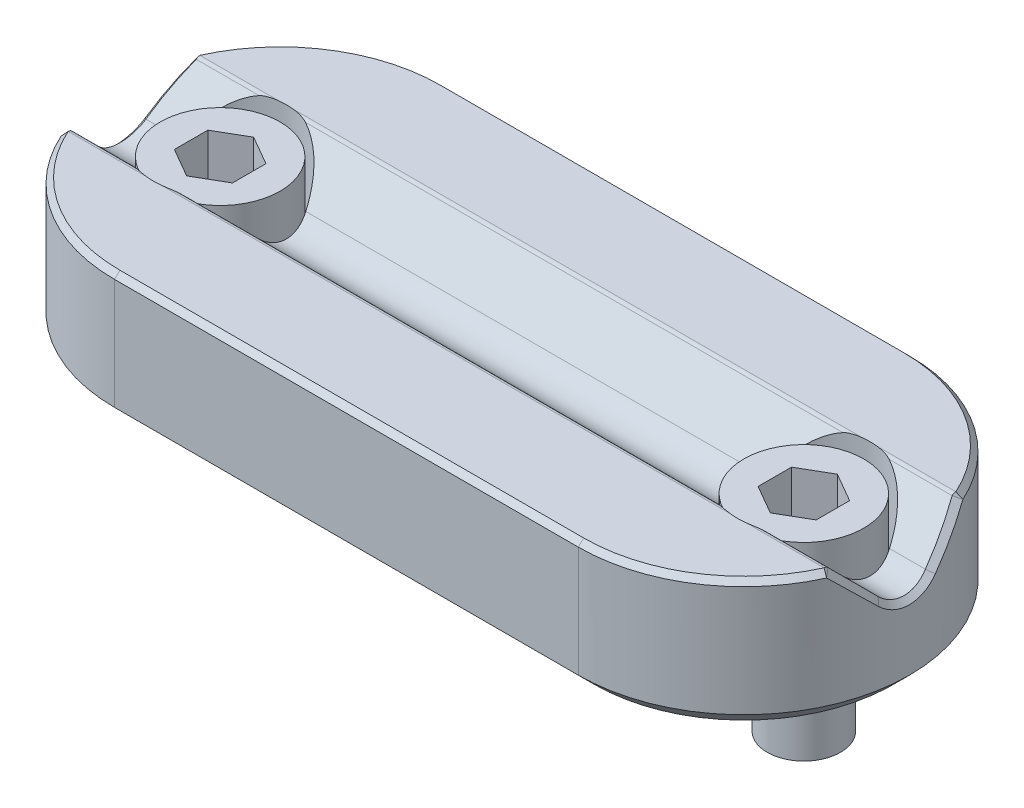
ISO-10303-21;
HEADER;
FILE_DESCRIPTION(('STEP AP214'),'2;1');
FILE_NAME('part.step','',(''),(''),'','','');
FILE_SCHEMA(('AUTOMOTIVE_DESIGN { 1 0 10303 214 1 1 1 1 }'));
ENDSEC;
DATA;
#1=APPLICATION_CONTEXT('core data for automotive mechanical design processes');
#2=APPLICATION_PROTOCOL_DEFINITION('international standard','automotive_design',2000,#1);
#3=PRODUCT_CONTEXT('',#1,'mechanical');
#4=PRODUCT('Part','Part','',(#3));
#5=PRODUCT_RELATED_PRODUCT_CATEGORY('part','',(#4));
#6=PRODUCT_DEFINITION_FORMATION('','',#4);
#7=PRODUCT_DEFINITION_CONTEXT('part definition',#1,'design');
#8=PRODUCT_DEFINITION('design','',#6,#7);
#9=PRODUCT_DEFINITION_SHAPE('','',#8);
#10=(LENGTH_UNIT() NAMED_UNIT(*) SI_UNIT(.MILLI.,.METRE.));
#11=(NAMED_UNIT(*) PLANE_ANGLE_UNIT() SI_UNIT($,.RADIAN.));
#12=(NAMED_UNIT(*) SI_UNIT($,.STERADIAN.) SOLID_ANGLE_UNIT());
#13=UNCERTAINTY_MEASURE_WITH_UNIT(LENGTH_MEASURE(1.E-05),#10,'distance_accuracy_value','');
#14=(GEOMETRIC_REPRESENTATION_CONTEXT(3) GLOBAL_UNCERTAINTY_ASSIGNED_CONTEXT((#13)) GLOBAL_UNIT_ASSIGNED_CONTEXT((#10,
#11,#12)) REPRESENTATION_CONTEXT('',''));
#15=CARTESIAN_POINT('',(0.,0.,0.));
#16=DIRECTION('',(0.,0.,1.));
#17=DIRECTION('',(1.,0.,0.));
#18=AXIS2_PLACEMENT_3D('',#15,#16,#17);
#19=CARTESIAN_POINT('',(13.97,-10.4394,0.));
#20=DIRECTION('',(0.,-1.,0.));
#21=DIRECTION('',(-1.,0.,0.));
#22=AXIS2_PLACEMENT_3D('',#19,#20,#21);
#23=PLANE('',#22);
#24=CARTESIAN_POINT('',(13.97,-10.4394,0.));
#25=DIRECTION('',(0.,1.,0.));
#26=DIRECTION('',(-1.,0.,0.));
#27=AXIS2_PLACEMENT_3D('',#24,#25,#26);
#28=CIRCLE('',#27,1.7526);
#29=CARTESIAN_POINT('',(12.2174,-10.4394,0.));
#30=VERTEX_POINT('',#29);
#31=EDGE_CURVE('E12',#30,#30,#28,.T.);
#32=ORIENTED_EDGE('',*,*,#31,.F.);
#33=EDGE_LOOP('',(#32));
#34=FACE_BOUND('',#33,.T.);
#35=ADVANCED_FACE('F49',(#34),#23,.T.);
#36=CARTESIAN_POINT('',(13.97,-10.4394,0.));
#37=DIRECTION('',(0.,-1.,0.));
#38=DIRECTION('',(-1.,0.,0.));
#39=AXIS2_PLACEMENT_3D('',#36,#37,#38);
#40=CYLINDRICAL_SURFACE('',#39,1.7526);
#41=CARTESIAN_POINT('',(13.97,-4.0894,0.));
#42=DIRECTION('',(0.,1.,0.));
#43=DIRECTION('',(-1.,0.,0.));
#44=AXIS2_PLACEMENT_3D('',#41,#42,#43);
#45=CIRCLE('',#44,1.7526);
#46=CARTESIAN_POINT('',(12.2174,-4.0894,0.));
#47=VERTEX_POINT('',#46);
#48=EDGE_CURVE('E56',#47,#47,#45,.T.);
#49=ORIENTED_EDGE('',*,*,#48,.F.);
#50=EDGE_LOOP('',(#49));
#51=FACE_BOUND('',#50,.T.);
#52=ORIENTED_EDGE('',*,*,#31,.T.);
#53=EDGE_LOOP('',(#52));
#54=FACE_BOUND('',#53,.T.);
#55=ADVANCED_FACE('F148',(#51,#54),#40,.T.);
#56=CARTESIAN_POINT('',(13.97,-4.0894,-1.75259999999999));
#57=DIRECTION('',(0.,-1.,0.));
#58=DIRECTION('',(-1.,0.,0.));
#59=AXIS2_PLACEMENT_3D('',#56,#57,#58);
#60=PLANE('',#59);
#61=CARTESIAN_POINT('',(13.97,-4.0894,0.));
#62=DIRECTION('',(0.,1.,0.));
#63=DIRECTION('',(-1.,0.,0.));
#64=AXIS2_PLACEMENT_3D('',#61,#62,#63);
#65=CIRCLE('',#64,2.8702);
#66=CARTESIAN_POINT('',(11.0998,-4.0894,0.));
#67=VERTEX_POINT('',#66);
#68=EDGE_CURVE('E141',#67,#67,#65,.T.);
#69=ORIENTED_EDGE('',*,*,#68,.F.);
#70=EDGE_LOOP('',(#69));
#71=FACE_BOUND('',#70,.T.);
#72=ORIENTED_EDGE('',*,*,#48,.T.);
#73=EDGE_LOOP('',(#72));
#74=FACE_BOUND('',#73,.T.);
#75=ADVANCED_FACE('F146',(#71,#74),#60,.T.);
#76=CARTESIAN_POINT('',(13.97,-10.4394,0.));
#77=DIRECTION('',(0.,-1.,0.));
#78=DIRECTION('',(-1.,0.,0.));
#79=AXIS2_PLACEMENT_3D('',#76,#77,#78);
#80=CYLINDRICAL_SURFACE('',#79,2.8702);
#81=CARTESIAN_POINT('',(13.97,-0.584199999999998,0.));
#82=DIRECTION('',(0.,1.,0.));
#83=DIRECTION('',(-1.,0.,0.));
#84=AXIS2_PLACEMENT_3D('',#81,#82,#83);
#85=CIRCLE('',#84,2.8702);
#86=CARTESIAN_POINT('',(11.0998,-0.584199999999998,0.));
#87=VERTEX_POINT('',#86);
#88=EDGE_CURVE('E138',#87,#87,#85,.T.);
#89=ORIENTED_EDGE('',*,*,#88,.F.);
#90=EDGE_LOOP('',(#89));
#91=FACE_BOUND('',#90,.T.);
#92=ORIENTED_EDGE('',*,*,#68,.T.);
#93=EDGE_LOOP('',(#92));
#94=FACE_BOUND('',#93,.T.);
#95=ADVANCED_FACE('F166',(#91,#94),#80,.T.);
#96=CARTESIAN_POINT('',(13.97,-0.584199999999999,-2.87019999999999));
#97=DIRECTION('',(0.,1.,0.));
#98=DIRECTION('',(1.,0.,0.));
#99=AXIS2_PLACEMENT_3D('',#96,#97,#98);
#100=PLANE('',#99);
#101=DIRECTION('',(-0.866025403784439,0.,-0.5));
#102=VECTOR('',#101,1.);
#103=CARTESIAN_POINT('',(13.97,-0.584199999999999,1.60395121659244));
#104=LINE('',#103,#102);
#105=CARTESIAN_POINT('',(13.97,-0.584199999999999,1.60395121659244));
#106=VERTEX_POINT('',#105);
#107=CARTESIAN_POINT('',(12.5809375,-0.584199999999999,0.801975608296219));
#108=VERTEX_POINT('',#107);
#109=EDGE_CURVE('E264',#106,#108,#104,.T.);
#110=ORIENTED_EDGE('',*,*,#109,.T.);
#111=DIRECTION('',(0.,0.,-1.));
#112=VECTOR('',#111,1.);
#113=CARTESIAN_POINT('',(12.5809375,-0.584199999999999,0.801975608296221));
#114=LINE('',#113,#112);
#115=CARTESIAN_POINT('',(12.5809375,-0.584199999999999,-0.801975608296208));
#116=VERTEX_POINT('',#115);
#117=EDGE_CURVE('E258',#108,#116,#114,.T.);
#118=ORIENTED_EDGE('',*,*,#117,.T.);
#119=DIRECTION('',(0.866025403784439,0.,-0.5));
#120=VECTOR('',#119,1.);
#121=CARTESIAN_POINT('',(12.5809375,-0.584199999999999,-0.801975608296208));
#122=LINE('',#121,#120);
#123=CARTESIAN_POINT('',(13.97,-0.584199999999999,-1.60395121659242));
#124=VERTEX_POINT('',#123);
#125=EDGE_CURVE('E263',#116,#124,#122,.T.);
#126=ORIENTED_EDGE('',*,*,#125,.T.);
#127=DIRECTION('',(0.866025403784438,0.,0.5));
#128=VECTOR('',#127,1.);
#129=CARTESIAN_POINT('',(13.97,-0.584199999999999,-1.60395121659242));
#130=LINE('',#129,#128);
#131=CARTESIAN_POINT('',(15.3590625,-0.584199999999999,-0.801975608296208));
#132=VERTEX_POINT('',#131);
#133=EDGE_CURVE('E272',#124,#132,#130,.T.);
#134=ORIENTED_EDGE('',*,*,#133,.T.);
#135=DIRECTION('',(0.,0.,1.));
#136=VECTOR('',#135,1.);
#137=CARTESIAN_POINT('',(15.3590625,-0.584199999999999,-0.801975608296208));
#138=LINE('',#137,#136);
#139=CARTESIAN_POINT('',(15.3590625,-0.584199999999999,0.801975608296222));
#140=VERTEX_POINT('',#139);
#141=EDGE_CURVE('E127',#132,#140,#138,.T.);
#142=ORIENTED_EDGE('',*,*,#141,.T.);
#143=DIRECTION('',(-0.866025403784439,0.,0.5));
#144=VECTOR('',#143,1.);
#145=CARTESIAN_POINT('',(15.3590625,-0.584199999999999,0.801975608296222));
#146=LINE('',#145,#144);
#147=EDGE_CURVE('E267',#140,#106,#146,.T.);
#148=ORIENTED_EDGE('',*,*,#147,.T.);
#149=EDGE_LOOP('',(#110,#118,#126,#134,#142,#148));
#150=FACE_BOUND('',#149,.T.);
#151=ORIENTED_EDGE('',*,*,#88,.T.);
#152=EDGE_LOOP('',(#151));
#153=FACE_BOUND('',#152,.T.);
#154=ADVANCED_FACE('F174',(#150,#153),#100,.T.);
#155=CARTESIAN_POINT('',(13.97,-3.1242,1.60395121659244));
#156=DIRECTION('',(-0.5,0.,0.866025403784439));
#157=DIRECTION('',(0.866025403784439,0.,0.5));
#158=AXIS2_PLACEMENT_3D('',#155,#156,#157);
#159=PLANE('',#158);
#160=ORIENTED_EDGE('',*,*,#109,.F.);
#161=DIRECTION('',(0.,1.,0.));
#162=VECTOR('',#161,1.);
#163=CARTESIAN_POINT('',(13.97,-3.1242,1.60395121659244));
#164=LINE('',#163,#162);
#165=CARTESIAN_POINT('',(13.97,-3.1242,1.60395121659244));
#166=VERTEX_POINT('',#165);
#167=EDGE_CURVE('E94',#166,#106,#164,.T.);
#168=ORIENTED_EDGE('',*,*,#167,.F.);
#169=DIRECTION('',(-0.866025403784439,0.,-0.5));
#170=VECTOR('',#169,1.);
#171=CARTESIAN_POINT('',(13.97,-3.1242,1.60395121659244));
#172=LINE('',#171,#170);
#173=CARTESIAN_POINT('',(12.5809375,-3.1242,0.801975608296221));
#174=VERTEX_POINT('',#173);
#175=EDGE_CURVE('E275',#166,#174,#172,.T.);
#176=ORIENTED_EDGE('',*,*,#175,.T.);
#177=DIRECTION('',(0.,1.,0.));
#178=VECTOR('',#177,1.);
#179=CARTESIAN_POINT('',(12.5809375,-3.1242,0.801975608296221));
#180=LINE('',#179,#178);
#181=EDGE_CURVE('E63',#174,#108,#180,.T.);
#182=ORIENTED_EDGE('',*,*,#181,.T.);
#183=EDGE_LOOP('',(#160,#168,#176,#182));
#184=FACE_BOUND('',#183,.T.);
#185=ADVANCED_FACE('F182',(#184),#159,.F.);
#186=CARTESIAN_POINT('',(15.3590625,-3.1242,0.801975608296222));
#187=DIRECTION('',(0.5,0.,0.866025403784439));
#188=DIRECTION('',(0.866025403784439,0.,-0.5));
#189=AXIS2_PLACEMENT_3D('',#186,#187,#188);
#190=PLANE('',#189);
#191=ORIENTED_EDGE('',*,*,#147,.F.);
#192=DIRECTION('',(0.,1.,0.));
#193=VECTOR('',#192,1.);
#194=CARTESIAN_POINT('',(15.3590625,-3.1242,0.801975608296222));
#195=LINE('',#194,#193);
#196=CARTESIAN_POINT('',(15.3590625,-3.1242,0.801975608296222));
#197=VERTEX_POINT('',#196);
#198=EDGE_CURVE('E129',#197,#140,#195,.T.);
#199=ORIENTED_EDGE('',*,*,#198,.F.);
#200=DIRECTION('',(-0.866025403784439,0.,0.5));
#201=VECTOR('',#200,1.);
#202=CARTESIAN_POINT('',(15.3590625,-3.1242,0.801975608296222));
#203=LINE('',#202,#201);
#204=EDGE_CURVE('E72',#197,#166,#203,.T.);
#205=ORIENTED_EDGE('',*,*,#204,.T.);
#206=ORIENTED_EDGE('',*,*,#167,.T.);
#207=EDGE_LOOP('',(#191,#199,#205,#206));
#208=FACE_BOUND('',#207,.T.);
#209=ADVANCED_FACE('F190',(#208),#190,.F.);
#210=CARTESIAN_POINT('',(15.3590625,-3.1242,-0.801975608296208));
#211=DIRECTION('',(1.,0.,0.));
#212=DIRECTION('',(0.,-1.,0.));
#213=AXIS2_PLACEMENT_3D('',#210,#211,#212);
#214=PLANE('',#213);
#215=ORIENTED_EDGE('',*,*,#141,.F.);
#216=DIRECTION('',(0.,1.,0.));
#217=VECTOR('',#216,1.);
#218=CARTESIAN_POINT('',(15.3590625,-3.1242,-0.801975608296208));
#219=LINE('',#218,#217);
#220=CARTESIAN_POINT('',(15.3590625,-3.1242,-0.801975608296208));
#221=VERTEX_POINT('',#220);
#222=EDGE_CURVE('E116',#221,#132,#219,.T.);
#223=ORIENTED_EDGE('',*,*,#222,.F.);
#224=DIRECTION('',(0.,0.,1.));
#225=VECTOR('',#224,1.);
#226=CARTESIAN_POINT('',(15.3590625,-3.1242,-0.801975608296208));
#227=LINE('',#226,#225);
#228=EDGE_CURVE('E119',#221,#197,#227,.T.);
#229=ORIENTED_EDGE('',*,*,#228,.T.);
#230=ORIENTED_EDGE('',*,*,#198,.T.);
#231=EDGE_LOOP('',(#215,#223,#229,#230));
#232=FACE_BOUND('',#231,.T.);
#233=ADVANCED_FACE('F125',(#232),#214,.F.);
#234=CARTESIAN_POINT('',(13.97,-3.1242,-1.60395121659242));
#235=DIRECTION('',(0.5,0.,-0.866025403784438));
#236=DIRECTION('',(-0.866025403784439,0.,-0.5));
#237=AXIS2_PLACEMENT_3D('',#234,#235,#236);
#238=PLANE('',#237);
#239=ORIENTED_EDGE('',*,*,#133,.F.);
#240=DIRECTION('',(0.,1.,0.));
#241=VECTOR('',#240,1.);
#242=CARTESIAN_POINT('',(13.97,-3.1242,-1.60395121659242));
#243=LINE('',#242,#241);
#244=CARTESIAN_POINT('',(13.97,-3.1242,-1.60395121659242));
#245=VERTEX_POINT('',#244);
#246=EDGE_CURVE('E118',#245,#124,#243,.T.);
#247=ORIENTED_EDGE('',*,*,#246,.F.);
#248=DIRECTION('',(0.866025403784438,0.,0.5));
#249=VECTOR('',#248,1.);
#250=CARTESIAN_POINT('',(13.97,-3.1242,-1.60395121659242));
#251=LINE('',#250,#249);
#252=EDGE_CURVE('E111',#245,#221,#251,.T.);
#253=ORIENTED_EDGE('',*,*,#252,.T.);
#254=ORIENTED_EDGE('',*,*,#222,.T.);
#255=EDGE_LOOP('',(#239,#247,#253,#254));
#256=FACE_BOUND('',#255,.T.);
#257=ADVANCED_FACE('F114',(#256),#238,.F.);
#258=CARTESIAN_POINT('',(12.5809375,-3.1242,-0.801975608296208));
#259=DIRECTION('',(-0.5,0.,-0.866025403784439));
#260=DIRECTION('',(-0.866025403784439,0.,0.5));
#261=AXIS2_PLACEMENT_3D('',#258,#259,#260);
#262=PLANE('',#261);
#263=ORIENTED_EDGE('',*,*,#125,.F.);
#264=DIRECTION('',(0.,1.,0.));
#265=VECTOR('',#264,1.);
#266=CARTESIAN_POINT('',(12.5809375,-3.1242,-0.801975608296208));
#267=LINE('',#266,#265);
#268=CARTESIAN_POINT('',(12.5809375,-3.1242,-0.801975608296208));
#269=VERTEX_POINT('',#268);
#270=EDGE_CURVE('E132',#269,#116,#267,.T.);
#271=ORIENTED_EDGE('',*,*,#270,.F.);
#272=DIRECTION('',(0.866025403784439,0.,-0.5));
#273=VECTOR('',#272,1.);
#274=CARTESIAN_POINT('',(12.5809375,-3.1242,-0.801975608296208));
#275=LINE('',#274,#273);
#276=EDGE_CURVE('E120',#269,#245,#275,.T.);
#277=ORIENTED_EDGE('',*,*,#276,.T.);
#278=ORIENTED_EDGE('',*,*,#246,.T.);
#279=EDGE_LOOP('',(#263,#271,#277,#278));
#280=FACE_BOUND('',#279,.T.);
#281=ADVANCED_FACE('F209',(#280),#262,.F.);
#282=CARTESIAN_POINT('',(12.5809375,-3.1242,0.801975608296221));
#283=DIRECTION('',(-1.,0.,0.));
#284=DIRECTION('',(0.,0.,1.));
#285=AXIS2_PLACEMENT_3D('',#282,#283,#284);
#286=PLANE('',#285);
#287=ORIENTED_EDGE('',*,*,#117,.F.);
#288=ORIENTED_EDGE('',*,*,#181,.F.);
#289=DIRECTION('',(0.,0.,-1.));
#290=VECTOR('',#289,1.);
#291=CARTESIAN_POINT('',(12.5809375,-3.1242,0.801975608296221));
#292=LINE('',#291,#290);
#293=EDGE_CURVE('E102',#174,#269,#292,.T.);
#294=ORIENTED_EDGE('',*,*,#293,.T.);
#295=ORIENTED_EDGE('',*,*,#270,.T.);
#296=EDGE_LOOP('',(#287,#288,#294,#295));
#297=FACE_BOUND('',#296,.T.);
#298=ADVANCED_FACE('F216',(#297),#286,.F.);
#299=CARTESIAN_POINT('',(13.97,-3.1242,1.60395121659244));
#300=DIRECTION('',(0.,-1.,0.));
#301=DIRECTION('',(-1.,0.,0.));
#302=AXIS2_PLACEMENT_3D('',#299,#300,#301);
#303=PLANE('',#302);
#304=ORIENTED_EDGE('',*,*,#175,.F.);
#305=ORIENTED_EDGE('',*,*,#204,.F.);
#306=ORIENTED_EDGE('',*,*,#228,.F.);
#307=ORIENTED_EDGE('',*,*,#252,.F.);
#308=ORIENTED_EDGE('',*,*,#276,.F.);
#309=ORIENTED_EDGE('',*,*,#293,.F.);
#310=EDGE_LOOP('',(#304,#305,#306,#307,#308,#309));
#311=FACE_BOUND('',#310,.T.);
#312=ADVANCED_FACE('F122',(#311),#303,.F.);
#313=CLOSED_SHELL('',(#35,#55,#75,#95,#154,#185,#209,#233,#257,#281,#298,#312));
#314=MANIFOLD_SOLID_BREP('B2',#313);
#315=CARTESIAN_POINT('',(-13.97,-10.4394,0.));
#316=DIRECTION('',(0.,-1.,0.));
#317=DIRECTION('',(1.,0.,0.));
#318=AXIS2_PLACEMENT_3D('',#315,#316,#317);
#319=PLANE('',#318);
#320=CARTESIAN_POINT('',(-13.97,-10.4394,0.));
#321=DIRECTION('',(0.,-1.,0.));
#322=DIRECTION('',(1.,0.,0.));
#323=AXIS2_PLACEMENT_3D('',#320,#321,#322);
#324=CIRCLE('',#323,1.7526);
#325=CARTESIAN_POINT('',(-12.2174,-10.4394,0.));
#326=VERTEX_POINT('',#325);
#327=EDGE_CURVE('E47',#326,#326,#324,.T.);
#328=ORIENTED_EDGE('',*,*,#327,.T.);
#329=EDGE_LOOP('',(#328));
#330=FACE_BOUND('',#329,.T.);
#331=ADVANCED_FACE('F294',(#330),#319,.T.);
#332=CARTESIAN_POINT('',(-13.97,-10.4394,0.));
#333=DIRECTION('',(0.,-1.,0.));
#334=DIRECTION('',(1.,0.,0.));
#335=AXIS2_PLACEMENT_3D('',#332,#333,#334);
#336=CYLINDRICAL_SURFACE('',#335,1.7526);
#337=CARTESIAN_POINT('',(-13.97,-4.0894,0.));
#338=DIRECTION('',(0.,-1.,0.));
#339=DIRECTION('',(1.,0.,0.));
#340=AXIS2_PLACEMENT_3D('',#337,#338,#339);
#341=CIRCLE('',#340,1.7526);
#342=CARTESIAN_POINT('',(-12.2174,-4.0894,0.));
#343=VERTEX_POINT('',#342);
#344=EDGE_CURVE('E301',#343,#343,#341,.T.);
#345=ORIENTED_EDGE('',*,*,#344,.T.);
#346=EDGE_LOOP('',(#345));
#347=FACE_BOUND('',#346,.T.);
#348=ORIENTED_EDGE('',*,*,#327,.F.);
#349=EDGE_LOOP('',(#348));
#350=FACE_BOUND('',#349,.T.);
#351=ADVANCED_FACE('F408',(#347,#350),#336,.T.);
#352=CARTESIAN_POINT('',(-13.97,-4.0894,-1.75259999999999));
#353=DIRECTION('',(0.,-1.,0.));
#354=DIRECTION('',(1.,0.,0.));
#355=AXIS2_PLACEMENT_3D('',#352,#353,#354);
#356=PLANE('',#355);
#357=CARTESIAN_POINT('',(-13.97,-4.0894,0.));
#358=DIRECTION('',(0.,-1.,0.));
#359=DIRECTION('',(1.,0.,0.));
#360=AXIS2_PLACEMENT_3D('',#357,#358,#359);
#361=CIRCLE('',#360,2.8702);
#362=CARTESIAN_POINT('',(-11.0998,-4.0894,0.));
#363=VERTEX_POINT('',#362);
#364=EDGE_CURVE('E403',#363,#363,#361,.T.);
#365=ORIENTED_EDGE('',*,*,#364,.T.);
#366=EDGE_LOOP('',(#365));
#367=FACE_BOUND('',#366,.T.);
#368=ORIENTED_EDGE('',*,*,#344,.F.);
#369=EDGE_LOOP('',(#368));
#370=FACE_BOUND('',#369,.T.);
#371=ADVANCED_FACE('F411',(#367,#370),#356,.T.);
#372=CARTESIAN_POINT('',(-13.97,-10.4394,0.));
#373=DIRECTION('',(0.,-1.,0.));
#374=DIRECTION('',(1.,0.,0.));
#375=AXIS2_PLACEMENT_3D('',#372,#373,#374);
#376=CYLINDRICAL_SURFACE('',#375,2.8702);
#377=CARTESIAN_POINT('',(-13.97,-0.584199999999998,0.));
#378=DIRECTION('',(0.,-1.,0.));
#379=DIRECTION('',(1.,0.,0.));
#380=AXIS2_PLACEMENT_3D('',#377,#378,#379);
#381=CIRCLE('',#380,2.8702);
#382=CARTESIAN_POINT('',(-11.0998,-0.584199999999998,0.));
#383=VERTEX_POINT('',#382);
#384=EDGE_CURVE('E395',#383,#383,#381,.T.);
#385=ORIENTED_EDGE('',*,*,#384,.T.);
#386=EDGE_LOOP('',(#385));
#387=FACE_BOUND('',#386,.T.);
#388=ORIENTED_EDGE('',*,*,#364,.F.);
#389=EDGE_LOOP('',(#388));
#390=FACE_BOUND('',#389,.T.);
#391=ADVANCED_FACE('F413',(#387,#390),#376,.T.);
#392=CARTESIAN_POINT('',(-13.97,-0.584199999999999,-2.87019999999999));
#393=DIRECTION('',(0.,1.,0.));
#394=DIRECTION('',(-1.,0.,0.));
#395=AXIS2_PLACEMENT_3D('',#392,#393,#394);
#396=PLANE('',#395);
#397=DIRECTION('',(0.866025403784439,0.,-0.5));
#398=VECTOR('',#397,1.);
#399=CARTESIAN_POINT('',(-13.97,-0.584199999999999,1.60395121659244));
#400=LINE('',#399,#398);
#401=CARTESIAN_POINT('',(-13.97,-0.584199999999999,1.60395121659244));
#402=VERTEX_POINT('',#401);
#403=CARTESIAN_POINT('',(-12.5809375,-0.584199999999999,0.801975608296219));
#404=VERTEX_POINT('',#403);
#405=EDGE_CURVE('E308',#402,#404,#400,.T.);
#406=ORIENTED_EDGE('',*,*,#405,.F.);
#407=DIRECTION('',(0.866025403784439,0.,0.5));
#408=VECTOR('',#407,1.);
#409=CARTESIAN_POINT('',(-15.3590625,-0.584199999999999,0.801975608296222));
#410=LINE('',#409,#408);
#411=CARTESIAN_POINT('',(-15.3590625,-0.584199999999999,0.801975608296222));
#412=VERTEX_POINT('',#411);
#413=EDGE_CURVE('E391',#412,#402,#410,.T.);
#414=ORIENTED_EDGE('',*,*,#413,.F.);
#415=DIRECTION('',(0.,0.,1.));
#416=VECTOR('',#415,1.);
#417=CARTESIAN_POINT('',(-15.3590625,-0.584199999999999,-0.801975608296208));
#418=LINE('',#417,#416);
#419=CARTESIAN_POINT('',(-15.3590625,-0.584199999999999,-0.801975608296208));
#420=VERTEX_POINT('',#419);
#421=EDGE_CURVE('E389',#420,#412,#418,.T.);
#422=ORIENTED_EDGE('',*,*,#421,.F.);
#423=DIRECTION('',(-0.866025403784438,0.,0.5));
#424=VECTOR('',#423,1.);
#425=CARTESIAN_POINT('',(-13.97,-0.584199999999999,-1.60395121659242));
#426=LINE('',#425,#424);
#427=CARTESIAN_POINT('',(-13.97,-0.584199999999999,-1.60395121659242));
#428=VERTEX_POINT('',#427);
#429=EDGE_CURVE('E356',#428,#420,#426,.T.);
#430=ORIENTED_EDGE('',*,*,#429,.F.);
#431=DIRECTION('',(-0.866025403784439,0.,-0.5));
#432=VECTOR('',#431,1.);
#433=CARTESIAN_POINT('',(-12.5809375,-0.584199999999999,-0.801975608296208));
#434=LINE('',#433,#432);
#435=CARTESIAN_POINT('',(-12.5809375,-0.584199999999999,-0.801975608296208));
#436=VERTEX_POINT('',#435);
#437=EDGE_CURVE('E385',#436,#428,#434,.T.);
#438=ORIENTED_EDGE('',*,*,#437,.F.);
#439=DIRECTION('',(0.,0.,-1.));
#440=VECTOR('',#439,1.);
#441=CARTESIAN_POINT('',(-12.5809375,-0.584199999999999,0.801975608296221));
#442=LINE('',#441,#440);
#443=EDGE_CURVE('E382',#404,#436,#442,.T.);
#444=ORIENTED_EDGE('',*,*,#443,.F.);
#445=EDGE_LOOP('',(#406,#414,#422,#430,#438,#444));
#446=FACE_BOUND('',#445,.T.);
#447=ORIENTED_EDGE('',*,*,#384,.F.);
#448=EDGE_LOOP('',(#447));
#449=FACE_BOUND('',#448,.T.);
#450=ADVANCED_FACE('F420',(#446,#449),#396,.T.);
#451=CARTESIAN_POINT('',(-13.97,-3.1242,1.60395121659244));
#452=DIRECTION('',(0.5,0.,0.866025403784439));
#453=DIRECTION('',(-0.866025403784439,0.,0.5));
#454=AXIS2_PLACEMENT_3D('',#451,#452,#453);
#455=PLANE('',#454);
#456=ORIENTED_EDGE('',*,*,#405,.T.);
#457=DIRECTION('',(0.,1.,0.));
#458=VECTOR('',#457,1.);
#459=CARTESIAN_POINT('',(-12.5809375,-3.1242,0.801975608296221));
#460=LINE('',#459,#458);
#461=CARTESIAN_POINT('',(-12.5809375,-3.1242,0.801975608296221));
#462=VERTEX_POINT('',#461);
#463=EDGE_CURVE('E338',#462,#404,#460,.T.);
#464=ORIENTED_EDGE('',*,*,#463,.F.);
#465=DIRECTION('',(0.866025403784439,0.,-0.5));
#466=VECTOR('',#465,1.);
#467=CARTESIAN_POINT('',(-13.97,-3.1242,1.60395121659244));
#468=LINE('',#467,#466);
#469=CARTESIAN_POINT('',(-13.97,-3.1242,1.60395121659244));
#470=VERTEX_POINT('',#469);
#471=EDGE_CURVE('E393',#470,#462,#468,.T.);
#472=ORIENTED_EDGE('',*,*,#471,.F.);
#473=DIRECTION('',(0.,1.,0.));
#474=VECTOR('',#473,1.);
#475=CARTESIAN_POINT('',(-13.97,-3.1242,1.60395121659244));
#476=LINE('',#475,#474);
#477=EDGE_CURVE('E316',#470,#402,#476,.T.);
#478=ORIENTED_EDGE('',*,*,#477,.T.);
#479=EDGE_LOOP('',(#456,#464,#472,#478));
#480=FACE_BOUND('',#479,.T.);
#481=ADVANCED_FACE('F451',(#480),#455,.F.);
#482=CARTESIAN_POINT('',(-15.3590625,-3.1242,0.801975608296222));
#483=DIRECTION('',(-0.5,0.,0.866025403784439));
#484=DIRECTION('',(-0.866025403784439,0.,-0.5));
#485=AXIS2_PLACEMENT_3D('',#482,#483,#484);
#486=PLANE('',#485);
#487=ORIENTED_EDGE('',*,*,#413,.T.);
#488=ORIENTED_EDGE('',*,*,#477,.F.);
#489=DIRECTION('',(0.866025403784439,0.,0.5));
#490=VECTOR('',#489,1.);
#491=CARTESIAN_POINT('',(-15.3590625,-3.1242,0.801975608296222));
#492=LINE('',#491,#490);
#493=CARTESIAN_POINT('',(-15.3590625,-3.1242,0.801975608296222));
#494=VERTEX_POINT('',#493);
#495=EDGE_CURVE('E368',#494,#470,#492,.T.);
#496=ORIENTED_EDGE('',*,*,#495,.F.);
#497=DIRECTION('',(0.,1.,0.));
#498=VECTOR('',#497,1.);
#499=CARTESIAN_POINT('',(-15.3590625,-3.1242,0.801975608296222));
#500=LINE('',#499,#498);
#501=EDGE_CURVE('E360',#494,#412,#500,.T.);
#502=ORIENTED_EDGE('',*,*,#501,.T.);
#503=EDGE_LOOP('',(#487,#488,#496,#502));
#504=FACE_BOUND('',#503,.T.);
#505=ADVANCED_FACE('F461',(#504),#486,.F.);
#506=CARTESIAN_POINT('',(-15.3590625,-3.1242,-0.801975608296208));
#507=DIRECTION('',(-1.,0.,0.));
#508=DIRECTION('',(0.,-1.,0.));
#509=AXIS2_PLACEMENT_3D('',#506,#507,#508);
#510=PLANE('',#509);
#511=ORIENTED_EDGE('',*,*,#421,.T.);
#512=ORIENTED_EDGE('',*,*,#501,.F.);
#513=DIRECTION('',(0.,0.,1.));
#514=VECTOR('',#513,1.);
#515=CARTESIAN_POINT('',(-15.3590625,-3.1242,-0.801975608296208));
#516=LINE('',#515,#514);
#517=CARTESIAN_POINT('',(-15.3590625,-3.1242,-0.801975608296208));
#518=VERTEX_POINT('',#517);
#519=EDGE_CURVE('E364',#518,#494,#516,.T.);
#520=ORIENTED_EDGE('',*,*,#519,.F.);
#521=DIRECTION('',(0.,1.,0.));
#522=VECTOR('',#521,1.);
#523=CARTESIAN_POINT('',(-15.3590625,-3.1242,-0.801975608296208));
#524=LINE('',#523,#522);
#525=EDGE_CURVE('E349',#518,#420,#524,.T.);
#526=ORIENTED_EDGE('',*,*,#525,.T.);
#527=EDGE_LOOP('',(#511,#512,#520,#526));
#528=FACE_BOUND('',#527,.T.);
#529=ADVANCED_FACE('F365',(#528),#510,.F.);
#530=CARTESIAN_POINT('',(-13.97,-3.1242,-1.60395121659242));
#531=DIRECTION('',(-0.5,0.,-0.866025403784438));
#532=DIRECTION('',(0.866025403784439,0.,-0.5));
#533=AXIS2_PLACEMENT_3D('',#530,#531,#532);
#534=PLANE('',#533);
#535=ORIENTED_EDGE('',*,*,#429,.T.);
#536=ORIENTED_EDGE('',*,*,#525,.F.);
#537=DIRECTION('',(-0.866025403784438,0.,0.5));
#538=VECTOR('',#537,1.);
#539=CARTESIAN_POINT('',(-13.97,-3.1242,-1.60395121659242));
#540=LINE('',#539,#538);
#541=CARTESIAN_POINT('',(-13.97,-3.1242,-1.60395121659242));
#542=VERTEX_POINT('',#541);
#543=EDGE_CURVE('E353',#542,#518,#540,.T.);
#544=ORIENTED_EDGE('',*,*,#543,.F.);
#545=DIRECTION('',(0.,1.,0.));
#546=VECTOR('',#545,1.);
#547=CARTESIAN_POINT('',(-13.97,-3.1242,-1.60395121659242));
#548=LINE('',#547,#546);
#549=EDGE_CURVE('E361',#542,#428,#548,.T.);
#550=ORIENTED_EDGE('',*,*,#549,.T.);
#551=EDGE_LOOP('',(#535,#536,#544,#550));
#552=FACE_BOUND('',#551,.T.);
#553=ADVANCED_FACE('F351',(#552),#534,.F.);
#554=CARTESIAN_POINT('',(-12.5809375,-3.1242,-0.801975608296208));
#555=DIRECTION('',(0.5,0.,-0.866025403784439));
#556=DIRECTION('',(0.866025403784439,0.,0.5));
#557=AXIS2_PLACEMENT_3D('',#554,#555,#556);
#558=PLANE('',#557);
#559=ORIENTED_EDGE('',*,*,#437,.T.);
#560=ORIENTED_EDGE('',*,*,#549,.F.);
#561=DIRECTION('',(-0.866025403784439,0.,-0.5));
#562=VECTOR('',#561,1.);
#563=CARTESIAN_POINT('',(-12.5809375,-3.1242,-0.801975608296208));
#564=LINE('',#563,#562);
#565=CARTESIAN_POINT('',(-12.5809375,-3.1242,-0.801975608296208));
#566=VERTEX_POINT('',#565);
#567=EDGE_CURVE('E374',#566,#542,#564,.T.);
#568=ORIENTED_EDGE('',*,*,#567,.F.);
#569=DIRECTION('',(0.,1.,0.));
#570=VECTOR('',#569,1.);
#571=CARTESIAN_POINT('',(-12.5809375,-3.1242,-0.801975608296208));
#572=LINE('',#571,#570);
#573=EDGE_CURVE('E398',#566,#436,#572,.T.);
#574=ORIENTED_EDGE('',*,*,#573,.T.);
#575=EDGE_LOOP('',(#559,#560,#568,#574));
#576=FACE_BOUND('',#575,.T.);
#577=ADVANCED_FACE('F488',(#576),#558,.F.);
#578=CARTESIAN_POINT('',(-12.5809375,-3.1242,0.801975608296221));
#579=DIRECTION('',(1.,0.,0.));
#580=DIRECTION('',(0.,0.,1.));
#581=AXIS2_PLACEMENT_3D('',#578,#579,#580);
#582=PLANE('',#581);
#583=ORIENTED_EDGE('',*,*,#443,.T.);
#584=ORIENTED_EDGE('',*,*,#573,.F.);
#585=DIRECTION('',(0.,0.,-1.));
#586=VECTOR('',#585,1.);
#587=CARTESIAN_POINT('',(-12.5809375,-3.1242,0.801975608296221));
#588=LINE('',#587,#586);
#589=EDGE_CURVE('E376',#462,#566,#588,.T.);
#590=ORIENTED_EDGE('',*,*,#589,.F.);
#591=ORIENTED_EDGE('',*,*,#463,.T.);
#592=EDGE_LOOP('',(#583,#584,#590,#591));
#593=FACE_BOUND('',#592,.T.);
#594=ADVANCED_FACE('F497',(#593),#582,.F.);
#595=CARTESIAN_POINT('',(-13.97,-3.1242,1.60395121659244));
#596=DIRECTION('',(0.,-1.,0.));
#597=DIRECTION('',(1.,0.,0.));
#598=AXIS2_PLACEMENT_3D('',#595,#596,#597);
#599=PLANE('',#598);
#600=ORIENTED_EDGE('',*,*,#471,.T.);
#601=ORIENTED_EDGE('',*,*,#589,.T.);
#602=ORIENTED_EDGE('',*,*,#567,.T.);
#603=ORIENTED_EDGE('',*,*,#543,.T.);
#604=ORIENTED_EDGE('',*,*,#519,.T.);
#605=ORIENTED_EDGE('',*,*,#495,.T.);
#606=EDGE_LOOP('',(#600,#601,#602,#603,#604,#605));
#607=FACE_BOUND('',#606,.T.);
#608=ADVANCED_FACE('F371',(#607),#599,.F.);
#609=CLOSED_SHELL('',(#331,#351,#371,#391,#450,#481,#505,#529,#553,#577,#594,#608));
#610=MANIFOLD_SOLID_BREP('B6',#609);
#611=CARTESIAN_POINT('',(-11.0998,-0.0254000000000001,0.));
#612=DIRECTION('',(0.,1.,0.));
#613=DIRECTION('',(0.,0.,1.));
#614=AXIS2_PLACEMENT_3D('',#611,#612,#613);
#615=PLANE('',#614);
#616=DIRECTION('',(1.,0.,0.));
#617=VECTOR('',#616,1.);
#618=CARTESIAN_POINT('',(18.4139893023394,-0.0254000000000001,-3.15563478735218));
#619=LINE('',#618,#617);
#620=CARTESIAN_POINT('',(14.3201343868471,-0.0254000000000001,-3.15563478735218));
#621=VERTEX_POINT('',#620);
#622=CARTESIAN_POINT('',(18.0914479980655,-0.0254000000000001,-3.15563478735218));
#623=VERTEX_POINT('',#622);
#624=EDGE_CURVE('E901',#621,#623,#619,.T.);
#625=ORIENTED_EDGE('',*,*,#624,.T.);
#626=CARTESIAN_POINT('',(11.0998,-0.0254000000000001,0.));
#627=DIRECTION('',(0.,1.,0.));
#628=DIRECTION('',(0.,0.,1.));
#629=AXIS2_PLACEMENT_3D('',#626,#627,#628);
#630=CIRCLE('',#629,7.6708);
#631=CARTESIAN_POINT('',(11.0998,-0.0254000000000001,-7.67080000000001));
#632=VERTEX_POINT('',#631);
#633=EDGE_CURVE('E1628',#623,#632,#630,.T.);
#634=ORIENTED_EDGE('',*,*,#633,.T.);
#635=DIRECTION('',(-1.,0.,0.));
#636=VECTOR('',#635,1.);
#637=CARTESIAN_POINT('',(-11.0998,-0.0254000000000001,-7.6708));
#638=LINE('',#637,#636);
#639=CARTESIAN_POINT('',(-11.0998,-0.0254000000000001,-7.6708));
#640=VERTEX_POINT('',#639);
#641=EDGE_CURVE('E902',#632,#640,#638,.T.);
#642=ORIENTED_EDGE('',*,*,#641,.T.);
#643=CARTESIAN_POINT('',(-11.0998,-0.0254000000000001,0.));
#644=DIRECTION('',(0.,1.,0.));
#645=DIRECTION('',(0.,0.,1.));
#646=AXIS2_PLACEMENT_3D('',#643,#644,#645);
#647=CIRCLE('',#646,7.6708);
#648=CARTESIAN_POINT('',(-18.0914479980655,-0.0254000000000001,-3.15563478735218));
#649=VERTEX_POINT('',#648);
#650=EDGE_CURVE('E1626',#640,#649,#647,.T.);
#651=ORIENTED_EDGE('',*,*,#650,.T.);
#652=DIRECTION('',(1.,0.,0.));
#653=VECTOR('',#652,1.);
#654=CARTESIAN_POINT('',(-14.8506447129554,-0.0254000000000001,-3.15563478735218));
#655=LINE('',#654,#653);
#656=CARTESIAN_POINT('',(-14.3201343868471,-0.0254000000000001,-3.15563478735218));
#657=VERTEX_POINT('',#656);
#658=EDGE_CURVE('E892',#649,#657,#655,.T.);
#659=ORIENTED_EDGE('',*,*,#658,.T.);
#660=CARTESIAN_POINT('',(-13.97,-0.0254000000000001,0.));
#661=DIRECTION('',(0.,1.,0.));
#662=DIRECTION('',(0.,0.,1.));
#663=AXIS2_PLACEMENT_3D('',#660,#661,#662);
#664=CIRCLE('',#663,3.175);
#665=CARTESIAN_POINT('',(-13.6198656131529,-0.0254000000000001,-3.15563478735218));
#666=VERTEX_POINT('',#665);
#667=EDGE_CURVE('E1735',#666,#657,#664,.T.);
#668=ORIENTED_EDGE('',*,*,#667,.F.);
#669=DIRECTION('',(1.,0.,0.));
#670=VECTOR('',#669,1.);
#671=CARTESIAN_POINT('',(13.0893552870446,-0.0254000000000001,-3.15563478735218));
#672=LINE('',#671,#670);
#673=CARTESIAN_POINT('',(13.6198656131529,-0.0254000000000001,-3.15563478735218));
#674=VERTEX_POINT('',#673);
#675=EDGE_CURVE('E1770',#666,#674,#672,.T.);
#676=ORIENTED_EDGE('',*,*,#675,.T.);
#677=CARTESIAN_POINT('',(13.97,-0.0254000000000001,0.));
#678=DIRECTION('',(0.,1.,0.));
#679=DIRECTION('',(0.,0.,1.));
#680=AXIS2_PLACEMENT_3D('',#677,#678,#679);
#681=CIRCLE('',#680,3.175);
#682=EDGE_CURVE('E1727',#621,#674,#681,.T.);
#683=ORIENTED_EDGE('',*,*,#682,.F.);
#684=EDGE_LOOP('',(#625,#634,#642,#651,#659,#668,#676,#683));
#685=FACE_BOUND('',#684,.T.);
#686=ADVANCED_FACE('F530',(#685),#615,.T.);
#687=CARTESIAN_POINT('',(-13.97,-0.0254000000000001,0.));
#688=DIRECTION('',(0.,-1.,0.));
#689=DIRECTION('',(0.,0.,-1.));
#690=AXIS2_PLACEMENT_3D('',#687,#688,#689);
#691=CYLINDRICAL_SURFACE('',#690,2.032);
#692=CARTESIAN_POINT('',(-13.97,-6.35,0.));
#693=DIRECTION('',(0.,1.,0.));
#694=DIRECTION('',(0.,0.,1.));
#695=AXIS2_PLACEMENT_3D('',#692,#693,#694);
#696=CIRCLE('',#695,2.032);
#697=CARTESIAN_POINT('',(-13.97,-6.35,2.032));
#698=VERTEX_POINT('',#697);
#699=EDGE_CURVE('E1702',#698,#698,#696,.T.);
#700=ORIENTED_EDGE('',*,*,#699,.F.);
#701=EDGE_LOOP('',(#700));
#702=FACE_BOUND('',#701,.T.);
#703=CARTESIAN_POINT('',(-13.97,-4.0894,0.));
#704=DIRECTION('',(0.,1.,0.));
#705=DIRECTION('',(0.,0.,1.));
#706=AXIS2_PLACEMENT_3D('',#703,#704,#705);
#707=CIRCLE('',#706,2.032);
#708=CARTESIAN_POINT('',(-13.97,-4.0894,2.032));
#709=VERTEX_POINT('',#708);
#710=EDGE_CURVE('E1715',#709,#709,#707,.T.);
#711=ORIENTED_EDGE('',*,*,#710,.T.);
#712=EDGE_LOOP('',(#711));
#713=FACE_BOUND('',#712,.T.);
#714=ADVANCED_FACE('F1598',(#702,#713),#691,.F.);
#715=CARTESIAN_POINT('',(13.97,-0.0254000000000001,0.));
#716=DIRECTION('',(0.,-1.,0.));
#717=DIRECTION('',(0.,0.,-1.));
#718=AXIS2_PLACEMENT_3D('',#715,#716,#717);
#719=CYLINDRICAL_SURFACE('',#718,2.03200000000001);
#720=CARTESIAN_POINT('',(13.97,-6.35,0.));
#721=DIRECTION('',(0.,1.,0.));
#722=DIRECTION('',(0.,0.,1.));
#723=AXIS2_PLACEMENT_3D('',#720,#721,#722);
#724=CIRCLE('',#723,2.03200000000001);
#725=CARTESIAN_POINT('',(13.97,-6.35,2.03200000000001));
#726=VERTEX_POINT('',#725);
#727=EDGE_CURVE('E1707',#726,#726,#724,.T.);
#728=ORIENTED_EDGE('',*,*,#727,.F.);
#729=EDGE_LOOP('',(#728));
#730=FACE_BOUND('',#729,.T.);
#731=CARTESIAN_POINT('',(13.97,-4.0894,0.));
#732=DIRECTION('',(0.,1.,0.));
#733=DIRECTION('',(0.,0.,1.));
#734=AXIS2_PLACEMENT_3D('',#731,#732,#733);
#735=CIRCLE('',#734,2.03200000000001);
#736=CARTESIAN_POINT('',(13.97,-4.0894,2.03200000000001));
#737=VERTEX_POINT('',#736);
#738=EDGE_CURVE('E1713',#737,#737,#735,.T.);
#739=ORIENTED_EDGE('',*,*,#738,.T.);
#740=EDGE_LOOP('',(#739));
#741=FACE_BOUND('',#740,.T.);
#742=ADVANCED_FACE('F855',(#730,#741),#719,.F.);
#743=DIRECTION('',(1.,0.,0.));
#744=VECTOR('',#743,1.);
#745=CARTESIAN_POINT('',(11.0998,-0.0254000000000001,7.6708));
#746=LINE('',#745,#744);
#747=CARTESIAN_POINT('',(-11.0998,-0.0254000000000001,7.6708));
#748=VERTEX_POINT('',#747);
#749=CARTESIAN_POINT('',(11.0998,-0.0254000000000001,7.6708));
#750=VERTEX_POINT('',#749);
#751=EDGE_CURVE('E1452',#748,#750,#746,.T.);
#752=ORIENTED_EDGE('',*,*,#751,.T.);
#753=CARTESIAN_POINT('',(11.0998,-0.0254000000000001,0.));
#754=DIRECTION('',(0.,1.,0.));
#755=DIRECTION('',(0.,0.,1.));
#756=AXIS2_PLACEMENT_3D('',#753,#754,#755);
#757=CIRCLE('',#756,7.6708);
#758=CARTESIAN_POINT('',(18.0914479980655,-0.0254000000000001,3.15563478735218));
#759=VERTEX_POINT('',#758);
#760=EDGE_CURVE('E1434',#750,#759,#757,.T.);
#761=ORIENTED_EDGE('',*,*,#760,.T.);
#762=DIRECTION('',(1.,0.,0.));
#763=VECTOR('',#762,1.);
#764=CARTESIAN_POINT('',(14.8506447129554,-0.0254000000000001,3.15563478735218));
#765=LINE('',#764,#763);
#766=CARTESIAN_POINT('',(14.3201343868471,-0.0254000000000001,3.15563478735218));
#767=VERTEX_POINT('',#766);
#768=EDGE_CURVE('E1445',#759,#767,#765,.F.);
#769=ORIENTED_EDGE('',*,*,#768,.T.);
#770=CARTESIAN_POINT('',(13.6198656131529,-0.0254000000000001,3.15563478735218));
#771=VERTEX_POINT('',#770);
#772=EDGE_CURVE('E1724',#771,#767,#681,.T.);
#773=ORIENTED_EDGE('',*,*,#772,.F.);
#774=DIRECTION('',(1.,0.,0.));
#775=VECTOR('',#774,1.);
#776=CARTESIAN_POINT('',(-13.0893552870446,-0.0254000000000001,3.15563478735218));
#777=LINE('',#776,#775);
#778=CARTESIAN_POINT('',(-13.6198656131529,-0.0254000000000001,3.15563478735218));
#779=VERTEX_POINT('',#778);
#780=EDGE_CURVE('E1440',#771,#779,#777,.F.);
#781=ORIENTED_EDGE('',*,*,#780,.T.);
#782=CARTESIAN_POINT('',(-14.3201343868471,-0.0254000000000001,3.15563478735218));
#783=VERTEX_POINT('',#782);
#784=EDGE_CURVE('E1732',#783,#779,#664,.T.);
#785=ORIENTED_EDGE('',*,*,#784,.F.);
#786=DIRECTION('',(1.,0.,0.));
#787=VECTOR('',#786,1.);
#788=CARTESIAN_POINT('',(-18.4139893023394,-0.0254000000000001,3.15563478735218));
#789=LINE('',#788,#787);
#790=CARTESIAN_POINT('',(-18.0914479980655,-0.0254000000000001,3.15563478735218));
#791=VERTEX_POINT('',#790);
#792=EDGE_CURVE('E825',#783,#791,#789,.F.);
#793=ORIENTED_EDGE('',*,*,#792,.T.);
#794=CARTESIAN_POINT('',(-11.0998,-0.0254000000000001,0.));
#795=DIRECTION('',(0.,1.,0.));
#796=DIRECTION('',(0.,0.,1.));
#797=AXIS2_PLACEMENT_3D('',#794,#795,#796);
#798=CIRCLE('',#797,7.6708);
#799=EDGE_CURVE('E1450',#791,#748,#798,.T.);
#800=ORIENTED_EDGE('',*,*,#799,.T.);
#801=EDGE_LOOP('',(#752,#761,#769,#773,#781,#785,#793,#800));
#802=FACE_BOUND('',#801,.T.);
#803=ADVANCED_FACE('F1601',(#802),#615,.T.);
#804=CARTESIAN_POINT('',(-11.0998,-6.35,0.));
#805=DIRECTION('',(0.,1.,0.));
#806=DIRECTION('',(0.,0.,1.));
#807=AXIS2_PLACEMENT_3D('',#804,#805,#806);
#808=PLANE('',#807);
#809=DIRECTION('',(-1.,0.,0.));
#810=VECTOR('',#809,1.);
#811=CARTESIAN_POINT('',(-11.0998,-6.35,7.1628));
#812=LINE('',#811,#810);
#813=CARTESIAN_POINT('',(11.0998,-6.35,7.16280000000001));
#814=VERTEX_POINT('',#813);
#815=CARTESIAN_POINT('',(-11.0998,-6.35,7.1628));
#816=VERTEX_POINT('',#815);
#817=EDGE_CURVE('E1102',#814,#816,#812,.T.);
#818=ORIENTED_EDGE('',*,*,#817,.T.);
#819=CARTESIAN_POINT('',(-11.0998,-6.35,0.));
#820=DIRECTION('',(0.,1.,0.));
#821=DIRECTION('',(0.,0.,1.));
#822=AXIS2_PLACEMENT_3D('',#819,#820,#821);
#823=CIRCLE('',#822,7.1628);
#824=CARTESIAN_POINT('',(-11.0998,-6.35,-7.1628));
#825=VERTEX_POINT('',#824);
#826=EDGE_CURVE('E1104',#816,#825,#823,.F.);
#827=ORIENTED_EDGE('',*,*,#826,.T.);
#828=DIRECTION('',(1.,0.,0.));
#829=VECTOR('',#828,1.);
#830=CARTESIAN_POINT('',(-11.0998,-6.35,-7.1628));
#831=LINE('',#830,#829);
#832=CARTESIAN_POINT('',(11.0998,-6.35,-7.1628));
#833=VERTEX_POINT('',#832);
#834=EDGE_CURVE('E1100',#825,#833,#831,.T.);
#835=ORIENTED_EDGE('',*,*,#834,.T.);
#836=CARTESIAN_POINT('',(11.0998,-6.35,0.));
#837=DIRECTION('',(0.,1.,0.));
#838=DIRECTION('',(0.,0.,1.));
#839=AXIS2_PLACEMENT_3D('',#836,#837,#838);
#840=CIRCLE('',#839,7.1628);
#841=EDGE_CURVE('E1097',#833,#814,#840,.F.);
#842=ORIENTED_EDGE('',*,*,#841,.T.);
#843=EDGE_LOOP('',(#818,#827,#835,#842));
#844=FACE_BOUND('',#843,.T.);
#845=ORIENTED_EDGE('',*,*,#699,.T.);
#846=EDGE_LOOP('',(#845));
#847=FACE_BOUND('',#846,.T.);
#848=ORIENTED_EDGE('',*,*,#727,.T.);
#849=EDGE_LOOP('',(#848));
#850=FACE_BOUND('',#849,.T.);
#851=ADVANCED_FACE('F971',(#844,#847,#850),#808,.F.);
#852=CARTESIAN_POINT('',(-11.0998,-0.0254000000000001,0.));
#853=DIRECTION('',(0.,-1.,0.));
#854=DIRECTION('',(0.,0.,-1.));
#855=AXIS2_PLACEMENT_3D('',#852,#853,#854);
#856=CYLINDRICAL_SURFACE('',#855,7.9248);
#857=DIRECTION('',(0.,-1.,0.));
#858=VECTOR('',#857,1.);
#859=CARTESIAN_POINT('',(-11.0998,-0.0254000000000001,-7.9248));
#860=LINE('',#859,#858);
#861=CARTESIAN_POINT('',(-11.0998,-0.279399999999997,-7.9248));
#862=VERTEX_POINT('',#861);
#863=CARTESIAN_POINT('',(-11.0998,-5.58800000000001,-7.9248));
#864=VERTEX_POINT('',#863);
#865=EDGE_CURVE('E1698',#862,#864,#860,.T.);
#866=ORIENTED_EDGE('',*,*,#865,.T.);
#867=CARTESIAN_POINT('',(-11.0998,-5.58800000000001,0.));
#868=DIRECTION('',(0.,1.,0.));
#869=DIRECTION('',(0.,0.,1.));
#870=AXIS2_PLACEMENT_3D('',#867,#868,#869);
#871=CIRCLE('',#870,7.9248);
#872=CARTESIAN_POINT('',(-11.0998,-5.58800000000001,7.9248));
#873=VERTEX_POINT('',#872);
#874=EDGE_CURVE('E1089',#864,#873,#871,.T.);
#875=ORIENTED_EDGE('',*,*,#874,.T.);
#876=DIRECTION('',(0.,-1.,0.));
#877=VECTOR('',#876,1.);
#878=CARTESIAN_POINT('',(-11.0998,-0.0254000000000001,7.9248));
#879=LINE('',#878,#877);
#880=CARTESIAN_POINT('',(-11.0998,-0.279399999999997,7.9248));
#881=VERTEX_POINT('',#880);
#882=EDGE_CURVE('E751',#881,#873,#879,.T.);
#883=ORIENTED_EDGE('',*,*,#882,.F.);
#884=CARTESIAN_POINT('',(-11.0998,-0.279399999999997,0.));
#885=DIRECTION('',(0.,1.,0.));
#886=DIRECTION('',(0.,0.,1.));
#887=AXIS2_PLACEMENT_3D('',#884,#885,#886);
#888=CIRCLE('',#887,7.9248);
#889=CARTESIAN_POINT('',(-18.3229595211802,-0.2794,3.26012600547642));
#890=VERTEX_POINT('',#889);
#891=EDGE_CURVE('E998',#881,#890,#888,.F.);
#892=ORIENTED_EDGE('',*,*,#891,.T.);
#893=CARTESIAN_POINT('',(-18.9079815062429,-2.12391739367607,1.35453187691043));
#894=CARTESIAN_POINT('',(-18.8510509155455,-1.80622644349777,1.68274239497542));
#895=CARTESIAN_POINT('',(-18.7733877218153,-1.49201913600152,2.00735391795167));
#896=CARTESIAN_POINT('',(-18.5778624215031,-0.875546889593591,2.64423915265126));
#897=CARTESIAN_POINT('',(-18.4600012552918,-0.573284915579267,2.95650980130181));
#898=CARTESIAN_POINT('',(-18.3229595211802,-0.2794,3.26012600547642));
#899=B_SPLINE_CURVE_WITH_KNOTS('',3,(#893,#894,#895,#896,#897,#898),.UNSPECIFIED.,.F.,.F.,(4,2,
4),(4.28841837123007,4.41452040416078,4.54062243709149),.UNSPECIFIED.);
#900=CARTESIAN_POINT('',(-18.9079815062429,-2.12391739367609,1.35453187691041));
#901=VERTEX_POINT('',#900);
#902=EDGE_CURVE('E990',#890,#901,#899,.F.);
#903=ORIENTED_EDGE('',*,*,#902,.T.);
#904=CARTESIAN_POINT('',(-18.9079815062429,-2.12391739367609,-1.35453187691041));
#905=CARTESIAN_POINT('',(-18.9157090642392,-2.1670332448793,-1.30998590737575));
#906=CARTESIAN_POINT('',(-18.9233799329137,-2.20778182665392,-1.26350718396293));
#907=CARTESIAN_POINT('',(-18.9383959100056,-2.28464384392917,-1.1667331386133));
#908=CARTESIAN_POINT('',(-18.9457424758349,-2.32076216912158,-1.11642610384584));
#909=CARTESIAN_POINT('',(-18.9563584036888,-2.3714263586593,-1.03809683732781));
#910=CARTESIAN_POINT('',(-18.9598353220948,-2.38775243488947,-1.01145593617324));
#911=CARTESIAN_POINT('',(-18.9666073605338,-2.41911870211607,-0.957360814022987));
#912=CARTESIAN_POINT('',(-18.9698860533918,-2.43408387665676,-0.930039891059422));
#913=CARTESIAN_POINT('',(-18.9762205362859,-2.46265330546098,-0.874773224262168));
#914=CARTESIAN_POINT('',(-18.9792745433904,-2.47624927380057,-0.846841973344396));
#915=CARTESIAN_POINT('',(-18.9851374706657,-2.50207841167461,-0.790388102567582));
#916=CARTESIAN_POINT('',(-18.9879464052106,-2.51431156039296,-0.761865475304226));
#917=CARTESIAN_POINT('',(-18.993300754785,-2.53741943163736,-0.704229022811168));
#918=CARTESIAN_POINT('',(-18.9958461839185,-2.54829415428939,-0.675115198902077));
#919=CARTESIAN_POINT('',(-19.0006549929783,-2.56867949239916,-0.616292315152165));
#920=CARTESIAN_POINT('',(-19.002918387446,-2.57819012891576,-0.586583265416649));
#921=CARTESIAN_POINT('',(-19.00714424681,-2.59583137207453,-0.526561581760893));
#922=CARTESIAN_POINT('',(-19.0091071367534,-2.60396367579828,-0.496238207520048));
#923=CARTESIAN_POINT('',(-19.0127108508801,-2.61881490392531,-0.435017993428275));
#924=CARTESIAN_POINT('',(-19.0143564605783,-2.62555320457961,-0.403999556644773));
#925=CARTESIAN_POINT('',(-19.0172746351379,-2.63745348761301,-0.342064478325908));
#926=CARTESIAN_POINT('',(-19.018555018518,-2.64264786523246,-0.311031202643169));
#927=CARTESIAN_POINT('',(-19.0207514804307,-2.65153328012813,-0.248895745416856));
#928=CARTESIAN_POINT('',(-19.0216682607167,-2.65522713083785,-0.217783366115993));
#929=CARTESIAN_POINT('',(-19.0238700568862,-2.66408382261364,-0.124313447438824));
#930=CARTESIAN_POINT('',(-19.0246066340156,-2.66702665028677,-0.0618234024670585));
#931=CARTESIAN_POINT('',(-19.0245966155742,-2.66698640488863,0.032177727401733));
#932=CARTESIAN_POINT('',(-19.0244074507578,-2.66622938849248,0.06355584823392));
#933=CARTESIAN_POINT('',(-19.0236541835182,-2.66320950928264,0.126402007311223));
#934=CARTESIAN_POINT('',(-19.0230901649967,-2.66094705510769,0.157862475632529));
#935=CARTESIAN_POINT('',(-19.0219600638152,-2.65640071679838,0.20514460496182));
#936=CARTESIAN_POINT('',(-19.0215354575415,-2.65469080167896,0.220929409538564));
#937=CARTESIAN_POINT('',(-19.0205968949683,-2.65090510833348,0.252345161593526));
#938=CARTESIAN_POINT('',(-19.0200823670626,-2.64882703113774,0.26800455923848));
#939=CARTESIAN_POINT('',(-19.0184072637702,-2.64204886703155,0.314779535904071));
#940=CARTESIAN_POINT('',(-19.0171137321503,-2.63679930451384,0.345755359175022));
#941=CARTESIAN_POINT('',(-19.0127282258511,-2.61890896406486,0.437955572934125));
#942=CARTESIAN_POINT('',(-19.0091290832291,-2.60412195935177,0.498548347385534));
#943=CARTESIAN_POINT('',(-19.0028048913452,-2.57771387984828,0.588102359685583));
#944=CARTESIAN_POINT('',(-19.0005424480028,-2.56820510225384,0.617733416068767));
#945=CARTESIAN_POINT('',(-18.9957230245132,-2.54776921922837,0.67655407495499));
#946=CARTESIAN_POINT('',(-18.993166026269,-2.53684217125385,0.705743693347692));
#947=CARTESIAN_POINT('',(-18.9877717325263,-2.51355328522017,0.763677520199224));
#948=CARTESIAN_POINT('',(-18.9849362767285,-2.50119959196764,0.792403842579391));
#949=CARTESIAN_POINT('',(-18.9789922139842,-2.47499728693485,0.849475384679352));
#950=CARTESIAN_POINT('',(-18.9759035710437,-2.4612358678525,0.877627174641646));
#951=CARTESIAN_POINT('',(-18.9663669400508,-2.41818600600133,0.960552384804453));
#952=CARTESIAN_POINT('',(-18.9596282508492,-2.38705111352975,1.01403921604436));
#953=CARTESIAN_POINT('',(-18.9455976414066,-2.32005089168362,1.11742401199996));
#954=CARTESIAN_POINT('',(-18.9383040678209,-2.28418112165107,1.16733965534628));
#955=CARTESIAN_POINT('',(-18.923359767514,-2.20767116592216,1.26362241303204));
#956=CARTESIAN_POINT('',(-18.9157085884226,-2.16703024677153,1.30998892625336));
#957=CARTESIAN_POINT('',(-18.9079815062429,-2.12391739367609,1.35453187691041));
#958=B_SPLINE_CURVE_WITH_KNOTS('',3,(#904,#905,#906,#907,#908,#909,#910,#911,#912,#913,#914,
#915,#916,#917,#918,#919,#920,#921,#922,#923,#924,#925,#926,#927,#928,#929,#930,#931,#932,#933,
#934,#935,#936,#937,#938,#939,#940,#941,#942,#943,#944,#945,#946,#947,#948,#949,#950,#951,#952,
#953,#954,#955,#956,#957),.UNSPECIFIED.,.F.,.F.,(4,2,2,2,2,2,2,2,2,2,2,2,2,2,2,2,2,2,2,2,2,2,2,
2,2,2,4),(0.,0.000181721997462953,0.000363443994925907,0.000454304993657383,0.00054516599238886,
0.000636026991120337,0.000726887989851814,0.00081774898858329,0.000908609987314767,
0.000999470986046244,0.00109033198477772,0.0011811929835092,0.00127205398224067,
0.00145377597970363,0.0015446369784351,0.00163549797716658,0.00168092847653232,
0.00172635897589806,0.00181721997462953,0.00199894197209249,0.00208980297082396,
0.00218066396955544,0.00227152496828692,0.00236238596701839,0.00254410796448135,
0.0027258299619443,0.00290755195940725),.UNSPECIFIED.);
#959=CARTESIAN_POINT('',(-18.9079815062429,-2.12391739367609,-1.35453187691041));
#960=VERTEX_POINT('',#959);
#961=EDGE_CURVE('E994',#901,#960,#958,.F.);
#962=ORIENTED_EDGE('',*,*,#961,.T.);
#963=CARTESIAN_POINT('',(-18.3229595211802,-0.279399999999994,-3.26012600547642));
#964=CARTESIAN_POINT('',(-18.4600012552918,-0.573284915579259,-2.95650980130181));
#965=CARTESIAN_POINT('',(-18.5778624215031,-0.875546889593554,-2.64423915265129));
#966=CARTESIAN_POINT('',(-18.7733877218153,-1.49201913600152,-2.00735391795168));
#967=CARTESIAN_POINT('',(-18.8510509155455,-1.80622644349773,-1.68274239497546));
#968=CARTESIAN_POINT('',(-18.9079815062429,-2.12391739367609,-1.35453187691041));
#969=B_SPLINE_CURVE_WITH_KNOTS('',3,(#963,#964,#965,#966,#967,#968),.UNSPECIFIED.,.F.,.F.,(4,2,
4),(1.7425628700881,1.86866490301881,1.99476693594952),.UNSPECIFIED.);
#970=CARTESIAN_POINT('',(-18.3229595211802,-0.279399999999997,-3.26012600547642));
#971=VERTEX_POINT('',#970);
#972=EDGE_CURVE('E954',#960,#971,#969,.F.);
#973=ORIENTED_EDGE('',*,*,#972,.T.);
#974=CARTESIAN_POINT('',(-11.0998,-0.279399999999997,0.));
#975=DIRECTION('',(0.,1.,0.));
#976=DIRECTION('',(0.,0.,1.));
#977=AXIS2_PLACEMENT_3D('',#974,#975,#976);
#978=CIRCLE('',#977,7.9248);
#979=EDGE_CURVE('E959',#971,#862,#978,.F.);
#980=ORIENTED_EDGE('',*,*,#979,.T.);
#981=EDGE_LOOP('',(#866,#875,#883,#892,#903,#962,#973,#980));
#982=FACE_BOUND('',#981,.T.);
#983=ADVANCED_FACE('F961',(#982),#856,.T.);
#984=CARTESIAN_POINT('',(-11.0998,-0.0254000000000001,7.9248));
#985=DIRECTION('',(0.,0.,-1.));
#986=DIRECTION('',(-1.,0.,0.));
#987=AXIS2_PLACEMENT_3D('',#984,#985,#986);
#988=PLANE('',#987);
#989=ORIENTED_EDGE('',*,*,#882,.T.);
#990=DIRECTION('',(1.,0.,0.));
#991=VECTOR('',#990,1.);
#992=CARTESIAN_POINT('',(-11.0998,-5.58800000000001,7.9248));
#993=LINE('',#992,#991);
#994=CARTESIAN_POINT('',(11.0998,-5.58800000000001,7.9248));
#995=VERTEX_POINT('',#994);
#996=EDGE_CURVE('E553',#873,#995,#993,.T.);
#997=ORIENTED_EDGE('',*,*,#996,.T.);
#998=DIRECTION('',(0.,-1.,0.));
#999=VECTOR('',#998,1.);
#1000=CARTESIAN_POINT('',(11.0998,-0.0254000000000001,7.9248));
#1001=LINE('',#1000,#999);
#1002=CARTESIAN_POINT('',(11.0998,-0.279399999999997,7.9248));
#1003=VERTEX_POINT('',#1002);
#1004=EDGE_CURVE('E1704',#1003,#995,#1001,.T.);
#1005=ORIENTED_EDGE('',*,*,#1004,.F.);
#1006=DIRECTION('',(-1.,0.,0.));
#1007=VECTOR('',#1006,1.);
#1008=CARTESIAN_POINT('',(-11.0998,-0.279399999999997,7.9248));
#1009=LINE('',#1008,#1007);
#1010=EDGE_CURVE('E1430',#1003,#881,#1009,.T.);
#1011=ORIENTED_EDGE('',*,*,#1010,.T.);
#1012=EDGE_LOOP('',(#989,#997,#1005,#1011));
#1013=FACE_BOUND('',#1012,.T.);
#1014=ADVANCED_FACE('F970',(#1013),#988,.F.);
#1015=CARTESIAN_POINT('',(11.0998,-0.0254000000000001,0.));
#1016=DIRECTION('',(0.,-1.,0.));
#1017=DIRECTION('',(0.,0.,-1.));
#1018=AXIS2_PLACEMENT_3D('',#1015,#1016,#1017);
#1019=CYLINDRICAL_SURFACE('',#1018,7.9248);
#1020=ORIENTED_EDGE('',*,*,#1004,.T.);
#1021=CARTESIAN_POINT('',(11.0998,-5.58800000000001,0.));
#1022=DIRECTION('',(0.,1.,0.));
#1023=DIRECTION('',(0.,0.,1.));
#1024=AXIS2_PLACEMENT_3D('',#1021,#1022,#1023);
#1025=CIRCLE('',#1024,7.9248);
#1026=CARTESIAN_POINT('',(11.0998,-5.58800000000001,-7.9248));
#1027=VERTEX_POINT('',#1026);
#1028=EDGE_CURVE('E292',#995,#1027,#1025,.T.);
#1029=ORIENTED_EDGE('',*,*,#1028,.T.);
#1030=DIRECTION('',(0.,-1.,0.));
#1031=VECTOR('',#1030,1.);
#1032=CARTESIAN_POINT('',(11.0998,-0.0254000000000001,-7.9248));
#1033=LINE('',#1032,#1031);
#1034=CARTESIAN_POINT('',(11.0998,-0.279399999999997,-7.9248));
#1035=VERTEX_POINT('',#1034);
#1036=EDGE_CURVE('E1701',#1035,#1027,#1033,.T.);
#1037=ORIENTED_EDGE('',*,*,#1036,.F.);
#1038=CARTESIAN_POINT('',(11.0998,-0.279399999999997,0.));
#1039=DIRECTION('',(0.,1.,0.));
#1040=DIRECTION('',(0.,0.,1.));
#1041=AXIS2_PLACEMENT_3D('',#1038,#1039,#1040);
#1042=CIRCLE('',#1041,7.9248);
#1043=CARTESIAN_POINT('',(18.3229595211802,-0.279399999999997,-3.26012600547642));
#1044=VERTEX_POINT('',#1043);
#1045=EDGE_CURVE('E1509',#1035,#1044,#1042,.F.);
#1046=ORIENTED_EDGE('',*,*,#1045,.T.);
#1047=CARTESIAN_POINT('',(18.9079815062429,-2.12391739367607,-1.35453187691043));
#1048=CARTESIAN_POINT('',(18.8510509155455,-1.80622644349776,-1.68274239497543));
#1049=CARTESIAN_POINT('',(18.7733877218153,-1.49201913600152,-2.00735391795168));
#1050=CARTESIAN_POINT('',(18.5778624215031,-0.87554688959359,-2.64423915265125));
#1051=CARTESIAN_POINT('',(18.4600012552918,-0.573284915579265,-2.95650980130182));
#1052=CARTESIAN_POINT('',(18.3229595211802,-0.279399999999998,-3.26012600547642));
#1053=B_SPLINE_CURVE_WITH_KNOTS('',3,(#1047,#1048,#1049,#1050,#1051,#1052),.UNSPECIFIED.,.F.,
.F.,(4,2,4),(4.28841837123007,4.41452040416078,4.54062243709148),.UNSPECIFIED.);
#1054=CARTESIAN_POINT('',(18.9079815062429,-2.12391739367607,-1.35453187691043));
#1055=VERTEX_POINT('',#1054);
#1056=EDGE_CURVE('E1512',#1044,#1055,#1053,.F.);
#1057=ORIENTED_EDGE('',*,*,#1056,.T.);
#1058=CARTESIAN_POINT('',(18.9079815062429,-2.12391739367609,1.35453187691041));
#1059=CARTESIAN_POINT('',(18.9157090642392,-2.1670332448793,1.30998590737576));
#1060=CARTESIAN_POINT('',(18.9233799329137,-2.20778182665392,1.26350718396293));
#1061=CARTESIAN_POINT('',(18.9383959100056,-2.28464384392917,1.1667331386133));
#1062=CARTESIAN_POINT('',(18.9457424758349,-2.32076216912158,1.11642610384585));
#1063=CARTESIAN_POINT('',(18.9563584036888,-2.3714263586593,1.03809683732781));
#1064=CARTESIAN_POINT('',(18.9598353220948,-2.38775243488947,1.01145593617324));
#1065=CARTESIAN_POINT('',(18.9666073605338,-2.41911870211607,0.957360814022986));
#1066=CARTESIAN_POINT('',(18.9698860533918,-2.43408387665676,0.930039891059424));
#1067=CARTESIAN_POINT('',(18.9762205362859,-2.46265330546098,0.874773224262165));
#1068=CARTESIAN_POINT('',(18.9792745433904,-2.47624927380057,0.846841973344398));
#1069=CARTESIAN_POINT('',(18.9851374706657,-2.50207841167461,0.790388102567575));
#1070=CARTESIAN_POINT('',(18.9879464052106,-2.51431156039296,0.761865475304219));
#1071=CARTESIAN_POINT('',(18.993300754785,-2.53741943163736,0.704229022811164));
#1072=CARTESIAN_POINT('',(18.9958461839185,-2.54829415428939,0.675115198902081));
#1073=CARTESIAN_POINT('',(19.0006549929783,-2.56867949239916,0.616292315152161));
#1074=CARTESIAN_POINT('',(19.002918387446,-2.57819012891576,0.586583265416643));
#1075=CARTESIAN_POINT('',(19.00714424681,-2.59583137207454,0.526561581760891));
#1076=CARTESIAN_POINT('',(19.0091071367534,-2.60396367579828,0.496238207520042));
#1077=CARTESIAN_POINT('',(19.0127108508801,-2.61881490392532,0.435017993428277));
#1078=CARTESIAN_POINT('',(19.0143564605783,-2.62555320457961,0.403999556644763));
#1079=CARTESIAN_POINT('',(19.0172746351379,-2.63745348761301,0.342064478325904));
#1080=CARTESIAN_POINT('',(19.018555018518,-2.64264786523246,0.311031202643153));
#1081=CARTESIAN_POINT('',(19.0207514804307,-2.65153328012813,0.248895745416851));
#1082=CARTESIAN_POINT('',(19.0216682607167,-2.65522713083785,0.217783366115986));
#1083=CARTESIAN_POINT('',(19.0238700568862,-2.66408382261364,0.124313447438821));
#1084=CARTESIAN_POINT('',(19.0246066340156,-2.66702665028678,0.0618234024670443));
#1085=CARTESIAN_POINT('',(19.0245966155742,-2.66698640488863,-0.0321777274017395));
#1086=CARTESIAN_POINT('',(19.0244074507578,-2.66622938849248,-0.0635558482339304));
#1087=CARTESIAN_POINT('',(19.0236541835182,-2.66320950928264,-0.126402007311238));
#1088=CARTESIAN_POINT('',(19.0230901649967,-2.66094705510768,-0.157862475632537));
#1089=CARTESIAN_POINT('',(19.0219600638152,-2.65640071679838,-0.205144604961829));
#1090=CARTESIAN_POINT('',(19.0215354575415,-2.65469080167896,-0.220929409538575));
#1091=CARTESIAN_POINT('',(19.0205968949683,-2.65090510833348,-0.252345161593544));
#1092=CARTESIAN_POINT('',(19.0200823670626,-2.64882703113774,-0.268004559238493));
#1093=CARTESIAN_POINT('',(19.0184072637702,-2.64204886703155,-0.314779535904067));
#1094=CARTESIAN_POINT('',(19.0171137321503,-2.63679930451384,-0.34575535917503));
#1095=CARTESIAN_POINT('',(19.0127282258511,-2.61890896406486,-0.43795557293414));
#1096=CARTESIAN_POINT('',(19.0091290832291,-2.60412195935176,-0.498548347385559));
#1097=CARTESIAN_POINT('',(19.0028048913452,-2.57771387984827,-0.588102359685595));
#1098=CARTESIAN_POINT('',(19.0005424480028,-2.56820510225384,-0.617733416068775));
#1099=CARTESIAN_POINT('',(18.9957230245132,-2.54776921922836,-0.676554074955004));
#1100=CARTESIAN_POINT('',(18.993166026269,-2.53684217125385,-0.705743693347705));
#1101=CARTESIAN_POINT('',(18.9877717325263,-2.51355328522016,-0.763677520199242));
#1102=CARTESIAN_POINT('',(18.9849362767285,-2.50119959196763,-0.792403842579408));
#1103=CARTESIAN_POINT('',(18.9789922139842,-2.47499728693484,-0.849475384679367));
#1104=CARTESIAN_POINT('',(18.9759035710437,-2.46123586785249,-0.87762717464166));
#1105=CARTESIAN_POINT('',(18.9663669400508,-2.41818600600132,-0.960552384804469));
#1106=CARTESIAN_POINT('',(18.9596282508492,-2.38705111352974,-1.01403921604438));
#1107=CARTESIAN_POINT('',(18.9455976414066,-2.32005089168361,-1.11742401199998));
#1108=CARTESIAN_POINT('',(18.9383040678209,-2.28418112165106,-1.1673396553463));
#1109=CARTESIAN_POINT('',(18.923359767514,-2.20767116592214,-1.26362241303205));
#1110=CARTESIAN_POINT('',(18.9157085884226,-2.16703024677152,-1.30998892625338));
#1111=CARTESIAN_POINT('',(18.9079815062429,-2.12391739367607,-1.35453187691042));
#1112=B_SPLINE_CURVE_WITH_KNOTS('',3,(#1058,#1059,#1060,#1061,#1062,#1063,#1064,#1065,#1066,
#1067,#1068,#1069,#1070,#1071,#1072,#1073,#1074,#1075,#1076,#1077,#1078,#1079,#1080,#1081,#1082,
#1083,#1084,#1085,#1086,#1087,#1088,#1089,#1090,#1091,#1092,#1093,#1094,#1095,#1096,#1097,#1098,
#1099,#1100,#1101,#1102,#1103,#1104,#1105,#1106,#1107,#1108,#1109,#1110,#1111),.UNSPECIFIED.,
.F.,.F.,(4,2,2,2,2,2,2,2,2,2,2,2,2,2,2,2,2,2,2,2,2,2,2,2,2,2,4),(0.,0.000181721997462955,
0.00036344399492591,0.000454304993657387,0.000545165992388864,0.000636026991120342,
0.000726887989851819,0.000817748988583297,0.000908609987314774,0.000999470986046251,
0.00109033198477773,0.00118119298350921,0.00127205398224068,0.00145377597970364,
0.00154463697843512,0.00163549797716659,0.00168092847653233,0.00172635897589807,
0.00181721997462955,0.0019989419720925,0.00208980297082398,0.00218066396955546,
0.00227152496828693,0.00236238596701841,0.00254410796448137,0.00272582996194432,
0.00290755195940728),.UNSPECIFIED.);
#1113=CARTESIAN_POINT('',(18.9079815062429,-2.12391739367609,1.35453187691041));
#1114=VERTEX_POINT('',#1113);
#1115=EDGE_CURVE('E1544',#1055,#1114,#1112,.F.);
#1116=ORIENTED_EDGE('',*,*,#1115,.T.);
#1117=CARTESIAN_POINT('',(18.3229595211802,-0.279399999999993,3.26012600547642));
#1118=CARTESIAN_POINT('',(18.4600012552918,-0.573284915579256,2.95650980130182));
#1119=CARTESIAN_POINT('',(18.5778624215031,-0.875546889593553,2.64423915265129));
#1120=CARTESIAN_POINT('',(18.7733877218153,-1.49201913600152,2.00735391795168));
#1121=CARTESIAN_POINT('',(18.8510509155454,-1.80622644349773,1.68274239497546));
#1122=CARTESIAN_POINT('',(18.9079815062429,-2.12391739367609,1.35453187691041));
#1123=B_SPLINE_CURVE_WITH_KNOTS('',3,(#1117,#1118,#1119,#1120,#1121,#1122),.UNSPECIFIED.,.F.,
.F.,(4,2,4),(1.7425628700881,1.86866490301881,1.99476693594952),.UNSPECIFIED.);
#1124=CARTESIAN_POINT('',(18.3229595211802,-0.279399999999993,3.26012600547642));
#1125=VERTEX_POINT('',#1124);
#1126=EDGE_CURVE('E1542',#1114,#1125,#1123,.F.);
#1127=ORIENTED_EDGE('',*,*,#1126,.T.);
#1128=CARTESIAN_POINT('',(11.0998,-0.279399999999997,0.));
#1129=DIRECTION('',(0.,1.,0.));
#1130=DIRECTION('',(0.,0.,1.));
#1131=AXIS2_PLACEMENT_3D('',#1128,#1129,#1130);
#1132=CIRCLE('',#1131,7.9248);
#1133=EDGE_CURVE('E1543',#1125,#1003,#1132,.F.);
#1134=ORIENTED_EDGE('',*,*,#1133,.T.);
#1135=EDGE_LOOP('',(#1020,#1029,#1037,#1046,#1057,#1116,#1127,#1134));
#1136=FACE_BOUND('',#1135,.T.);
#1137=ADVANCED_FACE('F1517',(#1136),#1019,.T.);
#1138=CARTESIAN_POINT('',(-11.0998,-0.0254000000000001,-7.9248));
#1139=DIRECTION('',(0.,0.,1.));
#1140=DIRECTION('',(1.,0.,0.));
#1141=AXIS2_PLACEMENT_3D('',#1138,#1139,#1140);
#1142=PLANE('',#1141);
#1143=ORIENTED_EDGE('',*,*,#1036,.T.);
#1144=DIRECTION('',(-1.,0.,0.));
#1145=VECTOR('',#1144,1.);
#1146=CARTESIAN_POINT('',(-11.0998,-5.58800000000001,-7.9248));
#1147=LINE('',#1146,#1145);
#1148=EDGE_CURVE('E539',#1027,#864,#1147,.T.);
#1149=ORIENTED_EDGE('',*,*,#1148,.T.);
#1150=ORIENTED_EDGE('',*,*,#865,.F.);
#1151=DIRECTION('',(1.,0.,0.));
#1152=VECTOR('',#1151,1.);
#1153=CARTESIAN_POINT('',(11.0998,-0.279399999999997,-7.9248));
#1154=LINE('',#1153,#1152);
#1155=EDGE_CURVE('E1098',#862,#1035,#1154,.T.);
#1156=ORIENTED_EDGE('',*,*,#1155,.T.);
#1157=EDGE_LOOP('',(#1143,#1149,#1150,#1156));
#1158=FACE_BOUND('',#1157,.T.);
#1159=ADVANCED_FACE('F853',(#1158),#1142,.F.);
#1160=CARTESIAN_POINT('',(13.97,-4.0894,0.));
#1161=DIRECTION('',(0.,1.,0.));
#1162=DIRECTION('',(0.,0.,1.));
#1163=AXIS2_PLACEMENT_3D('',#1160,#1161,#1162);
#1164=CYLINDRICAL_SURFACE('',#1163,3.175);
#1165=CARTESIAN_POINT('',(13.97,-4.0894,0.));
#1166=DIRECTION('',(0.,1.,0.));
#1167=DIRECTION('',(0.,0.,1.));
#1168=AXIS2_PLACEMENT_3D('',#1165,#1166,#1167);
#1169=CIRCLE('',#1168,3.175);
#1170=CARTESIAN_POINT('',(13.97,-4.0894,3.175));
#1171=VERTEX_POINT('',#1170);
#1172=EDGE_CURVE('E1729',#1171,#1171,#1169,.T.);
#1173=ORIENTED_EDGE('',*,*,#1172,.F.);
#1174=EDGE_LOOP('',(#1173));
#1175=FACE_BOUND('',#1174,.T.);
#1176=ORIENTED_EDGE('',*,*,#772,.T.);
#1177=CARTESIAN_POINT('',(14.3201343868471,-0.0254000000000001,3.15563478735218));
#1178=CARTESIAN_POINT('',(14.3627064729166,-0.0254219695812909,3.15091230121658));
#1179=CARTESIAN_POINT('',(14.405189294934,-0.0255332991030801,3.14532543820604));
#1180=CARTESIAN_POINT('',(14.4899361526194,-0.0263732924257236,3.13243175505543));
#1181=CARTESIAN_POINT('',(14.5321998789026,-0.02710266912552,3.12512295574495));
#1182=CARTESIAN_POINT('',(14.6157715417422,-0.0296014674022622,3.10892110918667));
#1183=CARTESIAN_POINT('',(14.6570845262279,-0.0313559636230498,3.10005204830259));
#1184=CARTESIAN_POINT('',(14.7392253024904,-0.0364975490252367,3.08069723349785));
#1185=CARTESIAN_POINT('',(14.7800532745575,-0.0398840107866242,3.07021210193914));
#1186=CARTESIAN_POINT('',(14.8423979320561,-0.0470214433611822,3.0528777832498));
#1187=CARTESIAN_POINT('',(14.864166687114,-0.0498897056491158,3.04657205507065));
#1188=CARTESIAN_POINT('',(14.9074242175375,-0.0565490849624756,3.03354099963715));
#1189=CARTESIAN_POINT('',(14.9289131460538,-0.0603396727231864,3.02681591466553));
#1190=CARTESIAN_POINT('',(14.9716971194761,-0.0691144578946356,3.01292806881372));
#1191=CARTESIAN_POINT('',(14.992989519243,-0.074107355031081,3.00576241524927));
#1192=CARTESIAN_POINT('',(15.035072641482,-0.0856696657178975,2.99111147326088));
#1193=CARTESIAN_POINT('',(15.0558623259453,-0.0922420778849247,2.98362559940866));
#1194=CARTESIAN_POINT('',(15.0762876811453,-0.0997948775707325,2.9760296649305));
#1195=B_SPLINE_CURVE_WITH_KNOTS('',3,(#1177,#1178,#1179,#1180,#1181,#1182,#1183,#1184,#1185,
#1186,#1187,#1188,#1189,#1190,#1191,#1192,#1193,#1194),.UNSPECIFIED.,.F.,.F.,(4,2,2,2,2,2,2,2,
4),(0.,0.128501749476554,0.257151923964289,0.383974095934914,0.510747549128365,
0.579261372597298,0.647735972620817,0.716721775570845,0.785839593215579),.UNSPECIFIED.);
#1196=CARTESIAN_POINT('',(15.0762876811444,-0.0997948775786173,2.97602966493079));
#1197=VERTEX_POINT('',#1196);
#1198=EDGE_CURVE('E869',#767,#1197,#1195,.T.);
#1199=ORIENTED_EDGE('',*,*,#1198,.T.);
#1200=CARTESIAN_POINT('',(13.97,-3.07582454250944,0.));
#1201=DIRECTION('',(0.,-0.707106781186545,0.70710678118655));
#1202=DIRECTION('',(0.,0.70710678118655,0.707106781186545));
#1203=AXIS2_PLACEMENT_3D('',#1200,#1201,#1202);
#1204=ELLIPSE('',#1203,4.4901280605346,3.175);
#1205=CARTESIAN_POINT('',(16.9365307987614,-1.94431227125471,1.13151227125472));
#1206=VERTEX_POINT('',#1205);
#1207=EDGE_CURVE('E1467',#1197,#1206,#1204,.F.);
#1208=ORIENTED_EDGE('',*,*,#1207,.T.);
#1209=CARTESIAN_POINT('',(16.9365307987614,-1.94431227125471,1.13151227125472));
#1210=CARTESIAN_POINT('',(16.9483549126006,-1.97530587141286,1.10051313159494));
#1211=CARTESIAN_POINT('',(16.9601054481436,-2.00503114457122,1.06824462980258));
#1212=CARTESIAN_POINT('',(16.9831926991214,-2.06180805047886,1.0012749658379));
#1213=CARTESIAN_POINT('',(16.9945292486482,-2.08885861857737,0.966572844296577));
#1214=CARTESIAN_POINT('',(17.0275704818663,-2.16591345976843,0.858795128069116));
#1215=CARTESIAN_POINT('',(17.0482313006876,-2.21162994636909,0.782238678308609));
#1216=CARTESIAN_POINT('',(17.0846930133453,-2.29014316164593,0.621395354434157));
#1217=CARTESIAN_POINT('',(17.1004792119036,-2.32290090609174,0.5370860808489));
#1218=CARTESIAN_POINT('',(17.1253536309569,-2.37381528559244,0.363361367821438));
#1219=CARTESIAN_POINT('',(17.1344562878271,-2.39200339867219,0.273957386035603));
#1220=CARTESIAN_POINT('',(17.1445504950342,-2.41212897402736,0.0995880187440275));
#1221=CARTESIAN_POINT('',(17.1460895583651,-2.41516364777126,0.0147800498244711));
#1222=CARTESIAN_POINT('',(17.1423816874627,-2.40780203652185,-0.154110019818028));
#1223=CARTESIAN_POINT('',(17.1371343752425,-2.39740500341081,-0.238192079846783));
#1224=CARTESIAN_POINT('',(17.1207914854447,-2.36447434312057,-0.399245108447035));
#1225=CARTESIAN_POINT('',(17.109975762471,-2.34252044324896,-0.476365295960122));
#1226=CARTESIAN_POINT('',(17.0836378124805,-2.2876998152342,-0.625822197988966));
#1227=CARTESIAN_POINT('',(17.0681114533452,-2.25482350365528,-0.698154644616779));
#1228=CARTESIAN_POINT('',(17.034105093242,-2.18022006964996,-0.834682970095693));
#1229=CARTESIAN_POINT('',(17.0157149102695,-2.13875238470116,-0.899044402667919));
#1230=CARTESIAN_POINT('',(16.9771347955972,-2.04752134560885,-1.0207238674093));
#1231=CARTESIAN_POINT('',(16.9569496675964,-1.99777984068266,-1.07805977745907));
#1232=CARTESIAN_POINT('',(16.9365307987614,-1.94431227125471,-1.13151227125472));
#1233=B_SPLINE_CURVE_WITH_KNOTS('',3,(#1209,#1210,#1211,#1212,#1213,#1214,#1215,#1216,#1217,
#1218,#1219,#1220,#1221,#1222,#1223,#1224,#1225,#1226,#1227,#1228,#1229,#1230,#1231,#1232),
.UNSPECIFIED.,.F.,.F.,(4,2,2,2,2,2,2,2,2,2,2,4),(0.,0.136132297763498,0.272318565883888,
0.545521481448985,0.819540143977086,1.09296517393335,1.34627240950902,1.59959375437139,
1.8412730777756,2.08316501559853,2.31860565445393,2.55343414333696),.UNSPECIFIED.);
#1234=CARTESIAN_POINT('',(16.9365307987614,-1.94431227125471,-1.13151227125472));
#1235=VERTEX_POINT('',#1234);
#1236=EDGE_CURVE('E795',#1206,#1235,#1233,.T.);
#1237=ORIENTED_EDGE('',*,*,#1236,.T.);
#1238=CARTESIAN_POINT('',(13.97,-3.07582454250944,0.));
#1239=DIRECTION('',(0.,-0.707106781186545,-0.70710678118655));
#1240=DIRECTION('',(0.,0.70710678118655,-0.707106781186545));
#1241=AXIS2_PLACEMENT_3D('',#1238,#1239,#1240);
#1242=ELLIPSE('',#1241,4.4901280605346,3.175);
#1243=CARTESIAN_POINT('',(15.0762876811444,-0.0997948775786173,-2.97602966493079));
#1244=VERTEX_POINT('',#1243);
#1245=EDGE_CURVE('E1552',#1235,#1244,#1242,.F.);
#1246=ORIENTED_EDGE('',*,*,#1245,.T.);
#1247=CARTESIAN_POINT('',(15.0762876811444,-0.0997948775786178,-2.97602966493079));
#1248=CARTESIAN_POINT('',(15.0623350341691,-0.0946176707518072,-2.98121705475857));
#1249=CARTESIAN_POINT('',(15.0482019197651,-0.089913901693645,-2.98635836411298));
#1250=CARTESIAN_POINT('',(15.0196605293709,-0.0813090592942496,-2.9965089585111));
#1251=CARTESIAN_POINT('',(15.0052525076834,-0.0774072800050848,-3.00151835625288));
#1252=CARTESIAN_POINT('',(14.9617931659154,-0.0666980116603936,-3.01627339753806));
#1253=CARTESIAN_POINT('',(14.9324229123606,-0.0608576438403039,-3.02577708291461));
#1254=CARTESIAN_POINT('',(14.8734165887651,-0.0510602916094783,-3.04391343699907));
#1255=CARTESIAN_POINT('',(14.843785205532,-0.047087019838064,-3.05255310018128));
#1256=CARTESIAN_POINT('',(14.7841249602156,-0.0404666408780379,-3.06900383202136));
#1257=CARTESIAN_POINT('',(14.754095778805,-0.0378206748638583,-3.07681418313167));
#1258=CARTESIAN_POINT('',(14.6579445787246,-0.0309196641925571,-3.10031713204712));
#1259=CARTESIAN_POINT('',(14.5912845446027,-0.0284819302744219,-3.11436323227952));
#1260=CARTESIAN_POINT('',(14.490404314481,-0.0264106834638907,-3.1322499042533));
#1261=CARTESIAN_POINT('',(14.4564610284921,-0.0259863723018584,-3.13770042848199));
#1262=CARTESIAN_POINT('',(14.3884123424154,-0.0254831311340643,-3.14749679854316));
#1263=CARTESIAN_POINT('',(14.3543069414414,-0.0254042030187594,-3.15184263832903));
#1264=CARTESIAN_POINT('',(14.3201343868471,-0.0254000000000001,-3.15563478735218));
#1265=B_SPLINE_CURVE_WITH_KNOTS('',3,(#1247,#1248,#1249,#1250,#1251,#1252,#1253,#1254,#1255,
#1256,#1257,#1258,#1259,#1260,#1261,#1262,#1263,#1264),.UNSPECIFIED.,.F.,.F.,(4,2,2,2,2,2,2,2,
4),(0.,0.0472565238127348,0.0944712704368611,0.188620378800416,0.281932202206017,
0.375324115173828,0.579556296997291,0.682685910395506,0.785816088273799),.UNSPECIFIED.);
#1266=EDGE_CURVE('E863',#1244,#621,#1265,.T.);
#1267=ORIENTED_EDGE('',*,*,#1266,.T.);
#1268=ORIENTED_EDGE('',*,*,#682,.T.);
#1269=CARTESIAN_POINT('',(13.6198656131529,-0.0254000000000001,-3.15563478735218));
#1270=CARTESIAN_POINT('',(13.5772935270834,-0.025421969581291,-3.15091230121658));
#1271=CARTESIAN_POINT('',(13.534810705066,-0.0255332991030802,-3.14532543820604));
#1272=CARTESIAN_POINT('',(13.4500638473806,-0.0263732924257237,-3.13243175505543));
#1273=CARTESIAN_POINT('',(13.4078001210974,-0.0271026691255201,-3.12512295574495));
#1274=CARTESIAN_POINT('',(13.3242284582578,-0.0296014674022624,-3.10892110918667));
#1275=CARTESIAN_POINT('',(13.2829154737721,-0.03135596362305,-3.10005204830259));
#1276=CARTESIAN_POINT('',(13.2007746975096,-0.0364975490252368,-3.08069723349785));
#1277=CARTESIAN_POINT('',(13.1599467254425,-0.0398840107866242,-3.07021210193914));
#1278=CARTESIAN_POINT('',(13.097602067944,-0.0470214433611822,-3.0528777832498));
#1279=CARTESIAN_POINT('',(13.075833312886,-0.0498897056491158,-3.04657205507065));
#1280=CARTESIAN_POINT('',(13.0325757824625,-0.0565490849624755,-3.03354099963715));
#1281=CARTESIAN_POINT('',(13.0110868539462,-0.0603396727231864,-3.02681591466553));
#1282=CARTESIAN_POINT('',(12.9683028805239,-0.069114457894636,-3.01292806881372));
#1283=CARTESIAN_POINT('',(12.947010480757,-0.0741073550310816,-3.00576241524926));
#1284=CARTESIAN_POINT('',(12.904927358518,-0.0856696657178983,-2.99111147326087));
#1285=CARTESIAN_POINT('',(12.8841376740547,-0.0922420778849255,-2.98362559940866));
#1286=CARTESIAN_POINT('',(12.8637123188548,-0.099794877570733,-2.9760296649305));
#1287=B_SPLINE_CURVE_WITH_KNOTS('',3,(#1269,#1270,#1271,#1272,#1273,#1274,#1275,#1276,#1277,
#1278,#1279,#1280,#1281,#1282,#1283,#1284,#1285,#1286),.UNSPECIFIED.,.F.,.F.,(4,2,2,2,2,2,2,2,
4),(0.,0.128501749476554,0.257151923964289,0.383974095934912,0.510747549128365,
0.579261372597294,0.647735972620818,0.716721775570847,0.785839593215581),.UNSPECIFIED.);
#1288=CARTESIAN_POINT('',(12.8637123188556,-0.0997948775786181,-2.97602966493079));
#1289=VERTEX_POINT('',#1288);
#1290=EDGE_CURVE('E838',#674,#1289,#1287,.T.);
#1291=ORIENTED_EDGE('',*,*,#1290,.T.);
#1292=CARTESIAN_POINT('',(11.0034692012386,-1.94431227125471,-1.13151227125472));
#1293=VERTEX_POINT('',#1292);
#1294=EDGE_CURVE('E1728',#1289,#1293,#1242,.F.);
#1295=ORIENTED_EDGE('',*,*,#1294,.T.);
#1296=CARTESIAN_POINT('',(11.0034692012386,-1.94431227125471,-1.13151227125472));
#1297=CARTESIAN_POINT('',(10.9916450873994,-1.97530587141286,-1.10051313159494));
#1298=CARTESIAN_POINT('',(10.9798945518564,-2.00503114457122,-1.06824462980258));
#1299=CARTESIAN_POINT('',(10.9568073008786,-2.06180805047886,-1.0012749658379));
#1300=CARTESIAN_POINT('',(10.9454707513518,-2.08885861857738,-0.966572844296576));
#1301=CARTESIAN_POINT('',(10.9124295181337,-2.16591345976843,-0.858795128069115));
#1302=CARTESIAN_POINT('',(10.8917686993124,-2.21162994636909,-0.782238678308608));
#1303=CARTESIAN_POINT('',(10.8553069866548,-2.29014316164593,-0.621395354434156));
#1304=CARTESIAN_POINT('',(10.8395207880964,-2.32290090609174,-0.5370860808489));
#1305=CARTESIAN_POINT('',(10.8146463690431,-2.37381528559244,-0.363361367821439));
#1306=CARTESIAN_POINT('',(10.8055437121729,-2.39200339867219,-0.273957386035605));
#1307=CARTESIAN_POINT('',(10.7954495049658,-2.41212897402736,-0.0995880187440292));
#1308=CARTESIAN_POINT('',(10.7939104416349,-2.41516364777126,-0.0147800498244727));
#1309=CARTESIAN_POINT('',(10.7976183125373,-2.40780203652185,0.154110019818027));
#1310=CARTESIAN_POINT('',(10.8028656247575,-2.39740500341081,0.238192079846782));
#1311=CARTESIAN_POINT('',(10.8192085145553,-2.36447434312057,0.399245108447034));
#1312=CARTESIAN_POINT('',(10.830024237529,-2.34252044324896,0.476365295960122));
#1313=CARTESIAN_POINT('',(10.8563621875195,-2.2876998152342,0.625822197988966));
#1314=CARTESIAN_POINT('',(10.8718885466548,-2.25482350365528,0.698154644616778));
#1315=CARTESIAN_POINT('',(10.905894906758,-2.18022006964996,0.834682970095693));
#1316=CARTESIAN_POINT('',(10.9242850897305,-2.13875238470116,0.899044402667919));
#1317=CARTESIAN_POINT('',(10.9628652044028,-2.04752134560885,1.0207238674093));
#1318=CARTESIAN_POINT('',(10.9830503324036,-1.99777984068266,1.07805977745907));
#1319=CARTESIAN_POINT('',(11.0034692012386,-1.94431227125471,1.13151227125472));
#1320=B_SPLINE_CURVE_WITH_KNOTS('',3,(#1296,#1297,#1298,#1299,#1300,#1301,#1302,#1303,#1304,
#1305,#1306,#1307,#1308,#1309,#1310,#1311,#1312,#1313,#1314,#1315,#1316,#1317,#1318,#1319),
.UNSPECIFIED.,.F.,.F.,(4,2,2,2,2,2,2,2,2,2,2,4),(0.,0.136132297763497,0.272318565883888,
0.545521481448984,0.819540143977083,1.09296517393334,1.34627240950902,1.59959375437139,
1.84127307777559,2.08316501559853,2.31860565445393,2.55343414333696),.UNSPECIFIED.);
#1321=CARTESIAN_POINT('',(11.0034692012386,-1.94431227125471,1.13151227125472));
#1322=VERTEX_POINT('',#1321);
#1323=EDGE_CURVE('E803',#1293,#1322,#1320,.T.);
#1324=ORIENTED_EDGE('',*,*,#1323,.T.);
#1325=CARTESIAN_POINT('',(12.8637123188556,-0.0997948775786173,2.97602966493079));
#1326=VERTEX_POINT('',#1325);
#1327=EDGE_CURVE('E1471',#1322,#1326,#1204,.F.);
#1328=ORIENTED_EDGE('',*,*,#1327,.T.);
#1329=CARTESIAN_POINT('',(12.8637123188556,-0.0997948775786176,2.97602966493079));
#1330=CARTESIAN_POINT('',(12.8776649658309,-0.0946176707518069,2.98121705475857));
#1331=CARTESIAN_POINT('',(12.8917980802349,-0.0899139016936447,2.98635836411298));
#1332=CARTESIAN_POINT('',(12.9203394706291,-0.0813090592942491,2.9965089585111));
#1333=CARTESIAN_POINT('',(12.9347474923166,-0.0774072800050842,3.00151835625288));
#1334=CARTESIAN_POINT('',(12.9782068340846,-0.0666980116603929,3.01627339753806));
#1335=CARTESIAN_POINT('',(13.0075770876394,-0.0608576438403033,3.02577708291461));
#1336=CARTESIAN_POINT('',(13.0665834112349,-0.0510602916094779,3.04391343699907));
#1337=CARTESIAN_POINT('',(13.096214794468,-0.0470870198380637,3.05255310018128));
#1338=CARTESIAN_POINT('',(13.1558750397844,-0.0404666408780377,3.06900383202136));
#1339=CARTESIAN_POINT('',(13.185904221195,-0.0378206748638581,3.07681418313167));
#1340=CARTESIAN_POINT('',(13.2820554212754,-0.0309196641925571,3.10031713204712));
#1341=CARTESIAN_POINT('',(13.3487154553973,-0.0284819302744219,3.11436323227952));
#1342=CARTESIAN_POINT('',(13.449595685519,-0.0264106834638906,3.1322499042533));
#1343=CARTESIAN_POINT('',(13.4835389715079,-0.0259863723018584,3.13770042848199));
#1344=CARTESIAN_POINT('',(13.5515876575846,-0.0254831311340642,3.14749679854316));
#1345=CARTESIAN_POINT('',(13.5856930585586,-0.0254042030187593,3.15184263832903));
#1346=CARTESIAN_POINT('',(13.6198656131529,-0.0254,3.15563478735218));
#1347=B_SPLINE_CURVE_WITH_KNOTS('',3,(#1329,#1330,#1331,#1332,#1333,#1334,#1335,#1336,#1337,
#1338,#1339,#1340,#1341,#1342,#1343,#1344,#1345,#1346),.UNSPECIFIED.,.F.,.F.,(4,2,2,2,2,2,2,2,
4),(0.,0.0472565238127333,0.0944712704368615,0.188620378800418,0.281932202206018,
0.375324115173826,0.579556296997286,0.682685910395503,0.785816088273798),.UNSPECIFIED.);
#1348=EDGE_CURVE('E824',#1326,#771,#1347,.T.);
#1349=ORIENTED_EDGE('',*,*,#1348,.T.);
#1350=EDGE_LOOP('',(#1176,#1199,#1208,#1237,#1246,#1267,#1268,#1291,#1295,#1324,#1328,#1349));
#1351=FACE_BOUND('',#1350,.T.);
#1352=ADVANCED_FACE('F848',(#1175,#1351),#1164,.F.);
#1353=CARTESIAN_POINT('',(13.97,-4.0894,0.));
#1354=DIRECTION('',(0.,1.,0.));
#1355=DIRECTION('',(0.,0.,1.));
#1356=AXIS2_PLACEMENT_3D('',#1353,#1354,#1355);
#1357=PLANE('',#1356);
#1358=ORIENTED_EDGE('',*,*,#738,.F.);
#1359=EDGE_LOOP('',(#1358));
#1360=FACE_BOUND('',#1359,.T.);
#1361=ORIENTED_EDGE('',*,*,#1172,.T.);
#1362=EDGE_LOOP('',(#1361));
#1363=FACE_BOUND('',#1362,.T.);
#1364=ADVANCED_FACE('F852',(#1360,#1363),#1357,.T.);
#1365=CARTESIAN_POINT('',(-13.97,-4.0894,0.));
#1366=DIRECTION('',(0.,1.,0.));
#1367=DIRECTION('',(0.,0.,1.));
#1368=AXIS2_PLACEMENT_3D('',#1365,#1366,#1367);
#1369=CYLINDRICAL_SURFACE('',#1368,3.175);
#1370=CARTESIAN_POINT('',(-13.97,-4.0894,0.));
#1371=DIRECTION('',(0.,1.,0.));
#1372=DIRECTION('',(0.,0.,1.));
#1373=AXIS2_PLACEMENT_3D('',#1370,#1371,#1372);
#1374=CIRCLE('',#1373,3.175);
#1375=CARTESIAN_POINT('',(-13.97,-4.0894,3.175));
#1376=VERTEX_POINT('',#1375);
#1377=EDGE_CURVE('E1716',#1376,#1376,#1374,.T.);
#1378=ORIENTED_EDGE('',*,*,#1377,.F.);
#1379=EDGE_LOOP('',(#1378));
#1380=FACE_BOUND('',#1379,.T.);
#1381=ORIENTED_EDGE('',*,*,#667,.T.);
#1382=CARTESIAN_POINT('',(-14.3201343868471,-0.0254000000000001,-3.15563478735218));
#1383=CARTESIAN_POINT('',(-14.3627064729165,-0.0254219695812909,-3.15091230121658));
#1384=CARTESIAN_POINT('',(-14.4051892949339,-0.0255332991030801,-3.14532543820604));
#1385=CARTESIAN_POINT('',(-14.4899361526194,-0.0263732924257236,-3.13243175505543));
#1386=CARTESIAN_POINT('',(-14.5321998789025,-0.0271026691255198,-3.12512295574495));
#1387=CARTESIAN_POINT('',(-14.6157715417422,-0.0296014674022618,-3.10892110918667));
#1388=CARTESIAN_POINT('',(-14.6570845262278,-0.0313559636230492,-3.1000520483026));
#1389=CARTESIAN_POINT('',(-14.7392253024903,-0.0364975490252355,-3.08069723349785));
#1390=CARTESIAN_POINT('',(-14.7800532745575,-0.0398840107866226,-3.07021210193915));
#1391=CARTESIAN_POINT('',(-14.842397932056,-0.0470214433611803,-3.0528777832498));
#1392=CARTESIAN_POINT('',(-14.864166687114,-0.0498897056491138,-3.04657205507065));
#1393=CARTESIAN_POINT('',(-14.9074242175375,-0.0565490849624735,-3.03354099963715));
#1394=CARTESIAN_POINT('',(-14.9289131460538,-0.0603396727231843,-3.02681591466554));
#1395=CARTESIAN_POINT('',(-14.971697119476,-0.0691144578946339,-3.01292806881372));
#1396=CARTESIAN_POINT('',(-14.992989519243,-0.0741073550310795,-3.00576241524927));
#1397=CARTESIAN_POINT('',(-15.035072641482,-0.0856696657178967,-2.99111147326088));
#1398=CARTESIAN_POINT('',(-15.0558623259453,-0.0922420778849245,-2.98362559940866));
#1399=CARTESIAN_POINT('',(-15.0762876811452,-0.0997948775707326,-2.9760296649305));
#1400=B_SPLINE_CURVE_WITH_KNOTS('',3,(#1382,#1383,#1384,#1385,#1386,#1387,#1388,#1389,#1390,
#1391,#1392,#1393,#1394,#1395,#1396,#1397,#1398,#1399),.UNSPECIFIED.,.F.,.F.,(4,2,2,2,2,2,2,2,
4),(0.,0.128501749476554,0.257151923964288,0.383974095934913,0.510747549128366,0.5792613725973,
0.647735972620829,0.71672177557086,0.785839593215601),.UNSPECIFIED.);
#1401=CARTESIAN_POINT('',(-15.0762876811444,-0.0997948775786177,-2.97602966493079));
#1402=VERTEX_POINT('',#1401);
#1403=EDGE_CURVE('E925',#657,#1402,#1400,.T.);
#1404=ORIENTED_EDGE('',*,*,#1403,.T.);
#1405=CARTESIAN_POINT('',(-13.97,-3.07582454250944,0.));
#1406=DIRECTION('',(0.,-0.707106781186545,-0.70710678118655));
#1407=DIRECTION('',(0.,0.70710678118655,-0.707106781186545));
#1408=AXIS2_PLACEMENT_3D('',#1405,#1406,#1407);
#1409=ELLIPSE('',#1408,4.4901280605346,3.175);
#1410=CARTESIAN_POINT('',(-16.9365307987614,-1.94431227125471,-1.13151227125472));
#1411=VERTEX_POINT('',#1410);
#1412=EDGE_CURVE('E758',#1402,#1411,#1409,.F.);
#1413=ORIENTED_EDGE('',*,*,#1412,.T.);
#1414=CARTESIAN_POINT('',(-16.9365307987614,-1.94431227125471,-1.13151227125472));
#1415=CARTESIAN_POINT('',(-16.9483549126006,-1.97530587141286,-1.10051313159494));
#1416=CARTESIAN_POINT('',(-16.9601054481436,-2.00503114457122,-1.06824462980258));
#1417=CARTESIAN_POINT('',(-16.9831926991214,-2.06180805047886,-1.0012749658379));
#1418=CARTESIAN_POINT('',(-16.9945292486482,-2.08885861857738,-0.966572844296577));
#1419=CARTESIAN_POINT('',(-17.0275704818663,-2.16591345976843,-0.858795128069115));
#1420=CARTESIAN_POINT('',(-17.0482313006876,-2.21162994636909,-0.782238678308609));
#1421=CARTESIAN_POINT('',(-17.0846930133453,-2.29014316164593,-0.621395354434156));
#1422=CARTESIAN_POINT('',(-17.1004792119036,-2.32290090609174,-0.5370860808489));
#1423=CARTESIAN_POINT('',(-17.1253536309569,-2.37381528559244,-0.363361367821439));
#1424=CARTESIAN_POINT('',(-17.1344562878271,-2.39200339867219,-0.273957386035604));
#1425=CARTESIAN_POINT('',(-17.1445504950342,-2.41212897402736,-0.0995880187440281));
#1426=CARTESIAN_POINT('',(-17.1460895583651,-2.41516364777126,-0.0147800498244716));
#1427=CARTESIAN_POINT('',(-17.1423816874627,-2.40780203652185,0.154110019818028));
#1428=CARTESIAN_POINT('',(-17.1371343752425,-2.39740500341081,0.238192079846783));
#1429=CARTESIAN_POINT('',(-17.1207914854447,-2.36447434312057,0.399245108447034));
#1430=CARTESIAN_POINT('',(-17.109975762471,-2.34252044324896,0.476365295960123));
#1431=CARTESIAN_POINT('',(-17.0836378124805,-2.2876998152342,0.625822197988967));
#1432=CARTESIAN_POINT('',(-17.0681114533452,-2.25482350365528,0.698154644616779));
#1433=CARTESIAN_POINT('',(-17.034105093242,-2.18022006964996,0.834682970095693));
#1434=CARTESIAN_POINT('',(-17.0157149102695,-2.13875238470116,0.899044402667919));
#1435=CARTESIAN_POINT('',(-16.9771347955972,-2.04752134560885,1.0207238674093));
#1436=CARTESIAN_POINT('',(-16.9569496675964,-1.99777984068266,1.07805977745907));
#1437=CARTESIAN_POINT('',(-16.9365307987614,-1.94431227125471,1.13151227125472));
#1438=B_SPLINE_CURVE_WITH_KNOTS('',3,(#1414,#1415,#1416,#1417,#1418,#1419,#1420,#1421,#1422,
#1423,#1424,#1425,#1426,#1427,#1428,#1429,#1430,#1431,#1432,#1433,#1434,#1435,#1436,#1437),
.UNSPECIFIED.,.F.,.F.,(4,2,2,2,2,2,2,2,2,2,2,4),(0.,0.136132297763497,0.272318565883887,
0.545521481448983,0.819540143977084,1.09296517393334,1.34627240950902,1.59959375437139,
1.84127307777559,2.08316501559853,2.31860565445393,2.55343414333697),.UNSPECIFIED.);
#1439=CARTESIAN_POINT('',(-16.9365307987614,-1.94431227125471,1.13151227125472));
#1440=VERTEX_POINT('',#1439);
#1441=EDGE_CURVE('E735',#1411,#1440,#1438,.T.);
#1442=ORIENTED_EDGE('',*,*,#1441,.T.);
#1443=CARTESIAN_POINT('',(-13.97,-3.07582454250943,0.));
#1444=DIRECTION('',(0.,-0.707106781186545,0.70710678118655));
#1445=DIRECTION('',(0.,0.70710678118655,0.707106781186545));
#1446=AXIS2_PLACEMENT_3D('',#1443,#1444,#1445);
#1447=ELLIPSE('',#1446,4.4901280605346,3.175);
#1448=CARTESIAN_POINT('',(-15.0762876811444,-0.0997948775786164,2.97602966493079));
#1449=VERTEX_POINT('',#1448);
#1450=EDGE_CURVE('E745',#1440,#1449,#1447,.F.);
#1451=ORIENTED_EDGE('',*,*,#1450,.T.);
#1452=CARTESIAN_POINT('',(-15.0762876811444,-0.0997948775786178,2.97602966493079));
#1453=CARTESIAN_POINT('',(-15.0623350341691,-0.0946176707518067,2.98121705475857));
#1454=CARTESIAN_POINT('',(-15.0482019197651,-0.0899139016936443,2.98635836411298));
#1455=CARTESIAN_POINT('',(-15.0196605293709,-0.0813090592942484,2.9965089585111));
#1456=CARTESIAN_POINT('',(-15.0052525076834,-0.0774072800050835,3.00151835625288));
#1457=CARTESIAN_POINT('',(-14.9617931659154,-0.0666980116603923,3.01627339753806));
#1458=CARTESIAN_POINT('',(-14.9324229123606,-0.060857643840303,3.02577708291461));
#1459=CARTESIAN_POINT('',(-14.8734165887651,-0.0510602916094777,3.04391343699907));
#1460=CARTESIAN_POINT('',(-14.843785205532,-0.0470870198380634,3.05255310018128));
#1461=CARTESIAN_POINT('',(-14.7841249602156,-0.0404666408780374,3.06900383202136));
#1462=CARTESIAN_POINT('',(-14.754095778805,-0.0378206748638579,3.07681418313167));
#1463=CARTESIAN_POINT('',(-14.6579445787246,-0.0309196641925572,3.10031713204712));
#1464=CARTESIAN_POINT('',(-14.5912845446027,-0.0284819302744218,3.11436323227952));
#1465=CARTESIAN_POINT('',(-14.4904043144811,-0.0264106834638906,3.1322499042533));
#1466=CARTESIAN_POINT('',(-14.4564610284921,-0.0259863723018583,3.13770042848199));
#1467=CARTESIAN_POINT('',(-14.3884123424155,-0.0254831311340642,3.14749679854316));
#1468=CARTESIAN_POINT('',(-14.3543069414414,-0.0254042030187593,3.15184263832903));
#1469=CARTESIAN_POINT('',(-14.3201343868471,-0.0254,3.15563478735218));
#1470=B_SPLINE_CURVE_WITH_KNOTS('',3,(#1452,#1453,#1454,#1455,#1456,#1457,#1458,#1459,#1460,
#1461,#1462,#1463,#1464,#1465,#1466,#1467,#1468,#1469),.UNSPECIFIED.,.F.,.F.,(4,2,2,2,2,2,2,2,
4),(0.,0.0472565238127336,0.0944712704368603,0.188620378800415,0.281932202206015,
0.375324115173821,0.579556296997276,0.682685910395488,0.785816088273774),.UNSPECIFIED.);
#1471=EDGE_CURVE('E919',#1449,#783,#1470,.T.);
#1472=ORIENTED_EDGE('',*,*,#1471,.T.);
#1473=ORIENTED_EDGE('',*,*,#784,.T.);
#1474=CARTESIAN_POINT('',(-13.6198656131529,-0.0254000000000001,3.15563478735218));
#1475=CARTESIAN_POINT('',(-13.5772935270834,-0.0254219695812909,3.15091230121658));
#1476=CARTESIAN_POINT('',(-13.534810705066,-0.0255332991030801,3.14532543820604));
#1477=CARTESIAN_POINT('',(-13.4500638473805,-0.0263732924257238,3.13243175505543));
#1478=CARTESIAN_POINT('',(-13.4078001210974,-0.0271026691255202,3.12512295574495));
#1479=CARTESIAN_POINT('',(-13.3242284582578,-0.0296014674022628,3.10892110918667));
#1480=CARTESIAN_POINT('',(-13.2829154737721,-0.0313559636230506,3.10005204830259));
#1481=CARTESIAN_POINT('',(-13.2007746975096,-0.0364975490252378,3.08069723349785));
#1482=CARTESIAN_POINT('',(-13.1599467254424,-0.0398840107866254,3.07021210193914));
#1483=CARTESIAN_POINT('',(-13.0976020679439,-0.0470214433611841,3.05287778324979));
#1484=CARTESIAN_POINT('',(-13.0758333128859,-0.0498897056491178,3.04657205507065));
#1485=CARTESIAN_POINT('',(-13.0325757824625,-0.0565490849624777,3.03354099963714));
#1486=CARTESIAN_POINT('',(-13.0110868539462,-0.0603396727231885,3.02681591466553));
#1487=CARTESIAN_POINT('',(-12.9683028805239,-0.0691144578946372,3.01292806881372));
#1488=CARTESIAN_POINT('',(-12.947010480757,-0.074107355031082,3.00576241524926));
#1489=CARTESIAN_POINT('',(-12.904927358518,-0.0856696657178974,2.99111147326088));
#1490=CARTESIAN_POINT('',(-12.8841376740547,-0.0922420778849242,2.98362559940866));
#1491=CARTESIAN_POINT('',(-12.8637123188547,-0.0997948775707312,2.9760296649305));
#1492=B_SPLINE_CURVE_WITH_KNOTS('',3,(#1474,#1475,#1476,#1477,#1478,#1479,#1480,#1481,#1482,
#1483,#1484,#1485,#1486,#1487,#1488,#1489,#1490,#1491),.UNSPECIFIED.,.F.,.F.,(4,2,2,2,2,2,2,2,
4),(0.,0.128501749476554,0.257151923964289,0.383974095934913,0.510747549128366,
0.579261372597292,0.647735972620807,0.716721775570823,0.785839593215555),.UNSPECIFIED.);
#1493=CARTESIAN_POINT('',(-12.8637123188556,-0.0997948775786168,2.97602966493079));
#1494=VERTEX_POINT('',#1493);
#1495=EDGE_CURVE('E900',#779,#1494,#1492,.T.);
#1496=ORIENTED_EDGE('',*,*,#1495,.T.);
#1497=CARTESIAN_POINT('',(-11.0034692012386,-1.94431227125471,1.13151227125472));
#1498=VERTEX_POINT('',#1497);
#1499=EDGE_CURVE('E753',#1494,#1498,#1447,.F.);
#1500=ORIENTED_EDGE('',*,*,#1499,.T.);
#1501=CARTESIAN_POINT('',(-11.0034692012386,-1.94431227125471,1.13151227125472));
#1502=CARTESIAN_POINT('',(-10.9916450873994,-1.97530587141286,1.10051313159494));
#1503=CARTESIAN_POINT('',(-10.9798945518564,-2.00503114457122,1.06824462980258));
#1504=CARTESIAN_POINT('',(-10.9568073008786,-2.06180805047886,1.0012749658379));
#1505=CARTESIAN_POINT('',(-10.9454707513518,-2.08885861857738,0.966572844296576));
#1506=CARTESIAN_POINT('',(-10.9124295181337,-2.16591345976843,0.858795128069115));
#1507=CARTESIAN_POINT('',(-10.8917686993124,-2.21162994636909,0.782238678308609));
#1508=CARTESIAN_POINT('',(-10.8553069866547,-2.29014316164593,0.621395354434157));
#1509=CARTESIAN_POINT('',(-10.8395207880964,-2.32290090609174,0.537086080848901));
#1510=CARTESIAN_POINT('',(-10.8146463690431,-2.37381528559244,0.363361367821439));
#1511=CARTESIAN_POINT('',(-10.8055437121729,-2.39200339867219,0.273957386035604));
#1512=CARTESIAN_POINT('',(-10.7954495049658,-2.41212897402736,0.0995880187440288));
#1513=CARTESIAN_POINT('',(-10.7939104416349,-2.41516364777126,0.0147800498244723));
#1514=CARTESIAN_POINT('',(-10.7976183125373,-2.40780203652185,-0.154110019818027));
#1515=CARTESIAN_POINT('',(-10.8028656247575,-2.39740500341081,-0.238192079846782));
#1516=CARTESIAN_POINT('',(-10.8192085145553,-2.36447434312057,-0.399245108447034));
#1517=CARTESIAN_POINT('',(-10.830024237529,-2.34252044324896,-0.476365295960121));
#1518=CARTESIAN_POINT('',(-10.8563621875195,-2.2876998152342,-0.625822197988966));
#1519=CARTESIAN_POINT('',(-10.8718885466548,-2.25482350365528,-0.698154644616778));
#1520=CARTESIAN_POINT('',(-10.905894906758,-2.18022006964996,-0.834682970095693));
#1521=CARTESIAN_POINT('',(-10.9242850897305,-2.13875238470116,-0.899044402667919));
#1522=CARTESIAN_POINT('',(-10.9628652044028,-2.04752134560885,-1.0207238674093));
#1523=CARTESIAN_POINT('',(-10.9830503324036,-1.99777984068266,-1.07805977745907));
#1524=CARTESIAN_POINT('',(-11.0034692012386,-1.94431227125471,-1.13151227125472));
#1525=B_SPLINE_CURVE_WITH_KNOTS('',3,(#1501,#1502,#1503,#1504,#1505,#1506,#1507,#1508,#1509,
#1510,#1511,#1512,#1513,#1514,#1515,#1516,#1517,#1518,#1519,#1520,#1521,#1522,#1523,#1524),
.UNSPECIFIED.,.F.,.F.,(4,2,2,2,2,2,2,2,2,2,2,4),(0.,0.136132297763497,0.272318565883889,
0.545521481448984,0.819540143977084,1.09296517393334,1.34627240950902,1.59959375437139,
1.84127307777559,2.08316501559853,2.31860565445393,2.55343414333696),.UNSPECIFIED.);
#1526=CARTESIAN_POINT('',(-11.0034692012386,-1.94431227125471,-1.13151227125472));
#1527=VERTEX_POINT('',#1526);
#1528=EDGE_CURVE('E787',#1498,#1527,#1525,.T.);
#1529=ORIENTED_EDGE('',*,*,#1528,.T.);
#1530=CARTESIAN_POINT('',(-12.8637123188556,-0.0997948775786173,-2.97602966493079));
#1531=VERTEX_POINT('',#1530);
#1532=EDGE_CURVE('E761',#1527,#1531,#1409,.F.);
#1533=ORIENTED_EDGE('',*,*,#1532,.T.);
#1534=CARTESIAN_POINT('',(-12.8637123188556,-0.0997948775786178,-2.97602966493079));
#1535=CARTESIAN_POINT('',(-12.8776649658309,-0.094617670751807,-2.98121705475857));
#1536=CARTESIAN_POINT('',(-12.8917980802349,-0.0899139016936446,-2.98635836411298));
#1537=CARTESIAN_POINT('',(-12.9203394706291,-0.0813090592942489,-2.9965089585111));
#1538=CARTESIAN_POINT('',(-12.9347474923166,-0.077407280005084,-3.00151835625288));
#1539=CARTESIAN_POINT('',(-12.9782068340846,-0.0666980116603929,-3.01627339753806));
#1540=CARTESIAN_POINT('',(-13.0075770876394,-0.0608576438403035,-3.02577708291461));
#1541=CARTESIAN_POINT('',(-13.0665834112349,-0.0510602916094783,-3.04391343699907));
#1542=CARTESIAN_POINT('',(-13.096214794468,-0.047087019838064,-3.05255310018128));
#1543=CARTESIAN_POINT('',(-13.1558750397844,-0.0404666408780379,-3.06900383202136));
#1544=CARTESIAN_POINT('',(-13.185904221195,-0.0378206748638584,-3.07681418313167));
#1545=CARTESIAN_POINT('',(-13.2820554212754,-0.0309196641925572,-3.10031713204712));
#1546=CARTESIAN_POINT('',(-13.3487154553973,-0.0284819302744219,-3.11436323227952));
#1547=CARTESIAN_POINT('',(-13.449595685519,-0.0264106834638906,-3.1322499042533));
#1548=CARTESIAN_POINT('',(-13.4835389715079,-0.0259863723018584,-3.13770042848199));
#1549=CARTESIAN_POINT('',(-13.5515876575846,-0.0254831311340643,-3.14749679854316));
#1550=CARTESIAN_POINT('',(-13.5856930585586,-0.0254042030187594,-3.15184263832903));
#1551=CARTESIAN_POINT('',(-13.6198656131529,-0.0254000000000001,-3.15563478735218));
#1552=B_SPLINE_CURVE_WITH_KNOTS('',3,(#1534,#1535,#1536,#1537,#1538,#1539,#1540,#1541,#1542,
#1543,#1544,#1545,#1546,#1547,#1548,#1549,#1550,#1551),.UNSPECIFIED.,.F.,.F.,(4,2,2,2,2,2,2,2,
4),(0.,0.0472565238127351,0.0944712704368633,0.188620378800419,0.281932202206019,
0.375324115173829,0.579556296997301,0.682685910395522,0.785816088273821),.UNSPECIFIED.);
#1553=EDGE_CURVE('E913',#1531,#666,#1552,.T.);
#1554=ORIENTED_EDGE('',*,*,#1553,.T.);
#1555=EDGE_LOOP('',(#1381,#1404,#1413,#1442,#1451,#1472,#1473,#1496,#1500,#1529,#1533,#1554));
#1556=FACE_BOUND('',#1555,.T.);
#1557=ADVANCED_FACE('F756',(#1380,#1556),#1369,.F.);
#1558=CARTESIAN_POINT('',(-13.97,-4.0894,0.));
#1559=DIRECTION('',(0.,1.,0.));
#1560=DIRECTION('',(0.,0.,1.));
#1561=AXIS2_PLACEMENT_3D('',#1558,#1559,#1560);
#1562=PLANE('',#1561);
#1563=ORIENTED_EDGE('',*,*,#710,.F.);
#1564=EDGE_LOOP('',(#1563));
#1565=FACE_BOUND('',#1564,.T.);
#1566=ORIENTED_EDGE('',*,*,#1377,.T.);
#1567=EDGE_LOOP('',(#1566));
#1568=FACE_BOUND('',#1567,.T.);
#1569=ADVANCED_FACE('F1861',(#1565,#1568),#1562,.T.);
#1570=CARTESIAN_POINT('',(-25.4,-1.94431227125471,1.13151227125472));
#1571=DIRECTION('',(0.,-0.707106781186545,0.70710678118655));
#1572=DIRECTION('',(0.,-0.70710678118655,-0.707106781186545));
#1573=AXIS2_PLACEMENT_3D('',#1570,#1571,#1572);
#1574=PLANE('',#1573);
#1575=DIRECTION('',(1.,0.,0.));
#1576=VECTOR('',#1575,1.);
#1577=CARTESIAN_POINT('',(-25.4,-1.94431227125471,1.13151227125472));
#1578=LINE('',#1577,#1576);
#1579=CARTESIAN_POINT('',(-18.6577192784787,-1.94431227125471,1.13151227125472));
#1580=VERTEX_POINT('',#1579);
#1581=EDGE_CURVE('E730',#1580,#1440,#1578,.T.);
#1582=ORIENTED_EDGE('',*,*,#1581,.F.);
#1583=CARTESIAN_POINT('',(-18.0914479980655,-0.0997948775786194,2.97602966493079));
#1584=CARTESIAN_POINT('',(-18.2240973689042,-0.393679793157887,2.68214474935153));
#1585=CARTESIAN_POINT('',(-18.3381809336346,-0.695941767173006,2.37988277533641));
#1586=CARTESIAN_POINT('',(-18.5274393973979,-1.31241401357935,1.76341052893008));
#1587=CARTESIAN_POINT('',(-18.6026133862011,-1.62662132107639,1.44920322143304));
#1588=CARTESIAN_POINT('',(-18.6577192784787,-1.94431227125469,1.13151227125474));
#1589=B_SPLINE_CURVE_WITH_KNOTS('',3,(#1583,#1584,#1585,#1586,#1587,#1588),.UNSPECIFIED.,.F.,
.F.,(4,2,4),(4.28841837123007,4.41452040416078,4.54062243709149),.UNSPECIFIED.);
#1590=CARTESIAN_POINT('',(-18.0914479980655,-0.0997948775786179,2.97602966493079));
#1591=VERTEX_POINT('',#1590);
#1592=EDGE_CURVE('E1007',#1580,#1591,#1589,.F.);
#1593=ORIENTED_EDGE('',*,*,#1592,.T.);
#1594=DIRECTION('',(1.,0.,0.));
#1595=VECTOR('',#1594,1.);
#1596=CARTESIAN_POINT('',(-14.8506447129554,-0.0997948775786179,2.97602966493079));
#1597=LINE('',#1596,#1595);
#1598=EDGE_CURVE('E748',#1591,#1449,#1597,.T.);
#1599=ORIENTED_EDGE('',*,*,#1598,.T.);
#1600=ORIENTED_EDGE('',*,*,#1450,.F.);
#1601=EDGE_LOOP('',(#1582,#1593,#1599,#1600));
#1602=FACE_BOUND('',#1601,.T.);
#1603=ADVANCED_FACE('F746',(#1602),#1574,.F.);
#1604=CARTESIAN_POINT('',(-25.4,-0.8128,0.));
#1605=DIRECTION('',(1.,0.,0.));
#1606=DIRECTION('',(0.,0.,-1.));
#1607=AXIS2_PLACEMENT_3D('',#1604,#1605,#1606);
#1608=CYLINDRICAL_SURFACE('',#1607,1.6002);
#1609=DIRECTION('',(1.,0.,0.));
#1610=VECTOR('',#1609,1.);
#1611=CARTESIAN_POINT('',(-25.4,-1.94431227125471,-1.13151227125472));
#1612=LINE('',#1611,#1610);
#1613=CARTESIAN_POINT('',(-18.6577192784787,-1.94431227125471,-1.13151227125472));
#1614=VERTEX_POINT('',#1613);
#1615=EDGE_CURVE('E1473',#1614,#1411,#1612,.T.);
#1616=ORIENTED_EDGE('',*,*,#1615,.F.);
#1617=CARTESIAN_POINT('',(-18.6577192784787,-1.94431227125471,1.13151227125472));
#1618=CARTESIAN_POINT('',(-18.665198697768,-1.98151925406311,1.09430318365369));
#1619=CARTESIAN_POINT('',(-18.6726046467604,-2.01659292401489,1.0555707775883));
#1620=CARTESIAN_POINT('',(-18.6870699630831,-2.08262206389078,0.975140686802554));
#1621=CARTESIAN_POINT('',(-18.6941297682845,-2.11357816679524,0.933443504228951));
#1622=CARTESIAN_POINT('',(-18.7077106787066,-2.17140027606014,0.847080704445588));
#1623=CARTESIAN_POINT('',(-18.7142333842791,-2.198270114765,0.802400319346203));
#1624=CARTESIAN_POINT('',(-18.7234643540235,-2.23542273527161,0.733128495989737));
#1625=CARTESIAN_POINT('',(-18.7264540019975,-2.24729902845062,0.709611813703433));
#1626=CARTESIAN_POINT('',(-18.7322075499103,-2.26991197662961,0.661936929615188));
#1627=CARTESIAN_POINT('',(-18.7349521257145,-2.28057338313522,0.637940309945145));
#1628=CARTESIAN_POINT('',(-18.7401735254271,-2.30067201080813,0.589545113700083));
#1629=CARTESIAN_POINT('',(-18.7426485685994,-2.31010220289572,0.565161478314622));
#1630=CARTESIAN_POINT('',(-18.7473135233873,-2.32773864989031,0.516025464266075));
#1631=CARTESIAN_POINT('',(-18.74950345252,-2.33594485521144,0.491273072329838));
#1632=CARTESIAN_POINT('',(-18.7556249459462,-2.35873538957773,0.416463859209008));
#1633=CARTESIAN_POINT('',(-18.7591087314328,-2.37149677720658,0.365847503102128));
#1634=CARTESIAN_POINT('',(-18.7633536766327,-2.38693638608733,0.288827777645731));
#1635=CARTESIAN_POINT('',(-18.7646057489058,-2.39146683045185,0.262952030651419));
#1636=CARTESIAN_POINT('',(-18.7662271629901,-2.39731647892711,0.223878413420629));
#1637=CARTESIAN_POINT('',(-18.7667251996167,-2.39910988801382,0.210797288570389));
#1638=CARTESIAN_POINT('',(-18.7676336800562,-2.40237699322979,0.184554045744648));
#1639=CARTESIAN_POINT('',(-18.7680446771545,-2.40385267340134,0.171368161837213));
#1640=CARTESIAN_POINT('',(-18.7691385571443,-2.40777622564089,0.131870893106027));
#1641=CARTESIAN_POINT('',(-18.769684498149,-2.40972875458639,0.105590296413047));
#1642=CARTESIAN_POINT('',(-18.7704136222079,-2.41233495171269,0.0530915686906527));
#1643=CARTESIAN_POINT('',(-18.7705967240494,-2.41298826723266,0.0268797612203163));
#1644=CARTESIAN_POINT('',(-18.7706064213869,-2.41302299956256,-0.0516443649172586));
#1645=CARTESIAN_POINT('',(-18.7698934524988,-2.41048329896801,-0.103845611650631));
#1646=CARTESIAN_POINT('',(-18.7677622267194,-2.40283985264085,-0.181925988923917));
#1647=CARTESIAN_POINT('',(-18.7668748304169,-2.39965200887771,-0.207915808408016));
#1648=CARTESIAN_POINT('',(-18.7647487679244,-2.39198377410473,-0.259820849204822));
#1649=CARTESIAN_POINT('',(-18.7635094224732,-2.38750095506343,-0.28574458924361));
#1650=CARTESIAN_POINT('',(-18.7606847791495,-2.37723084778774,-0.337482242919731));
#1651=CARTESIAN_POINT('',(-18.759091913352,-2.37141560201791,-0.363393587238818));
#1652=CARTESIAN_POINT('',(-18.7556037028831,-2.35859878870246,-0.414534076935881));
#1653=CARTESIAN_POINT('',(-18.7537037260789,-2.35158049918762,-0.439864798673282));
#1654=CARTESIAN_POINT('',(-18.7496133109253,-2.33635586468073,-0.490004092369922));
#1655=CARTESIAN_POINT('',(-18.7474224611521,-2.32814805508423,-0.514821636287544));
#1656=CARTESIAN_POINT('',(-18.7427677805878,-2.31055522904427,-0.563959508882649));
#1657=CARTESIAN_POINT('',(-18.7403039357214,-2.30117019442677,-0.588279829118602));
#1658=CARTESIAN_POINT('',(-18.7351211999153,-2.28122778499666,-0.636426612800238));
#1659=CARTESIAN_POINT('',(-18.7324022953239,-2.27067041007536,-0.660253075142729));
#1660=CARTESIAN_POINT('',(-18.7267272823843,-2.24837951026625,-0.707411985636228));
#1661=CARTESIAN_POINT('',(-18.7237711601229,-2.23664600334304,-0.730744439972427));
#1662=CARTESIAN_POINT('',(-18.7176397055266,-2.21199019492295,-0.776911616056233));
#1663=CARTESIAN_POINT('',(-18.7144660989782,-2.19907504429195,-0.799734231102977));
#1664=CARTESIAN_POINT('',(-18.7079111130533,-2.1720055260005,-0.844922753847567));
#1665=CARTESIAN_POINT('',(-18.70454563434,-2.15791589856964,-0.867177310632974));
#1666=CARTESIAN_POINT('',(-18.6942699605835,-2.11419200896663,-0.93260989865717));
#1667=CARTESIAN_POINT('',(-18.687158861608,-2.08302139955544,-0.974634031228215));
#1668=CARTESIAN_POINT('',(-18.6726241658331,-2.01668842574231,-1.05547452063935));
#1669=CARTESIAN_POINT('',(-18.6651991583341,-1.98152184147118,-1.09430066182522));
#1670=CARTESIAN_POINT('',(-18.6577192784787,-1.94431227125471,-1.13151227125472));
#1671=B_SPLINE_CURVE_WITH_KNOTS('',3,(#1617,#1618,#1619,#1620,#1621,#1622,#1623,#1624,#1625,
#1626,#1627,#1628,#1629,#1630,#1631,#1632,#1633,#1634,#1635,#1636,#1637,#1638,#1639,#1640,#1641,
#1642,#1643,#1644,#1645,#1646,#1647,#1648,#1649,#1650,#1651,#1652,#1653,#1654,#1655,#1656,#1657,
#1658,#1659,#1660,#1661,#1662,#1663,#1664,#1665,#1666,#1667,#1668,#1669,#1670),.UNSPECIFIED.,
.F.,.F.,(4,2,2,2,2,2,2,2,2,2,2,2,2,2,2,2,2,2,2,2,2,2,2,2,2,2,4),(0.,0.000181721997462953,
0.000363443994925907,0.00054516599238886,0.000636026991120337,0.000726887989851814,
0.00081774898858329,0.000908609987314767,0.00109033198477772,0.0011811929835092,
0.00122662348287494,0.00127205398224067,0.00136291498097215,0.00145377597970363,
0.00163549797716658,0.00172635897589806,0.00181721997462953,0.00190808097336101,
0.00199894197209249,0.00208980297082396,0.00218066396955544,0.00227152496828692,
0.00236238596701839,0.00245324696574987,0.00254410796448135,0.0027258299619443,
0.00290755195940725),.UNSPECIFIED.);
#1672=EDGE_CURVE('E737',#1614,#1580,#1671,.F.);
#1673=ORIENTED_EDGE('',*,*,#1672,.T.);
#1674=ORIENTED_EDGE('',*,*,#1581,.T.);
#1675=ORIENTED_EDGE('',*,*,#1441,.F.);
#1676=EDGE_LOOP('',(#1616,#1673,#1674,#1675));
#1677=FACE_BOUND('',#1676,.T.);
#1678=ADVANCED_FACE('F733',(#1677),#1608,.F.);
#1679=CARTESIAN_POINT('',(-25.4,-0.0254000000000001,-3.05042454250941));
#1680=DIRECTION('',(0.,-0.707106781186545,-0.70710678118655));
#1681=DIRECTION('',(0.,0.70710678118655,-0.707106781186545));
#1682=AXIS2_PLACEMENT_3D('',#1679,#1680,#1681);
#1683=PLANE('',#1682);
#1684=DIRECTION('',(1.,0.,0.));
#1685=VECTOR('',#1684,1.);
#1686=CARTESIAN_POINT('',(-18.4139893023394,-0.0997948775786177,-2.97602966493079));
#1687=LINE('',#1686,#1685);
#1688=CARTESIAN_POINT('',(-18.0914479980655,-0.0997948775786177,-2.97602966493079));
#1689=VERTEX_POINT('',#1688);
#1690=EDGE_CURVE('E1441',#1402,#1689,#1687,.F.);
#1691=ORIENTED_EDGE('',*,*,#1690,.T.);
#1692=CARTESIAN_POINT('',(-18.6577192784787,-1.94431227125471,-1.13151227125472));
#1693=CARTESIAN_POINT('',(-18.6026133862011,-1.62662132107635,-1.44920322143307));
#1694=CARTESIAN_POINT('',(-18.5274393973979,-1.31241401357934,-1.76341052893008));
#1695=CARTESIAN_POINT('',(-18.3381809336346,-0.695941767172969,-2.37988277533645));
#1696=CARTESIAN_POINT('',(-18.2240973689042,-0.393679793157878,-2.68214474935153));
#1697=CARTESIAN_POINT('',(-18.0914479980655,-0.0997948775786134,-2.9760296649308));
#1698=B_SPLINE_CURVE_WITH_KNOTS('',3,(#1692,#1693,#1694,#1695,#1696,#1697),.UNSPECIFIED.,.F.,
.F.,(4,2,4),(1.7425628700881,1.86866490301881,1.99476693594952),.UNSPECIFIED.);
#1699=EDGE_CURVE('E1620',#1689,#1614,#1698,.F.);
#1700=ORIENTED_EDGE('',*,*,#1699,.T.);
#1701=ORIENTED_EDGE('',*,*,#1615,.T.);
#1702=ORIENTED_EDGE('',*,*,#1412,.F.);
#1703=EDGE_LOOP('',(#1691,#1700,#1701,#1702));
#1704=FACE_BOUND('',#1703,.T.);
#1705=ADVANCED_FACE('F777',(#1704),#1683,.F.);
#1706=ORIENTED_EDGE('',*,*,#1499,.F.);
#1707=DIRECTION('',(1.,0.,0.));
#1708=VECTOR('',#1707,1.);
#1709=CARTESIAN_POINT('',(13.0893552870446,-0.0997948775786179,2.97602966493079));
#1710=LINE('',#1709,#1708);
#1711=EDGE_CURVE('E1506',#1494,#1326,#1710,.T.);
#1712=ORIENTED_EDGE('',*,*,#1711,.T.);
#1713=ORIENTED_EDGE('',*,*,#1327,.F.);
#1714=EDGE_CURVE('E742',#1498,#1322,#1578,.T.);
#1715=ORIENTED_EDGE('',*,*,#1714,.F.);
#1716=EDGE_LOOP('',(#1706,#1712,#1713,#1715));
#1717=FACE_BOUND('',#1716,.T.);
#1718=ADVANCED_FACE('F1781',(#1717),#1574,.F.);
#1719=EDGE_CURVE('E1478',#1527,#1293,#1612,.T.);
#1720=ORIENTED_EDGE('',*,*,#1719,.F.);
#1721=ORIENTED_EDGE('',*,*,#1528,.F.);
#1722=ORIENTED_EDGE('',*,*,#1714,.T.);
#1723=ORIENTED_EDGE('',*,*,#1323,.F.);
#1724=EDGE_LOOP('',(#1720,#1721,#1722,#1723));
#1725=FACE_BOUND('',#1724,.T.);
#1726=ADVANCED_FACE('F779',(#1725),#1608,.F.);
#1727=ORIENTED_EDGE('',*,*,#1294,.F.);
#1728=DIRECTION('',(1.,0.,0.));
#1729=VECTOR('',#1728,1.);
#1730=CARTESIAN_POINT('',(-13.0893552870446,-0.0997948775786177,-2.97602966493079));
#1731=LINE('',#1730,#1729);
#1732=EDGE_CURVE('E1500',#1289,#1531,#1731,.F.);
#1733=ORIENTED_EDGE('',*,*,#1732,.T.);
#1734=ORIENTED_EDGE('',*,*,#1532,.F.);
#1735=ORIENTED_EDGE('',*,*,#1719,.T.);
#1736=EDGE_LOOP('',(#1727,#1733,#1734,#1735));
#1737=FACE_BOUND('',#1736,.T.);
#1738=ADVANCED_FACE('F1748',(#1737),#1683,.F.);
#1739=CARTESIAN_POINT('',(18.6577192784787,-1.94431227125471,-1.13151227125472));
#1740=VERTEX_POINT('',#1739);
#1741=EDGE_CURVE('E741',#1235,#1740,#1612,.T.);
#1742=ORIENTED_EDGE('',*,*,#1741,.T.);
#1743=CARTESIAN_POINT('',(18.0914479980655,-0.0997948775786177,-2.97602966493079));
#1744=CARTESIAN_POINT('',(18.2240973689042,-0.393679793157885,-2.68214474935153));
#1745=CARTESIAN_POINT('',(18.3381809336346,-0.695941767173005,-2.37988277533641));
#1746=CARTESIAN_POINT('',(18.5274393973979,-1.31241401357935,-1.76341052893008));
#1747=CARTESIAN_POINT('',(18.6026133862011,-1.62662132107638,-1.44920322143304));
#1748=CARTESIAN_POINT('',(18.6577192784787,-1.94431227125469,-1.13151227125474));
#1749=B_SPLINE_CURVE_WITH_KNOTS('',3,(#1743,#1744,#1745,#1746,#1747,#1748),.UNSPECIFIED.,.F.,
.F.,(4,2,4),(4.28841837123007,4.41452040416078,4.54062243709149),.UNSPECIFIED.);
#1750=CARTESIAN_POINT('',(18.0914479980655,-0.0997948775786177,-2.97602966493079));
#1751=VERTEX_POINT('',#1750);
#1752=EDGE_CURVE('E1495',#1740,#1751,#1749,.F.);
#1753=ORIENTED_EDGE('',*,*,#1752,.T.);
#1754=DIRECTION('',(1.,0.,0.));
#1755=VECTOR('',#1754,1.);
#1756=CARTESIAN_POINT('',(14.8506447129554,-0.0997948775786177,-2.97602966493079));
#1757=LINE('',#1756,#1755);
#1758=EDGE_CURVE('E1498',#1751,#1244,#1757,.F.);
#1759=ORIENTED_EDGE('',*,*,#1758,.T.);
#1760=ORIENTED_EDGE('',*,*,#1245,.F.);
#1761=EDGE_LOOP('',(#1742,#1753,#1759,#1760));
#1762=FACE_BOUND('',#1761,.T.);
#1763=ADVANCED_FACE('F1550',(#1762),#1683,.F.);
#1764=CARTESIAN_POINT('',(18.6577192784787,-1.94431227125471,1.13151227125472));
#1765=VERTEX_POINT('',#1764);
#1766=EDGE_CURVE('E1011',#1206,#1765,#1578,.T.);
#1767=ORIENTED_EDGE('',*,*,#1766,.T.);
#1768=CARTESIAN_POINT('',(18.6577192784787,-1.94431227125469,-1.13151227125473));
#1769=CARTESIAN_POINT('',(18.665198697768,-1.9815192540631,-1.09430318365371));
#1770=CARTESIAN_POINT('',(18.6726046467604,-2.01659292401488,-1.05557077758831));
#1771=CARTESIAN_POINT('',(18.687069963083,-2.08262206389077,-0.975140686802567));
#1772=CARTESIAN_POINT('',(18.6941297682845,-2.11357816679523,-0.933443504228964));
#1773=CARTESIAN_POINT('',(18.7077106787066,-2.17140027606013,-0.847080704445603));
#1774=CARTESIAN_POINT('',(18.7142333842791,-2.19827011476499,-0.802400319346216));
#1775=CARTESIAN_POINT('',(18.7234643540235,-2.2354227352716,-0.73312849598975));
#1776=CARTESIAN_POINT('',(18.7264540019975,-2.24729902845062,-0.709611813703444));
#1777=CARTESIAN_POINT('',(18.7322075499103,-2.2699119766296,-0.661936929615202));
#1778=CARTESIAN_POINT('',(18.7349521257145,-2.28057338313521,-0.637940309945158));
#1779=CARTESIAN_POINT('',(18.7401735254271,-2.30067201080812,-0.589545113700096));
#1780=CARTESIAN_POINT('',(18.7426485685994,-2.31010220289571,-0.565161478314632));
#1781=CARTESIAN_POINT('',(18.7473135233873,-2.3277386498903,-0.516025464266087));
#1782=CARTESIAN_POINT('',(18.74950345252,-2.33594485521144,-0.491273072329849));
#1783=CARTESIAN_POINT('',(18.7556249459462,-2.35873538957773,-0.416463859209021));
#1784=CARTESIAN_POINT('',(18.7591087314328,-2.37149677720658,-0.365847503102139));
#1785=CARTESIAN_POINT('',(18.7633536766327,-2.38693638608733,-0.288827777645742));
#1786=CARTESIAN_POINT('',(18.7646057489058,-2.39146683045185,-0.262952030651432));
#1787=CARTESIAN_POINT('',(18.7662271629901,-2.39731647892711,-0.223878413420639));
#1788=CARTESIAN_POINT('',(18.7667251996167,-2.39910988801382,-0.2107972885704));
#1789=CARTESIAN_POINT('',(18.7676336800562,-2.40237699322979,-0.184554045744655));
#1790=CARTESIAN_POINT('',(18.7680446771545,-2.40385267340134,-0.171368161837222));
#1791=CARTESIAN_POINT('',(18.7691385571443,-2.40777622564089,-0.131870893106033));
#1792=CARTESIAN_POINT('',(18.769684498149,-2.40972875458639,-0.105590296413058));
#1793=CARTESIAN_POINT('',(18.7704136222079,-2.41233495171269,-0.0530915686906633));
#1794=CARTESIAN_POINT('',(18.7705967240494,-2.41298826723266,-0.0268797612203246));
#1795=CARTESIAN_POINT('',(18.7706064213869,-2.41302299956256,0.0516443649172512));
#1796=CARTESIAN_POINT('',(18.7698934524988,-2.41048329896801,0.103845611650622));
#1797=CARTESIAN_POINT('',(18.7677622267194,-2.40283985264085,0.181925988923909));
#1798=CARTESIAN_POINT('',(18.7668748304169,-2.39965200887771,0.207915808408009));
#1799=CARTESIAN_POINT('',(18.7647487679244,-2.39198377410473,0.259820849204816));
#1800=CARTESIAN_POINT('',(18.7635094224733,-2.38750095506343,0.285744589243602));
#1801=CARTESIAN_POINT('',(18.7606847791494,-2.37723084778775,0.337482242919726));
#1802=CARTESIAN_POINT('',(18.759091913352,-2.37141560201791,0.363393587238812));
#1803=CARTESIAN_POINT('',(18.7556037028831,-2.35859878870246,0.414534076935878));
#1804=CARTESIAN_POINT('',(18.7537037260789,-2.35158049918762,0.439864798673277));
#1805=CARTESIAN_POINT('',(18.7496133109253,-2.33635586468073,0.49000409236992));
#1806=CARTESIAN_POINT('',(18.7474224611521,-2.32814805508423,0.514821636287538));
#1807=CARTESIAN_POINT('',(18.7427677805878,-2.31055522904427,0.563959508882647));
#1808=CARTESIAN_POINT('',(18.7403039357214,-2.30117019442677,0.588279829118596));
#1809=CARTESIAN_POINT('',(18.7351211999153,-2.28122778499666,0.636426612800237));
#1810=CARTESIAN_POINT('',(18.7324022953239,-2.27067041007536,0.660253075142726));
#1811=CARTESIAN_POINT('',(18.7267272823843,-2.24837951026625,0.707411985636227));
#1812=CARTESIAN_POINT('',(18.7237711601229,-2.23664600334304,0.730744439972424));
#1813=CARTESIAN_POINT('',(18.7176397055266,-2.21199019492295,0.776911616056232));
#1814=CARTESIAN_POINT('',(18.7144660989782,-2.19907504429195,0.799734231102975));
#1815=CARTESIAN_POINT('',(18.7079111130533,-2.1720055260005,0.844922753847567));
#1816=CARTESIAN_POINT('',(18.70454563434,-2.15791589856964,0.867177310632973));
#1817=CARTESIAN_POINT('',(18.6942699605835,-2.11419200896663,0.932609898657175));
#1818=CARTESIAN_POINT('',(18.687158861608,-2.08302139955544,0.974634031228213));
#1819=CARTESIAN_POINT('',(18.6726241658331,-2.01668842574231,1.05547452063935));
#1820=CARTESIAN_POINT('',(18.6651991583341,-1.98152184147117,1.09430066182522));
#1821=CARTESIAN_POINT('',(18.6577192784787,-1.94431227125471,1.13151227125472));
#1822=B_SPLINE_CURVE_WITH_KNOTS('',3,(#1768,#1769,#1770,#1771,#1772,#1773,#1774,#1775,#1776,
#1777,#1778,#1779,#1780,#1781,#1782,#1783,#1784,#1785,#1786,#1787,#1788,#1789,#1790,#1791,#1792,
#1793,#1794,#1795,#1796,#1797,#1798,#1799,#1800,#1801,#1802,#1803,#1804,#1805,#1806,#1807,#1808,
#1809,#1810,#1811,#1812,#1813,#1814,#1815,#1816,#1817,#1818,#1819,#1820,#1821),.UNSPECIFIED.,
.F.,.F.,(4,2,2,2,2,2,2,2,2,2,2,2,2,2,2,2,2,2,2,2,2,2,2,2,2,2,4),(0.,0.000181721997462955,
0.00036344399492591,0.000545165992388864,0.000636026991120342,0.000726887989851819,
0.000817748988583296,0.000908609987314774,0.00109033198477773,0.00118119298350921,
0.00122662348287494,0.00127205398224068,0.00136291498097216,0.00145377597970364,
0.00163549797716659,0.00172635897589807,0.00181721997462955,0.00190808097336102,
0.0019989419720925,0.00208980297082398,0.00218066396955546,0.00227152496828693,
0.00236238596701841,0.00245324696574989,0.00254410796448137,0.00272582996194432,
0.00290755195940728),.UNSPECIFIED.);
#1823=EDGE_CURVE('E1546',#1765,#1740,#1822,.F.);
#1824=ORIENTED_EDGE('',*,*,#1823,.T.);
#1825=ORIENTED_EDGE('',*,*,#1741,.F.);
#1826=ORIENTED_EDGE('',*,*,#1236,.F.);
#1827=EDGE_LOOP('',(#1767,#1824,#1825,#1826));
#1828=FACE_BOUND('',#1827,.T.);
#1829=ADVANCED_FACE('F778',(#1828),#1608,.F.);
#1830=DIRECTION('',(1.,0.,0.));
#1831=VECTOR('',#1830,1.);
#1832=CARTESIAN_POINT('',(18.4139893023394,-0.0997948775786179,2.97602966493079));
#1833=LINE('',#1832,#1831);
#1834=CARTESIAN_POINT('',(18.0914479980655,-0.0997948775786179,2.97602966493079));
#1835=VERTEX_POINT('',#1834);
#1836=EDGE_CURVE('E815',#1197,#1835,#1833,.T.);
#1837=ORIENTED_EDGE('',*,*,#1836,.T.);
#1838=CARTESIAN_POINT('',(18.6577192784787,-1.94431227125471,1.13151227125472));
#1839=CARTESIAN_POINT('',(18.602613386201,-1.62662132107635,1.44920322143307));
#1840=CARTESIAN_POINT('',(18.5274393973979,-1.31241401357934,1.76341052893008));
#1841=CARTESIAN_POINT('',(18.3381809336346,-0.695941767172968,2.37988277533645));
#1842=CARTESIAN_POINT('',(18.2240973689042,-0.393679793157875,2.68214474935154));
#1843=CARTESIAN_POINT('',(18.0914479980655,-0.0997948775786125,2.9760296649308));
#1844=B_SPLINE_CURVE_WITH_KNOTS('',3,(#1838,#1839,#1840,#1841,#1842,#1843),.UNSPECIFIED.,.F.,
.F.,(4,2,4),(1.7425628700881,1.86866490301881,1.99476693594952),.UNSPECIFIED.);
#1845=EDGE_CURVE('E1277',#1835,#1765,#1844,.F.);
#1846=ORIENTED_EDGE('',*,*,#1845,.T.);
#1847=ORIENTED_EDGE('',*,*,#1766,.F.);
#1848=ORIENTED_EDGE('',*,*,#1207,.F.);
#1849=EDGE_LOOP('',(#1837,#1846,#1847,#1848));
#1850=FACE_BOUND('',#1849,.T.);
#1851=ADVANCED_FACE('F1464',(#1850),#1574,.F.);
#1852=CARTESIAN_POINT('',(-11.0998,-0.2794,-3.15563478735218));
#1853=DIRECTION('',(-1.,0.,0.));
#1854=DIRECTION('',(0.,0.,1.));
#1855=AXIS2_PLACEMENT_3D('',#1852,#1853,#1854);
#1856=CYLINDRICAL_SURFACE('',#1855,0.254);
#1857=ORIENTED_EDGE('',*,*,#658,.F.);
#1858=CARTESIAN_POINT('',(-18.0914479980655,-0.0997948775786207,-2.97602966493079));
#1859=CARTESIAN_POINT('',(-18.0914479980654,-0.073197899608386,-3.00262664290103));
#1860=CARTESIAN_POINT('',(-18.0914479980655,-0.0566110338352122,-3.02972733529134));
#1861=CARTESIAN_POINT('',(-18.0914479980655,-0.0327778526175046,-3.08733305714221));
#1862=CARTESIAN_POINT('',(-18.0914479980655,-0.0254000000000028,-3.11817121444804));
#1863=CARTESIAN_POINT('',(-18.0914479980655,-0.0254000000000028,-3.15563478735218));
#1864=B_SPLINE_CURVE_WITH_KNOTS('',3,(#1858,#1859,#1860,#1861,#1862,#1863),.UNSPECIFIED.,.F.,
.F.,(4,2,4),(-0.308929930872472,0.262284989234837,0.833499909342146),.UNSPECIFIED.);
#1865=EDGE_CURVE('E1630',#649,#1689,#1864,.F.);
#1866=ORIENTED_EDGE('',*,*,#1865,.T.);
#1867=ORIENTED_EDGE('',*,*,#1690,.F.);
#1868=ORIENTED_EDGE('',*,*,#1403,.F.);
#1869=EDGE_LOOP('',(#1857,#1866,#1867,#1868));
#1870=FACE_BOUND('',#1869,.T.);
#1871=ADVANCED_FACE('F935',(#1870),#1856,.T.);
#1872=CARTESIAN_POINT('',(-25.4,-0.2794,3.15563478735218));
#1873=DIRECTION('',(-1.,0.,0.));
#1874=DIRECTION('',(0.,0.,1.));
#1875=AXIS2_PLACEMENT_3D('',#1872,#1873,#1874);
#1876=CYLINDRICAL_SURFACE('',#1875,0.254);
#1877=ORIENTED_EDGE('',*,*,#1598,.F.);
#1878=CARTESIAN_POINT('',(-18.0914479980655,-0.0254000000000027,3.15563478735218));
#1879=CARTESIAN_POINT('',(-18.0914479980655,-0.0254000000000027,3.11816818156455));
#1880=CARTESIAN_POINT('',(-18.0914479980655,-0.0327761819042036,3.08733709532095));
#1881=CARTESIAN_POINT('',(-18.0914479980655,-0.0566127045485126,3.0297232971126));
#1882=CARTESIAN_POINT('',(-18.0914479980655,-0.0731957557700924,3.00262878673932));
#1883=CARTESIAN_POINT('',(-18.0914479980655,-0.0997948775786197,2.97602966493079));
#1884=B_SPLINE_CURVE_WITH_KNOTS('',3,(#1878,#1879,#1880,#1881,#1882,#1883),.UNSPECIFIED.,.F.,
.F.,(4,2,4),(-0.833499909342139,-0.262284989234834,0.308929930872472),.UNSPECIFIED.);
#1885=EDGE_CURVE('E1425',#1591,#791,#1884,.F.);
#1886=ORIENTED_EDGE('',*,*,#1885,.T.);
#1887=ORIENTED_EDGE('',*,*,#792,.F.);
#1888=ORIENTED_EDGE('',*,*,#1471,.F.);
#1889=EDGE_LOOP('',(#1877,#1886,#1887,#1888));
#1890=FACE_BOUND('',#1889,.T.);
#1891=ADVANCED_FACE('F932',(#1890),#1876,.T.);
#1892=CARTESIAN_POINT('',(-25.4,-0.2794,3.15563478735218));
#1893=DIRECTION('',(-1.,0.,0.));
#1894=DIRECTION('',(0.,0.,1.));
#1895=AXIS2_PLACEMENT_3D('',#1892,#1893,#1894);
#1896=CYLINDRICAL_SURFACE('',#1895,0.254);
#1897=ORIENTED_EDGE('',*,*,#768,.F.);
#1898=CARTESIAN_POINT('',(18.0914479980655,-0.0997948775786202,2.97602966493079));
#1899=CARTESIAN_POINT('',(18.0914479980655,-0.0731978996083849,3.00262664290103));
#1900=CARTESIAN_POINT('',(18.0914479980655,-0.0566110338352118,3.02972733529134));
#1901=CARTESIAN_POINT('',(18.0914479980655,-0.0327778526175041,3.08733305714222));
#1902=CARTESIAN_POINT('',(18.0914479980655,-0.0254000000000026,3.11817121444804));
#1903=CARTESIAN_POINT('',(18.0914479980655,-0.0254000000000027,3.15563478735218));
#1904=B_SPLINE_CURVE_WITH_KNOTS('',3,(#1898,#1899,#1900,#1901,#1902,#1903),.UNSPECIFIED.,.F.,
.F.,(4,2,4),(2.83266272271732,3.40387764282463,3.97509256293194),.UNSPECIFIED.);
#1905=EDGE_CURVE('E1431',#759,#1835,#1904,.F.);
#1906=ORIENTED_EDGE('',*,*,#1905,.T.);
#1907=ORIENTED_EDGE('',*,*,#1836,.F.);
#1908=ORIENTED_EDGE('',*,*,#1198,.F.);
#1909=EDGE_LOOP('',(#1897,#1906,#1907,#1908));
#1910=FACE_BOUND('',#1909,.T.);
#1911=ADVANCED_FACE('F880',(#1910),#1896,.T.);
#1912=CARTESIAN_POINT('',(-11.0998,-0.2794,-3.15563478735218));
#1913=DIRECTION('',(-1.,0.,0.));
#1914=DIRECTION('',(0.,0.,1.));
#1915=AXIS2_PLACEMENT_3D('',#1912,#1913,#1914);
#1916=CYLINDRICAL_SURFACE('',#1915,0.254);
#1917=ORIENTED_EDGE('',*,*,#1758,.F.);
#1918=CARTESIAN_POINT('',(18.0914479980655,-0.0254000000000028,-3.15563478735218));
#1919=CARTESIAN_POINT('',(18.0914479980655,-0.0254000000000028,-3.11816818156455));
#1920=CARTESIAN_POINT('',(18.0914479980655,-0.0327761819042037,-3.08733709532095));
#1921=CARTESIAN_POINT('',(18.0914479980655,-0.0566127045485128,-3.0297232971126));
#1922=CARTESIAN_POINT('',(18.0914479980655,-0.0731957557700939,-3.00262878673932));
#1923=CARTESIAN_POINT('',(18.0914479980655,-0.0997948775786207,-2.97602966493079));
#1924=B_SPLINE_CURVE_WITH_KNOTS('',3,(#1918,#1919,#1920,#1921,#1922,#1923),.UNSPECIFIED.,.F.,
.F.,(4,2,4),(2.30809274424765,2.87930766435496,3.45052258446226),.UNSPECIFIED.);
#1925=EDGE_CURVE('E1266',#1751,#623,#1924,.F.);
#1926=ORIENTED_EDGE('',*,*,#1925,.T.);
#1927=ORIENTED_EDGE('',*,*,#624,.F.);
#1928=ORIENTED_EDGE('',*,*,#1266,.F.);
#1929=EDGE_LOOP('',(#1917,#1926,#1927,#1928));
#1930=FACE_BOUND('',#1929,.T.);
#1931=ADVANCED_FACE('F876',(#1930),#1916,.T.);
#1932=CARTESIAN_POINT('',(-11.0998,-0.2794,-3.15563478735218));
#1933=DIRECTION('',(-1.,0.,0.));
#1934=DIRECTION('',(0.,0.,1.));
#1935=AXIS2_PLACEMENT_3D('',#1932,#1933,#1934);
#1936=CYLINDRICAL_SURFACE('',#1935,0.254);
#1937=ORIENTED_EDGE('',*,*,#1553,.F.);
#1938=ORIENTED_EDGE('',*,*,#1732,.F.);
#1939=ORIENTED_EDGE('',*,*,#1290,.F.);
#1940=ORIENTED_EDGE('',*,*,#675,.F.);
#1941=EDGE_LOOP('',(#1937,#1938,#1939,#1940));
#1942=FACE_BOUND('',#1941,.T.);
#1943=ADVANCED_FACE('F879',(#1942),#1936,.T.);
#1944=CARTESIAN_POINT('',(-25.4,-0.2794,3.15563478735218));
#1945=DIRECTION('',(-1.,0.,0.));
#1946=DIRECTION('',(0.,0.,1.));
#1947=AXIS2_PLACEMENT_3D('',#1944,#1945,#1946);
#1948=CYLINDRICAL_SURFACE('',#1947,0.254);
#1949=ORIENTED_EDGE('',*,*,#1495,.F.);
#1950=ORIENTED_EDGE('',*,*,#780,.F.);
#1951=ORIENTED_EDGE('',*,*,#1348,.F.);
#1952=ORIENTED_EDGE('',*,*,#1711,.F.);
#1953=EDGE_LOOP('',(#1949,#1950,#1951,#1952));
#1954=FACE_BOUND('',#1953,.T.);
#1955=ADVANCED_FACE('F845',(#1954),#1948,.T.);
#1956=CARTESIAN_POINT('',(-18.3229595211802,-0.2794,3.26012600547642));
#1957=CARTESIAN_POINT('',(-18.4600012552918,-0.573284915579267,2.95650980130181));
#1958=CARTESIAN_POINT('',(-18.5778624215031,-0.875546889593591,2.64423915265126));
#1959=CARTESIAN_POINT('',(-18.7733877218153,-1.49201913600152,2.00735391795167));
#1960=CARTESIAN_POINT('',(-18.8510509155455,-1.80622644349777,1.68274239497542));
#1961=CARTESIAN_POINT('',(-18.9079815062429,-2.12391739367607,1.35453187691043));
#1962=CARTESIAN_POINT('',(-18.0914479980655,-0.0997948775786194,2.97602966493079));
#1963=CARTESIAN_POINT('',(-18.2240973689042,-0.393679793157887,2.68214474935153));
#1964=CARTESIAN_POINT('',(-18.3381809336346,-0.695941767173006,2.37988277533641));
#1965=CARTESIAN_POINT('',(-18.5274393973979,-1.31241401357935,1.76341052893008));
#1966=CARTESIAN_POINT('',(-18.6026133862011,-1.62662132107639,1.44920322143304));
#1967=CARTESIAN_POINT('',(-18.6577192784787,-1.94431227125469,1.13151227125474));
#1968=B_SPLINE_SURFACE_WITH_KNOTS('',1,3,((#1956,#1957,#1958,#1959,#1960,#1961),(#1962,#1963,
#1964,#1965,#1966,#1967)),.UNSPECIFIED.,.F.,.F.,.F.,(2,2),(4,2,4),(0.,1.),(4.28841837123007,
4.41452040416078,4.54062243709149),.UNSPECIFIED.);
#1969=CARTESIAN_POINT('',(-18.0914479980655,-0.0997948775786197,2.97602966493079));
#1970=CARTESIAN_POINT('',(-18.3229595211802,-0.2794,3.26012600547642));
#1971=B_SPLINE_CURVE_WITH_KNOTS('',1,(#1969,#1970),.UNSPECIFIED.,.F.,.F.,(2,2),(0.,1.),.UNSPECIFIED.);
#1972=EDGE_CURVE('E1012',#1591,#890,#1971,.T.);
#1973=CARTESIAN_POINT('',(-18.9079815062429,-2.12391739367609,1.35453187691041));
#1974=CARTESIAN_POINT('',(-18.6577192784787,-1.94431227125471,1.13151227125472));
#1975=B_SPLINE_CURVE_WITH_KNOTS('',1,(#1973,#1974),.UNSPECIFIED.,.F.,.F.,(2,2),(0.,1.),.UNSPECIFIED.);
#1976=EDGE_CURVE('E1004',#901,#1580,#1975,.T.);
#1977=ORIENTED_EDGE('',*,*,#1972,.F.);
#1978=ORIENTED_EDGE('',*,*,#1592,.F.);
#1979=ORIENTED_EDGE('',*,*,#1976,.F.);
#1980=ORIENTED_EDGE('',*,*,#902,.F.);
#1981=EDGE_LOOP('',(#1977,#1978,#1979,#1980));
#1982=FACE_BOUND('',#1981,.T.);
#1983=ADVANCED_FACE('F1006',(#1982),#1968,.T.);
#1984=CARTESIAN_POINT('',(-18.9079815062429,-2.12391739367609,1.35453187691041));
#1985=CARTESIAN_POINT('',(-18.9157085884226,-2.16703024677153,1.30998892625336));
#1986=CARTESIAN_POINT('',(-18.923359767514,-2.20767116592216,1.26362241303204));
#1987=CARTESIAN_POINT('',(-18.9383040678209,-2.28418112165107,1.16733965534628));
#1988=CARTESIAN_POINT('',(-18.9455976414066,-2.32005089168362,1.11742401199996));
#1989=CARTESIAN_POINT('',(-18.9596282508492,-2.38705111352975,1.01403921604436));
#1990=CARTESIAN_POINT('',(-18.9663669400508,-2.41818600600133,0.960552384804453));
#1991=CARTESIAN_POINT('',(-18.9759035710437,-2.4612358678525,0.877627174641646));
#1992=CARTESIAN_POINT('',(-18.9789922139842,-2.47499728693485,0.849475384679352));
#1993=CARTESIAN_POINT('',(-18.9849362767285,-2.50119959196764,0.792403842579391));
#1994=CARTESIAN_POINT('',(-18.9877717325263,-2.51355328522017,0.763677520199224));
#1995=CARTESIAN_POINT('',(-18.993166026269,-2.53684217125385,0.705743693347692));
#1996=CARTESIAN_POINT('',(-18.9957230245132,-2.54776921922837,0.67655407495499));
#1997=CARTESIAN_POINT('',(-19.0005424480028,-2.56820510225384,0.617733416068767));
#1998=CARTESIAN_POINT('',(-19.0028048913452,-2.57771387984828,0.588102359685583));
#1999=CARTESIAN_POINT('',(-19.0091290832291,-2.60412195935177,0.498548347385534));
#2000=CARTESIAN_POINT('',(-19.0127282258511,-2.61890896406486,0.437955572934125));
#2001=CARTESIAN_POINT('',(-19.0171137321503,-2.63679930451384,0.345755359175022));
#2002=CARTESIAN_POINT('',(-19.0184072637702,-2.64204886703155,0.314779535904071));
#2003=CARTESIAN_POINT('',(-19.0200823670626,-2.64882703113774,0.26800455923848));
#2004=CARTESIAN_POINT('',(-19.0205968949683,-2.65090510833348,0.252345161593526));
#2005=CARTESIAN_POINT('',(-19.0215354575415,-2.65469080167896,0.220929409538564));
#2006=CARTESIAN_POINT('',(-19.0219600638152,-2.65640071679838,0.20514460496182));
#2007=CARTESIAN_POINT('',(-19.0230901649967,-2.66094705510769,0.157862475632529));
#2008=CARTESIAN_POINT('',(-19.0236541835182,-2.66320950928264,0.126402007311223));
#2009=CARTESIAN_POINT('',(-19.0244074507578,-2.66622938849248,0.06355584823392));
#2010=CARTESIAN_POINT('',(-19.0245966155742,-2.66698640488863,0.032177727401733));
#2011=CARTESIAN_POINT('',(-19.0246066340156,-2.66702665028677,-0.0618234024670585));
#2012=CARTESIAN_POINT('',(-19.0238700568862,-2.66408382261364,-0.124313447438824));
#2013=CARTESIAN_POINT('',(-19.0216682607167,-2.65522713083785,-0.217783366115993));
#2014=CARTESIAN_POINT('',(-19.0207514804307,-2.65153328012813,-0.248895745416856));
#2015=CARTESIAN_POINT('',(-19.018555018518,-2.64264786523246,-0.311031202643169));
#2016=CARTESIAN_POINT('',(-19.0172746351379,-2.63745348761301,-0.342064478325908));
#2017=CARTESIAN_POINT('',(-19.0143564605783,-2.62555320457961,-0.403999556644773));
#2018=CARTESIAN_POINT('',(-19.0127108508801,-2.61881490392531,-0.435017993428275));
#2019=CARTESIAN_POINT('',(-19.0091071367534,-2.60396367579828,-0.496238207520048));
#2020=CARTESIAN_POINT('',(-19.00714424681,-2.59583137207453,-0.526561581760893));
#2021=CARTESIAN_POINT('',(-19.002918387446,-2.57819012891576,-0.586583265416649));
#2022=CARTESIAN_POINT('',(-19.0006549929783,-2.56867949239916,-0.616292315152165));
#2023=CARTESIAN_POINT('',(-18.9958461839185,-2.54829415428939,-0.675115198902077));
#2024=CARTESIAN_POINT('',(-18.993300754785,-2.53741943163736,-0.704229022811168));
#2025=CARTESIAN_POINT('',(-18.9879464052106,-2.51431156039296,-0.761865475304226));
#2026=CARTESIAN_POINT('',(-18.9851374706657,-2.50207841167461,-0.790388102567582));
#2027=CARTESIAN_POINT('',(-18.9792745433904,-2.47624927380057,-0.846841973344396));
#2028=CARTESIAN_POINT('',(-18.9762205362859,-2.46265330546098,-0.874773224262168));
#2029=CARTESIAN_POINT('',(-18.9698860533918,-2.43408387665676,-0.930039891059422));
#2030=CARTESIAN_POINT('',(-18.9666073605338,-2.41911870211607,-0.957360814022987));
#2031=CARTESIAN_POINT('',(-18.9598353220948,-2.38775243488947,-1.01145593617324));
#2032=CARTESIAN_POINT('',(-18.9563584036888,-2.3714263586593,-1.03809683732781));
#2033=CARTESIAN_POINT('',(-18.9457424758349,-2.32076216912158,-1.11642610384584));
#2034=CARTESIAN_POINT('',(-18.9383959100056,-2.28464384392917,-1.1667331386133));
#2035=CARTESIAN_POINT('',(-18.9233799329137,-2.20778182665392,-1.26350718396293));
#2036=CARTESIAN_POINT('',(-18.9157090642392,-2.1670332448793,-1.30998590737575));
#2037=CARTESIAN_POINT('',(-18.9079815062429,-2.12391739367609,-1.35453187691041));
#2038=CARTESIAN_POINT('',(-18.6577192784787,-1.94431227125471,1.13151227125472));
#2039=CARTESIAN_POINT('',(-18.665198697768,-1.98151925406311,1.09430318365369));
#2040=CARTESIAN_POINT('',(-18.6726046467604,-2.01659292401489,1.0555707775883));
#2041=CARTESIAN_POINT('',(-18.6870699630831,-2.08262206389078,0.975140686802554));
#2042=CARTESIAN_POINT('',(-18.6941297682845,-2.11357816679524,0.933443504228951));
#2043=CARTESIAN_POINT('',(-18.7077106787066,-2.17140027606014,0.847080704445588));
#2044=CARTESIAN_POINT('',(-18.7142333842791,-2.198270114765,0.802400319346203));
#2045=CARTESIAN_POINT('',(-18.7234643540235,-2.23542273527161,0.733128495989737));
#2046=CARTESIAN_POINT('',(-18.7264540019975,-2.24729902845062,0.709611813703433));
#2047=CARTESIAN_POINT('',(-18.7322075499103,-2.26991197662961,0.661936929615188));
#2048=CARTESIAN_POINT('',(-18.7349521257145,-2.28057338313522,0.637940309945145));
#2049=CARTESIAN_POINT('',(-18.7401735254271,-2.30067201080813,0.589545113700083));
#2050=CARTESIAN_POINT('',(-18.7426485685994,-2.31010220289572,0.565161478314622));
#2051=CARTESIAN_POINT('',(-18.7473135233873,-2.32773864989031,0.516025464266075));
#2052=CARTESIAN_POINT('',(-18.74950345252,-2.33594485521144,0.491273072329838));
#2053=CARTESIAN_POINT('',(-18.7556249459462,-2.35873538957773,0.416463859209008));
#2054=CARTESIAN_POINT('',(-18.7591087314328,-2.37149677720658,0.365847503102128));
#2055=CARTESIAN_POINT('',(-18.7633536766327,-2.38693638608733,0.288827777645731));
#2056=CARTESIAN_POINT('',(-18.7646057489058,-2.39146683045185,0.262952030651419));
#2057=CARTESIAN_POINT('',(-18.7662271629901,-2.39731647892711,0.223878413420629));
#2058=CARTESIAN_POINT('',(-18.7667251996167,-2.39910988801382,0.210797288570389));
#2059=CARTESIAN_POINT('',(-18.7676336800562,-2.40237699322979,0.184554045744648));
#2060=CARTESIAN_POINT('',(-18.7680446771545,-2.40385267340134,0.171368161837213));
#2061=CARTESIAN_POINT('',(-18.7691385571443,-2.40777622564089,0.131870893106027));
#2062=CARTESIAN_POINT('',(-18.769684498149,-2.40972875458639,0.105590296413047));
#2063=CARTESIAN_POINT('',(-18.7704136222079,-2.41233495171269,0.0530915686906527));
#2064=CARTESIAN_POINT('',(-18.7705967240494,-2.41298826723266,0.0268797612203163));
#2065=CARTESIAN_POINT('',(-18.7706064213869,-2.41302299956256,-0.0516443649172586));
#2066=CARTESIAN_POINT('',(-18.7698934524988,-2.41048329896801,-0.103845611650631));
#2067=CARTESIAN_POINT('',(-18.7677622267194,-2.40283985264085,-0.181925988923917));
#2068=CARTESIAN_POINT('',(-18.7668748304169,-2.39965200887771,-0.207915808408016));
#2069=CARTESIAN_POINT('',(-18.7647487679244,-2.39198377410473,-0.259820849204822));
#2070=CARTESIAN_POINT('',(-18.7635094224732,-2.38750095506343,-0.28574458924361));
#2071=CARTESIAN_POINT('',(-18.7606847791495,-2.37723084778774,-0.337482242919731));
#2072=CARTESIAN_POINT('',(-18.759091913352,-2.37141560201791,-0.363393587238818));
#2073=CARTESIAN_POINT('',(-18.7556037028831,-2.35859878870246,-0.414534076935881));
#2074=CARTESIAN_POINT('',(-18.7537037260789,-2.35158049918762,-0.439864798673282));
#2075=CARTESIAN_POINT('',(-18.7496133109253,-2.33635586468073,-0.490004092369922));
#2076=CARTESIAN_POINT('',(-18.7474224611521,-2.32814805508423,-0.514821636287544));
#2077=CARTESIAN_POINT('',(-18.7427677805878,-2.31055522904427,-0.563959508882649));
#2078=CARTESIAN_POINT('',(-18.7403039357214,-2.30117019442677,-0.588279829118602));
#2079=CARTESIAN_POINT('',(-18.7351211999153,-2.28122778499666,-0.636426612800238));
#2080=CARTESIAN_POINT('',(-18.7324022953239,-2.27067041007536,-0.660253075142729));
#2081=CARTESIAN_POINT('',(-18.7267272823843,-2.24837951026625,-0.707411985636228));
#2082=CARTESIAN_POINT('',(-18.7237711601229,-2.23664600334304,-0.730744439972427));
#2083=CARTESIAN_POINT('',(-18.7176397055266,-2.21199019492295,-0.776911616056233));
#2084=CARTESIAN_POINT('',(-18.7144660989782,-2.19907504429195,-0.799734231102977));
#2085=CARTESIAN_POINT('',(-18.7079111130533,-2.1720055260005,-0.844922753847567));
#2086=CARTESIAN_POINT('',(-18.70454563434,-2.15791589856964,-0.867177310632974));
#2087=CARTESIAN_POINT('',(-18.6942699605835,-2.11419200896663,-0.93260989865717));
#2088=CARTESIAN_POINT('',(-18.687158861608,-2.08302139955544,-0.974634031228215));
#2089=CARTESIAN_POINT('',(-18.6726241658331,-2.01668842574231,-1.05547452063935));
#2090=CARTESIAN_POINT('',(-18.6651991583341,-1.98152184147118,-1.09430066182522));
#2091=CARTESIAN_POINT('',(-18.6577192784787,-1.94431227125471,-1.13151227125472));
#2092=B_SPLINE_SURFACE_WITH_KNOTS('',1,3,((#1984,#1985,#1986,#1987,#1988,#1989,#1990,#1991,
#1992,#1993,#1994,#1995,#1996,#1997,#1998,#1999,#2000,#2001,#2002,#2003,#2004,#2005,#2006,#2007,
#2008,#2009,#2010,#2011,#2012,#2013,#2014,#2015,#2016,#2017,#2018,#2019,#2020,#2021,#2022,#2023,
#2024,#2025,#2026,#2027,#2028,#2029,#2030,#2031,#2032,#2033,#2034,#2035,#2036,#2037),(#2038,
#2039,#2040,#2041,#2042,#2043,#2044,#2045,#2046,#2047,#2048,#2049,#2050,#2051,#2052,#2053,#2054,
#2055,#2056,#2057,#2058,#2059,#2060,#2061,#2062,#2063,#2064,#2065,#2066,#2067,#2068,#2069,#2070,
#2071,#2072,#2073,#2074,#2075,#2076,#2077,#2078,#2079,#2080,#2081,#2082,#2083,#2084,#2085,#2086,
#2087,#2088,#2089,#2090,#2091)),.UNSPECIFIED.,.F.,.F.,.F.,(2,2),(4,2,2,2,2,2,2,2,2,2,2,2,2,2,2,
2,2,2,2,2,2,2,2,2,2,2,4),(0.,1.),(0.,0.000181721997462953,0.000363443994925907,
0.00054516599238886,0.000636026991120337,0.000726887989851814,0.00081774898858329,
0.000908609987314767,0.00109033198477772,0.0011811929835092,0.00122662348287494,
0.00127205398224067,0.00136291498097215,0.00145377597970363,0.00163549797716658,
0.00172635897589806,0.00181721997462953,0.00190808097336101,0.00199894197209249,
0.00208980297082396,0.00218066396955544,0.00227152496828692,0.00236238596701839,
0.00245324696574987,0.00254410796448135,0.0027258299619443,0.00290755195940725),.UNSPECIFIED.);
#2093=CARTESIAN_POINT('',(-18.9079815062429,-2.12391739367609,-1.35453187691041));
#2094=CARTESIAN_POINT('',(-18.6577192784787,-1.94431227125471,-1.13151227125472));
#2095=B_SPLINE_CURVE_WITH_KNOTS('',1,(#2093,#2094),.UNSPECIFIED.,.F.,.F.,(2,2),(0.,1.),.UNSPECIFIED.);
#2096=EDGE_CURVE('E1018',#960,#1614,#2095,.T.);
#2097=ORIENTED_EDGE('',*,*,#1976,.T.);
#2098=ORIENTED_EDGE('',*,*,#1672,.F.);
#2099=ORIENTED_EDGE('',*,*,#2096,.F.);
#2100=ORIENTED_EDGE('',*,*,#961,.F.);
#2101=EDGE_LOOP('',(#2097,#2098,#2099,#2100));
#2102=FACE_BOUND('',#2101,.T.);
#2103=ADVANCED_FACE('F1016',(#2102),#2092,.T.);
#2104=CARTESIAN_POINT('',(-18.0914479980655,-0.0997948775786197,2.97602966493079));
#2105=CARTESIAN_POINT('',(-18.0914479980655,-0.0731957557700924,3.00262878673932));
#2106=CARTESIAN_POINT('',(-18.0914479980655,-0.0566127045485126,3.0297232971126));
#2107=CARTESIAN_POINT('',(-18.0914479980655,-0.0327761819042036,3.08733709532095));
#2108=CARTESIAN_POINT('',(-18.0914479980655,-0.0254000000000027,3.11816818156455));
#2109=CARTESIAN_POINT('',(-18.0914479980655,-0.0254000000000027,3.15563478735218));
#2110=CARTESIAN_POINT('',(-18.3229595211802,-0.2794,3.26012600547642));
#2111=CARTESIAN_POINT('',(-18.3229595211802,-0.2794,3.26012600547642));
#2112=CARTESIAN_POINT('',(-18.3229595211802,-0.2794,3.26012600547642));
#2113=CARTESIAN_POINT('',(-18.3229595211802,-0.2794,3.26012600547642));
#2114=CARTESIAN_POINT('',(-18.3229595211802,-0.2794,3.26012600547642));
#2115=CARTESIAN_POINT('',(-18.3229595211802,-0.2794,3.26012600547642));
#2116=B_SPLINE_SURFACE_WITH_KNOTS('',1,3,((#2104,#2105,#2106,#2107,#2108,#2109),(#2110,#2111,
#2112,#2113,#2114,#2115)),.UNSPECIFIED.,.F.,.F.,.F.,(2,2),(4,2,4),(0.,1.),(-0.833499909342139,
-0.262284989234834,0.308929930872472),.UNSPECIFIED.);
#2117=CARTESIAN_POINT('',(-18.3229595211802,-0.2794,3.26012600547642));
#2118=CARTESIAN_POINT('',(-18.0914479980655,-0.0254000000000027,3.15563478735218));
#2119=B_SPLINE_CURVE_WITH_KNOTS('',1,(#2117,#2118),.UNSPECIFIED.,.F.,.F.,(2,2),(0.,1.),.UNSPECIFIED.);
#2120=EDGE_CURVE('E1426',#791,#890,#2119,.F.);
#2121=ORIENTED_EDGE('',*,*,#1885,.F.);
#2122=ORIENTED_EDGE('',*,*,#1972,.T.);
#2123=ORIENTED_EDGE('',*,*,#2120,.F.);
#2124=EDGE_LOOP('',(#2121,#2122,#2123));
#2125=FACE_BOUND('',#2124,.T.);
#2126=ADVANCED_FACE('F1039',(#2125),#2116,.T.);
#2127=CARTESIAN_POINT('',(-18.9079815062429,-2.12391739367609,-1.35453187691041));
#2128=CARTESIAN_POINT('',(-18.8510509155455,-1.80622644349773,-1.68274239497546));
#2129=CARTESIAN_POINT('',(-18.7733877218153,-1.49201913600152,-2.00735391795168));
#2130=CARTESIAN_POINT('',(-18.5778624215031,-0.875546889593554,-2.64423915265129));
#2131=CARTESIAN_POINT('',(-18.4600012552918,-0.573284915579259,-2.95650980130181));
#2132=CARTESIAN_POINT('',(-18.3229595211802,-0.279399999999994,-3.26012600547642));
#2133=CARTESIAN_POINT('',(-18.6577192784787,-1.94431227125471,-1.13151227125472));
#2134=CARTESIAN_POINT('',(-18.6026133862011,-1.62662132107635,-1.44920322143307));
#2135=CARTESIAN_POINT('',(-18.5274393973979,-1.31241401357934,-1.76341052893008));
#2136=CARTESIAN_POINT('',(-18.3381809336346,-0.695941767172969,-2.37988277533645));
#2137=CARTESIAN_POINT('',(-18.2240973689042,-0.393679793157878,-2.68214474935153));
#2138=CARTESIAN_POINT('',(-18.0914479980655,-0.0997948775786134,-2.9760296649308));
#2139=B_SPLINE_SURFACE_WITH_KNOTS('',1,3,((#2127,#2128,#2129,#2130,#2131,#2132),(#2133,#2134,
#2135,#2136,#2137,#2138)),.UNSPECIFIED.,.F.,.F.,.F.,(2,2),(4,2,4),(0.,1.),(1.7425628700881,
1.86866490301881,1.99476693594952),.UNSPECIFIED.);
#2140=CARTESIAN_POINT('',(-18.3229595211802,-0.2794,-3.26012600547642));
#2141=CARTESIAN_POINT('',(-18.0914479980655,-0.0997948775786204,-2.9760296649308));
#2142=B_SPLINE_CURVE_WITH_KNOTS('',1,(#2140,#2141),.UNSPECIFIED.,.F.,.F.,(2,2),(0.,1.),.UNSPECIFIED.);
#2143=EDGE_CURVE('E1172',#971,#1689,#2142,.T.);
#2144=ORIENTED_EDGE('',*,*,#2096,.T.);
#2145=ORIENTED_EDGE('',*,*,#1699,.F.);
#2146=ORIENTED_EDGE('',*,*,#2143,.F.);
#2147=ORIENTED_EDGE('',*,*,#972,.F.);
#2148=EDGE_LOOP('',(#2144,#2145,#2146,#2147));
#2149=FACE_BOUND('',#2148,.T.);
#2150=ADVANCED_FACE('F1040',(#2149),#2139,.T.);
#2151=CARTESIAN_POINT('',(-11.0998,-0.0254000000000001,0.));
#2152=DIRECTION('',(0.,-1.,0.));
#2153=DIRECTION('',(0.,0.,-1.));
#2154=AXIS2_PLACEMENT_3D('',#2151,#2152,#2153);
#2155=CONICAL_SURFACE('',#2154,7.6708,0.785398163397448);
#2156=ORIENTED_EDGE('',*,*,#2120,.T.);
#2157=ORIENTED_EDGE('',*,*,#891,.F.);
#2158=DIRECTION('',(0.,-0.707106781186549,0.707106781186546));
#2159=VECTOR('',#2158,1.);
#2160=CARTESIAN_POINT('',(-11.0998,-0.0254000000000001,7.6708));
#2161=LINE('',#2160,#2159);
#2162=EDGE_CURVE('E1170',#748,#881,#2161,.T.);
#2163=ORIENTED_EDGE('',*,*,#2162,.F.);
#2164=ORIENTED_EDGE('',*,*,#799,.F.);
#2165=EDGE_LOOP('',(#2156,#2157,#2163,#2164));
#2166=FACE_BOUND('',#2165,.T.);
#2167=ADVANCED_FACE('F1389',(#2166),#2155,.T.);
#2168=CARTESIAN_POINT('',(-18.0914479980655,-0.0254000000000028,-3.15563478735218));
#2169=CARTESIAN_POINT('',(-18.0914479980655,-0.0254000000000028,-3.11817121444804));
#2170=CARTESIAN_POINT('',(-18.0914479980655,-0.0327778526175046,-3.08733305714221));
#2171=CARTESIAN_POINT('',(-18.0914479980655,-0.0566110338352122,-3.02972733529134));
#2172=CARTESIAN_POINT('',(-18.0914479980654,-0.073197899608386,-3.00262664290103));
#2173=CARTESIAN_POINT('',(-18.0914479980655,-0.0997948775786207,-2.97602966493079));
#2174=CARTESIAN_POINT('',(-18.3229595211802,-0.2794,-3.26012600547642));
#2175=CARTESIAN_POINT('',(-18.3229595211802,-0.2794,-3.26012600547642));
#2176=CARTESIAN_POINT('',(-18.3229595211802,-0.2794,-3.26012600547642));
#2177=CARTESIAN_POINT('',(-18.3229595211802,-0.2794,-3.26012600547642));
#2178=CARTESIAN_POINT('',(-18.3229595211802,-0.2794,-3.26012600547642));
#2179=CARTESIAN_POINT('',(-18.3229595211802,-0.2794,-3.26012600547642));
#2180=B_SPLINE_SURFACE_WITH_KNOTS('',1,3,((#2168,#2169,#2170,#2171,#2172,#2173),(#2174,#2175,
#2176,#2177,#2178,#2179)),.UNSPECIFIED.,.F.,.F.,.F.,(2,2),(4,2,4),(0.,1.),(-0.308929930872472,
0.262284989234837,0.833499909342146),.UNSPECIFIED.);
#2181=CARTESIAN_POINT('',(-18.0914479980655,-0.0254000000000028,-3.15563478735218));
#2182=CARTESIAN_POINT('',(-18.3229595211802,-0.2794,-3.26012600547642));
#2183=B_SPLINE_CURVE_WITH_KNOTS('',1,(#2181,#2182),.UNSPECIFIED.,.F.,.F.,(2,2),(0.,1.),.UNSPECIFIED.);
#2184=EDGE_CURVE('E1169',#971,#649,#2183,.F.);
#2185=ORIENTED_EDGE('',*,*,#2143,.T.);
#2186=ORIENTED_EDGE('',*,*,#1865,.F.);
#2187=ORIENTED_EDGE('',*,*,#2184,.F.);
#2188=EDGE_LOOP('',(#2185,#2186,#2187));
#2189=FACE_BOUND('',#2188,.T.);
#2190=ADVANCED_FACE('F1377',(#2189),#2180,.T.);
#2191=CARTESIAN_POINT('',(-11.0998,-0.0254000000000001,7.6708));
#2192=DIRECTION('',(0.,0.707106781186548,0.707106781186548));
#2193=DIRECTION('',(-1.,0.,0.));
#2194=AXIS2_PLACEMENT_3D('',#2191,#2192,#2193);
#2195=PLANE('',#2194);
#2196=ORIENTED_EDGE('',*,*,#2162,.T.);
#2197=ORIENTED_EDGE('',*,*,#1010,.F.);
#2198=DIRECTION('',(0.,-0.707106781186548,0.707106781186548));
#2199=VECTOR('',#2198,1.);
#2200=CARTESIAN_POINT('',(11.0998,-0.0254000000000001,7.6708));
#2201=LINE('',#2200,#2199);
#2202=EDGE_CURVE('E1166',#750,#1003,#2201,.T.);
#2203=ORIENTED_EDGE('',*,*,#2202,.F.);
#2204=ORIENTED_EDGE('',*,*,#751,.F.);
#2205=EDGE_LOOP('',(#2196,#2197,#2203,#2204));
#2206=FACE_BOUND('',#2205,.T.);
#2207=ADVANCED_FACE('F1376',(#2206),#2195,.T.);
#2208=CARTESIAN_POINT('',(-11.0998,-0.0254000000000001,0.));
#2209=DIRECTION('',(0.,-1.,0.));
#2210=DIRECTION('',(0.,0.,-1.));
#2211=AXIS2_PLACEMENT_3D('',#2208,#2209,#2210);
#2212=CONICAL_SURFACE('',#2211,7.6708,0.785398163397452);
#2213=ORIENTED_EDGE('',*,*,#2184,.T.);
#2214=ORIENTED_EDGE('',*,*,#650,.F.);
#2215=DIRECTION('',(0.,0.707106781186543,0.707106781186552));
#2216=VECTOR('',#2215,1.);
#2217=CARTESIAN_POINT('',(-11.0998,-0.279399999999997,-7.9248));
#2218=LINE('',#2217,#2216);
#2219=EDGE_CURVE('E1160',#862,#640,#2218,.T.);
#2220=ORIENTED_EDGE('',*,*,#2219,.F.);
#2221=ORIENTED_EDGE('',*,*,#979,.F.);
#2222=EDGE_LOOP('',(#2213,#2214,#2220,#2221));
#2223=FACE_BOUND('',#2222,.T.);
#2224=ADVANCED_FACE('F1367',(#2223),#2212,.T.);
#2225=CARTESIAN_POINT('',(11.0998,-0.0254000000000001,0.));
#2226=DIRECTION('',(0.,-1.,0.));
#2227=DIRECTION('',(0.,0.,-1.));
#2228=AXIS2_PLACEMENT_3D('',#2225,#2226,#2227);
#2229=CONICAL_SURFACE('',#2228,7.6708,0.785398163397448);
#2230=ORIENTED_EDGE('',*,*,#2202,.T.);
#2231=ORIENTED_EDGE('',*,*,#1133,.F.);
#2232=CARTESIAN_POINT('',(18.0914479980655,-0.0254000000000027,3.15563478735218));
#2233=CARTESIAN_POINT('',(18.3229595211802,-0.2794,3.26012600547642));
#2234=B_SPLINE_CURVE_WITH_KNOTS('',1,(#2232,#2233),.UNSPECIFIED.,.F.,.F.,(2,2),(0.,1.),.UNSPECIFIED.);
#2235=EDGE_CURVE('E1153',#759,#1125,#2234,.T.);
#2236=ORIENTED_EDGE('',*,*,#2235,.F.);
#2237=ORIENTED_EDGE('',*,*,#760,.F.);
#2238=EDGE_LOOP('',(#2230,#2231,#2236,#2237));
#2239=FACE_BOUND('',#2238,.T.);
#2240=ADVANCED_FACE('F1314',(#2239),#2229,.T.);
#2241=CARTESIAN_POINT('',(-11.0998,-0.0254000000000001,-7.6708));
#2242=DIRECTION('',(0.,0.707106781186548,-0.707106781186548));
#2243=DIRECTION('',(1.,0.,0.));
#2244=AXIS2_PLACEMENT_3D('',#2241,#2242,#2243);
#2245=PLANE('',#2244);
#2246=ORIENTED_EDGE('',*,*,#2219,.T.);
#2247=ORIENTED_EDGE('',*,*,#641,.F.);
#2248=DIRECTION('',(0.,0.707106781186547,0.707106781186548));
#2249=VECTOR('',#2248,1.);
#2250=CARTESIAN_POINT('',(11.0998,-0.279399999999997,-7.9248));
#2251=LINE('',#2250,#2249);
#2252=EDGE_CURVE('E1146',#1035,#632,#2251,.T.);
#2253=ORIENTED_EDGE('',*,*,#2252,.F.);
#2254=ORIENTED_EDGE('',*,*,#1155,.F.);
#2255=EDGE_LOOP('',(#2246,#2247,#2253,#2254));
#2256=FACE_BOUND('',#2255,.T.);
#2257=ADVANCED_FACE('F1313',(#2256),#2245,.T.);
#2258=CARTESIAN_POINT('',(18.0914479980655,-0.0254000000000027,3.15563478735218));
#2259=CARTESIAN_POINT('',(18.0914479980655,-0.0254000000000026,3.11817121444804));
#2260=CARTESIAN_POINT('',(18.0914479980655,-0.0327778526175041,3.08733305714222));
#2261=CARTESIAN_POINT('',(18.0914479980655,-0.0566110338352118,3.02972733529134));
#2262=CARTESIAN_POINT('',(18.0914479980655,-0.0731978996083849,3.00262664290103));
#2263=CARTESIAN_POINT('',(18.0914479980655,-0.0997948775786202,2.97602966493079));
#2264=CARTESIAN_POINT('',(18.3229595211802,-0.2794,3.26012600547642));
#2265=CARTESIAN_POINT('',(18.3229595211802,-0.2794,3.26012600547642));
#2266=CARTESIAN_POINT('',(18.3229595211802,-0.2794,3.26012600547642));
#2267=CARTESIAN_POINT('',(18.3229595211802,-0.2794,3.26012600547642));
#2268=CARTESIAN_POINT('',(18.3229595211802,-0.2794,3.26012600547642));
#2269=CARTESIAN_POINT('',(18.3229595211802,-0.2794,3.26012600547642));
#2270=B_SPLINE_SURFACE_WITH_KNOTS('',1,3,((#2258,#2259,#2260,#2261,#2262,#2263),(#2264,#2265,
#2266,#2267,#2268,#2269)),.UNSPECIFIED.,.F.,.F.,.F.,(2,2),(4,2,4),(0.,1.),(2.83266272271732,
3.40387764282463,3.97509256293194),.UNSPECIFIED.);
#2271=CARTESIAN_POINT('',(18.0914479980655,-0.0997948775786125,2.9760296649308));
#2272=CARTESIAN_POINT('',(18.3229595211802,-0.279399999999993,3.26012600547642));
#2273=B_SPLINE_CURVE_WITH_KNOTS('',1,(#2271,#2272),.UNSPECIFIED.,.F.,.F.,(2,2),(0.,1.),.UNSPECIFIED.);
#2274=EDGE_CURVE('E1141',#1835,#1125,#2273,.T.);
#2275=ORIENTED_EDGE('',*,*,#1905,.F.);
#2276=ORIENTED_EDGE('',*,*,#2235,.T.);
#2277=ORIENTED_EDGE('',*,*,#2274,.F.);
#2278=EDGE_LOOP('',(#2275,#2276,#2277));
#2279=FACE_BOUND('',#2278,.T.);
#2280=ADVANCED_FACE('F1302',(#2279),#2270,.T.);
#2281=CARTESIAN_POINT('',(11.0998,-0.0254000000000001,0.));
#2282=DIRECTION('',(0.,-1.,0.));
#2283=DIRECTION('',(0.,0.,-1.));
#2284=AXIS2_PLACEMENT_3D('',#2281,#2282,#2283);
#2285=CONICAL_SURFACE('',#2284,7.6708,0.785398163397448);
#2286=ORIENTED_EDGE('',*,*,#2252,.T.);
#2287=ORIENTED_EDGE('',*,*,#633,.F.);
#2288=CARTESIAN_POINT('',(18.3229595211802,-0.2794,-3.26012600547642));
#2289=CARTESIAN_POINT('',(18.0914479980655,-0.0254000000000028,-3.15563478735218));
#2290=B_SPLINE_CURVE_WITH_KNOTS('',1,(#2288,#2289),.UNSPECIFIED.,.F.,.F.,(2,2),(0.,1.),.UNSPECIFIED.);
#2291=EDGE_CURVE('E1135',#1044,#623,#2290,.T.);
#2292=ORIENTED_EDGE('',*,*,#2291,.F.);
#2293=ORIENTED_EDGE('',*,*,#1045,.F.);
#2294=EDGE_LOOP('',(#2286,#2287,#2292,#2293));
#2295=FACE_BOUND('',#2294,.T.);
#2296=ADVANCED_FACE('F1233',(#2295),#2285,.T.);
#2297=CARTESIAN_POINT('',(18.9079815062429,-2.12391739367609,1.35453187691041));
#2298=CARTESIAN_POINT('',(18.8510509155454,-1.80622644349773,1.68274239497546));
#2299=CARTESIAN_POINT('',(18.7733877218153,-1.49201913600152,2.00735391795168));
#2300=CARTESIAN_POINT('',(18.5778624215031,-0.875546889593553,2.64423915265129));
#2301=CARTESIAN_POINT('',(18.4600012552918,-0.573284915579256,2.95650980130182));
#2302=CARTESIAN_POINT('',(18.3229595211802,-0.279399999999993,3.26012600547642));
#2303=CARTESIAN_POINT('',(18.6577192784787,-1.94431227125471,1.13151227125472));
#2304=CARTESIAN_POINT('',(18.602613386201,-1.62662132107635,1.44920322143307));
#2305=CARTESIAN_POINT('',(18.5274393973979,-1.31241401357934,1.76341052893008));
#2306=CARTESIAN_POINT('',(18.3381809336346,-0.695941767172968,2.37988277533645));
#2307=CARTESIAN_POINT('',(18.2240973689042,-0.393679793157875,2.68214474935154));
#2308=CARTESIAN_POINT('',(18.0914479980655,-0.0997948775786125,2.9760296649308));
#2309=B_SPLINE_SURFACE_WITH_KNOTS('',1,3,((#2297,#2298,#2299,#2300,#2301,#2302),(#2303,#2304,
#2305,#2306,#2307,#2308)),.UNSPECIFIED.,.F.,.F.,.F.,(2,2),(4,2,4),(0.,1.),(1.7425628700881,
1.86866490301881,1.99476693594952),.UNSPECIFIED.);
#2310=CARTESIAN_POINT('',(18.6577192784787,-1.94431227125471,1.13151227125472));
#2311=CARTESIAN_POINT('',(18.9079815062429,-2.12391739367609,1.35453187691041));
#2312=B_SPLINE_CURVE_WITH_KNOTS('',1,(#2310,#2311),.UNSPECIFIED.,.F.,.F.,(2,2),(0.,1.),.UNSPECIFIED.);
#2313=EDGE_CURVE('E1130',#1765,#1114,#2312,.T.);
#2314=ORIENTED_EDGE('',*,*,#2274,.T.);
#2315=ORIENTED_EDGE('',*,*,#1126,.F.);
#2316=ORIENTED_EDGE('',*,*,#2313,.F.);
#2317=ORIENTED_EDGE('',*,*,#1845,.F.);
#2318=EDGE_LOOP('',(#2314,#2315,#2316,#2317));
#2319=FACE_BOUND('',#2318,.T.);
#2320=ADVANCED_FACE('F1232',(#2319),#2309,.T.);
#2321=CARTESIAN_POINT('',(18.0914479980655,-0.0997948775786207,-2.97602966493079));
#2322=CARTESIAN_POINT('',(18.0914479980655,-0.0731957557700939,-3.00262878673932));
#2323=CARTESIAN_POINT('',(18.0914479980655,-0.0566127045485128,-3.0297232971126));
#2324=CARTESIAN_POINT('',(18.0914479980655,-0.0327761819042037,-3.08733709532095));
#2325=CARTESIAN_POINT('',(18.0914479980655,-0.0254000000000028,-3.11816818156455));
#2326=CARTESIAN_POINT('',(18.0914479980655,-0.0254000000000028,-3.15563478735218));
#2327=CARTESIAN_POINT('',(18.3229595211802,-0.2794,-3.26012600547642));
#2328=CARTESIAN_POINT('',(18.3229595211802,-0.2794,-3.26012600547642));
#2329=CARTESIAN_POINT('',(18.3229595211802,-0.2794,-3.26012600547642));
#2330=CARTESIAN_POINT('',(18.3229595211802,-0.2794,-3.26012600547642));
#2331=CARTESIAN_POINT('',(18.3229595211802,-0.2794,-3.26012600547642));
#2332=CARTESIAN_POINT('',(18.3229595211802,-0.2794,-3.26012600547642));
#2333=B_SPLINE_SURFACE_WITH_KNOTS('',1,3,((#2321,#2322,#2323,#2324,#2325,#2326),(#2327,#2328,
#2329,#2330,#2331,#2332)),.UNSPECIFIED.,.F.,.F.,.F.,(2,2),(4,2,4),(0.,1.),(2.30809274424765,
2.87930766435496,3.45052258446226),.UNSPECIFIED.);
#2334=CARTESIAN_POINT('',(18.3229595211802,-0.279399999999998,-3.26012600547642));
#2335=CARTESIAN_POINT('',(18.0914479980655,-0.0997948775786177,-2.97602966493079));
#2336=B_SPLINE_CURVE_WITH_KNOTS('',1,(#2334,#2335),.UNSPECIFIED.,.F.,.F.,(2,2),(0.,1.),.UNSPECIFIED.);
#2337=EDGE_CURVE('E1123',#1044,#1751,#2336,.T.);
#2338=ORIENTED_EDGE('',*,*,#2291,.T.);
#2339=ORIENTED_EDGE('',*,*,#1925,.F.);
#2340=ORIENTED_EDGE('',*,*,#2337,.F.);
#2341=EDGE_LOOP('',(#2338,#2339,#2340));
#2342=FACE_BOUND('',#2341,.T.);
#2343=ADVANCED_FACE('F1221',(#2342),#2333,.T.);
#2344=CARTESIAN_POINT('',(18.9079815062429,-2.12391739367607,-1.35453187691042));
#2345=CARTESIAN_POINT('',(18.9157085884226,-2.16703024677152,-1.30998892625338));
#2346=CARTESIAN_POINT('',(18.923359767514,-2.20767116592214,-1.26362241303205));
#2347=CARTESIAN_POINT('',(18.9383040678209,-2.28418112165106,-1.1673396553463));
#2348=CARTESIAN_POINT('',(18.9455976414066,-2.32005089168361,-1.11742401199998));
#2349=CARTESIAN_POINT('',(18.9596282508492,-2.38705111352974,-1.01403921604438));
#2350=CARTESIAN_POINT('',(18.9663669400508,-2.41818600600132,-0.960552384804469));
#2351=CARTESIAN_POINT('',(18.9759035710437,-2.46123586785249,-0.87762717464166));
#2352=CARTESIAN_POINT('',(18.9789922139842,-2.47499728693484,-0.849475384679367));
#2353=CARTESIAN_POINT('',(18.9849362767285,-2.50119959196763,-0.792403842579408));
#2354=CARTESIAN_POINT('',(18.9877717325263,-2.51355328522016,-0.763677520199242));
#2355=CARTESIAN_POINT('',(18.993166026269,-2.53684217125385,-0.705743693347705));
#2356=CARTESIAN_POINT('',(18.9957230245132,-2.54776921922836,-0.676554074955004));
#2357=CARTESIAN_POINT('',(19.0005424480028,-2.56820510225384,-0.617733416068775));
#2358=CARTESIAN_POINT('',(19.0028048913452,-2.57771387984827,-0.588102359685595));
#2359=CARTESIAN_POINT('',(19.0091290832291,-2.60412195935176,-0.498548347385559));
#2360=CARTESIAN_POINT('',(19.0127282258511,-2.61890896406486,-0.43795557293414));
#2361=CARTESIAN_POINT('',(19.0171137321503,-2.63679930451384,-0.34575535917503));
#2362=CARTESIAN_POINT('',(19.0184072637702,-2.64204886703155,-0.314779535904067));
#2363=CARTESIAN_POINT('',(19.0200823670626,-2.64882703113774,-0.268004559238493));
#2364=CARTESIAN_POINT('',(19.0205968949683,-2.65090510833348,-0.252345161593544));
#2365=CARTESIAN_POINT('',(19.0215354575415,-2.65469080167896,-0.220929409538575));
#2366=CARTESIAN_POINT('',(19.0219600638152,-2.65640071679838,-0.205144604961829));
#2367=CARTESIAN_POINT('',(19.0230901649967,-2.66094705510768,-0.157862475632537));
#2368=CARTESIAN_POINT('',(19.0236541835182,-2.66320950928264,-0.126402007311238));
#2369=CARTESIAN_POINT('',(19.0244074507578,-2.66622938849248,-0.0635558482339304));
#2370=CARTESIAN_POINT('',(19.0245966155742,-2.66698640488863,-0.0321777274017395));
#2371=CARTESIAN_POINT('',(19.0246066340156,-2.66702665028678,0.0618234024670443));
#2372=CARTESIAN_POINT('',(19.0238700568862,-2.66408382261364,0.124313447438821));
#2373=CARTESIAN_POINT('',(19.0216682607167,-2.65522713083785,0.217783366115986));
#2374=CARTESIAN_POINT('',(19.0207514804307,-2.65153328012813,0.248895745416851));
#2375=CARTESIAN_POINT('',(19.018555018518,-2.64264786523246,0.311031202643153));
#2376=CARTESIAN_POINT('',(19.0172746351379,-2.63745348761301,0.342064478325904));
#2377=CARTESIAN_POINT('',(19.0143564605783,-2.62555320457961,0.403999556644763));
#2378=CARTESIAN_POINT('',(19.0127108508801,-2.61881490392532,0.435017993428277));
#2379=CARTESIAN_POINT('',(19.0091071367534,-2.60396367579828,0.496238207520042));
#2380=CARTESIAN_POINT('',(19.00714424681,-2.59583137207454,0.526561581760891));
#2381=CARTESIAN_POINT('',(19.002918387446,-2.57819012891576,0.586583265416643));
#2382=CARTESIAN_POINT('',(19.0006549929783,-2.56867949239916,0.616292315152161));
#2383=CARTESIAN_POINT('',(18.9958461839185,-2.54829415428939,0.675115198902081));
#2384=CARTESIAN_POINT('',(18.993300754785,-2.53741943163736,0.704229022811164));
#2385=CARTESIAN_POINT('',(18.9879464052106,-2.51431156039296,0.761865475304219));
#2386=CARTESIAN_POINT('',(18.9851374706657,-2.50207841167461,0.790388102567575));
#2387=CARTESIAN_POINT('',(18.9792745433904,-2.47624927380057,0.846841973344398));
#2388=CARTESIAN_POINT('',(18.9762205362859,-2.46265330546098,0.874773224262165));
#2389=CARTESIAN_POINT('',(18.9698860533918,-2.43408387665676,0.930039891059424));
#2390=CARTESIAN_POINT('',(18.9666073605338,-2.41911870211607,0.957360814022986));
#2391=CARTESIAN_POINT('',(18.9598353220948,-2.38775243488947,1.01145593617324));
#2392=CARTESIAN_POINT('',(18.9563584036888,-2.3714263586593,1.03809683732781));
#2393=CARTESIAN_POINT('',(18.9457424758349,-2.32076216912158,1.11642610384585));
#2394=CARTESIAN_POINT('',(18.9383959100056,-2.28464384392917,1.1667331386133));
#2395=CARTESIAN_POINT('',(18.9233799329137,-2.20778182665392,1.26350718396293));
#2396=CARTESIAN_POINT('',(18.9157090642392,-2.1670332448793,1.30998590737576));
#2397=CARTESIAN_POINT('',(18.9079815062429,-2.12391739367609,1.35453187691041));
#2398=CARTESIAN_POINT('',(18.6577192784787,-1.94431227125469,-1.13151227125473));
#2399=CARTESIAN_POINT('',(18.665198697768,-1.9815192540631,-1.09430318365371));
#2400=CARTESIAN_POINT('',(18.6726046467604,-2.01659292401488,-1.05557077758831));
#2401=CARTESIAN_POINT('',(18.687069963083,-2.08262206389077,-0.975140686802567));
#2402=CARTESIAN_POINT('',(18.6941297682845,-2.11357816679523,-0.933443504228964));
#2403=CARTESIAN_POINT('',(18.7077106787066,-2.17140027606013,-0.847080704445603));
#2404=CARTESIAN_POINT('',(18.7142333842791,-2.19827011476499,-0.802400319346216));
#2405=CARTESIAN_POINT('',(18.7234643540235,-2.2354227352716,-0.73312849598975));
#2406=CARTESIAN_POINT('',(18.7264540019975,-2.24729902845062,-0.709611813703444));
#2407=CARTESIAN_POINT('',(18.7322075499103,-2.2699119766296,-0.661936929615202));
#2408=CARTESIAN_POINT('',(18.7349521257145,-2.28057338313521,-0.637940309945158));
#2409=CARTESIAN_POINT('',(18.7401735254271,-2.30067201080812,-0.589545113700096));
#2410=CARTESIAN_POINT('',(18.7426485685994,-2.31010220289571,-0.565161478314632));
#2411=CARTESIAN_POINT('',(18.7473135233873,-2.3277386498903,-0.516025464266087));
#2412=CARTESIAN_POINT('',(18.74950345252,-2.33594485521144,-0.491273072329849));
#2413=CARTESIAN_POINT('',(18.7556249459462,-2.35873538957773,-0.416463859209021));
#2414=CARTESIAN_POINT('',(18.7591087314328,-2.37149677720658,-0.365847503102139));
#2415=CARTESIAN_POINT('',(18.7633536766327,-2.38693638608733,-0.288827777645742));
#2416=CARTESIAN_POINT('',(18.7646057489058,-2.39146683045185,-0.262952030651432));
#2417=CARTESIAN_POINT('',(18.7662271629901,-2.39731647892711,-0.223878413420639));
#2418=CARTESIAN_POINT('',(18.7667251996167,-2.39910988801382,-0.2107972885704));
#2419=CARTESIAN_POINT('',(18.7676336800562,-2.40237699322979,-0.184554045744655));
#2420=CARTESIAN_POINT('',(18.7680446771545,-2.40385267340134,-0.171368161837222));
#2421=CARTESIAN_POINT('',(18.7691385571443,-2.40777622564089,-0.131870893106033));
#2422=CARTESIAN_POINT('',(18.769684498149,-2.40972875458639,-0.105590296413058));
#2423=CARTESIAN_POINT('',(18.7704136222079,-2.41233495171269,-0.0530915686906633));
#2424=CARTESIAN_POINT('',(18.7705967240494,-2.41298826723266,-0.0268797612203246));
#2425=CARTESIAN_POINT('',(18.7706064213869,-2.41302299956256,0.0516443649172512));
#2426=CARTESIAN_POINT('',(18.7698934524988,-2.41048329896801,0.103845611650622));
#2427=CARTESIAN_POINT('',(18.7677622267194,-2.40283985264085,0.181925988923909));
#2428=CARTESIAN_POINT('',(18.7668748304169,-2.39965200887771,0.207915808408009));
#2429=CARTESIAN_POINT('',(18.7647487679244,-2.39198377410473,0.259820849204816));
#2430=CARTESIAN_POINT('',(18.7635094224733,-2.38750095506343,0.285744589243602));
#2431=CARTESIAN_POINT('',(18.7606847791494,-2.37723084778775,0.337482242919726));
#2432=CARTESIAN_POINT('',(18.759091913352,-2.37141560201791,0.363393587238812));
#2433=CARTESIAN_POINT('',(18.7556037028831,-2.35859878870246,0.414534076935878));
#2434=CARTESIAN_POINT('',(18.7537037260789,-2.35158049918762,0.439864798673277));
#2435=CARTESIAN_POINT('',(18.7496133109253,-2.33635586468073,0.49000409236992));
#2436=CARTESIAN_POINT('',(18.7474224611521,-2.32814805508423,0.514821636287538));
#2437=CARTESIAN_POINT('',(18.7427677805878,-2.31055522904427,0.563959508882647));
#2438=CARTESIAN_POINT('',(18.7403039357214,-2.30117019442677,0.588279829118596));
#2439=CARTESIAN_POINT('',(18.7351211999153,-2.28122778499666,0.636426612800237));
#2440=CARTESIAN_POINT('',(18.7324022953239,-2.27067041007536,0.660253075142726));
#2441=CARTESIAN_POINT('',(18.7267272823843,-2.24837951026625,0.707411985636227));
#2442=CARTESIAN_POINT('',(18.7237711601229,-2.23664600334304,0.730744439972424));
#2443=CARTESIAN_POINT('',(18.7176397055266,-2.21199019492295,0.776911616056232));
#2444=CARTESIAN_POINT('',(18.7144660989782,-2.19907504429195,0.799734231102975));
#2445=CARTESIAN_POINT('',(18.7079111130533,-2.1720055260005,0.844922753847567));
#2446=CARTESIAN_POINT('',(18.70454563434,-2.15791589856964,0.867177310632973));
#2447=CARTESIAN_POINT('',(18.6942699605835,-2.11419200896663,0.932609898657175));
#2448=CARTESIAN_POINT('',(18.687158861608,-2.08302139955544,0.974634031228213));
#2449=CARTESIAN_POINT('',(18.6726241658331,-2.01668842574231,1.05547452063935));
#2450=CARTESIAN_POINT('',(18.6651991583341,-1.98152184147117,1.09430066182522));
#2451=CARTESIAN_POINT('',(18.6577192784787,-1.94431227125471,1.13151227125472));
#2452=B_SPLINE_SURFACE_WITH_KNOTS('',1,3,((#2344,#2345,#2346,#2347,#2348,#2349,#2350,#2351,
#2352,#2353,#2354,#2355,#2356,#2357,#2358,#2359,#2360,#2361,#2362,#2363,#2364,#2365,#2366,#2367,
#2368,#2369,#2370,#2371,#2372,#2373,#2374,#2375,#2376,#2377,#2378,#2379,#2380,#2381,#2382,#2383,
#2384,#2385,#2386,#2387,#2388,#2389,#2390,#2391,#2392,#2393,#2394,#2395,#2396,#2397),(#2398,
#2399,#2400,#2401,#2402,#2403,#2404,#2405,#2406,#2407,#2408,#2409,#2410,#2411,#2412,#2413,#2414,
#2415,#2416,#2417,#2418,#2419,#2420,#2421,#2422,#2423,#2424,#2425,#2426,#2427,#2428,#2429,#2430,
#2431,#2432,#2433,#2434,#2435,#2436,#2437,#2438,#2439,#2440,#2441,#2442,#2443,#2444,#2445,#2446,
#2447,#2448,#2449,#2450,#2451)),.UNSPECIFIED.,.F.,.F.,.F.,(2,2),(4,2,2,2,2,2,2,2,2,2,2,2,2,2,2,
2,2,2,2,2,2,2,2,2,2,2,4),(0.,1.),(0.,0.000181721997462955,0.00036344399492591,
0.000545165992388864,0.000636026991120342,0.000726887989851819,0.000817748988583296,
0.000908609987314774,0.00109033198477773,0.00118119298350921,0.00122662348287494,
0.00127205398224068,0.00136291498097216,0.00145377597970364,0.00163549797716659,
0.00172635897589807,0.00181721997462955,0.00190808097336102,0.0019989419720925,
0.00208980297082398,0.00218066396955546,0.00227152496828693,0.00236238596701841,
0.00245324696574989,0.00254410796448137,0.00272582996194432,0.00290755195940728),.UNSPECIFIED.);
#2453=CARTESIAN_POINT('',(18.6577192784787,-1.94431227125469,-1.13151227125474));
#2454=CARTESIAN_POINT('',(18.9079815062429,-2.12391739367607,-1.35453187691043));
#2455=B_SPLINE_CURVE_WITH_KNOTS('',1,(#2453,#2454),.UNSPECIFIED.,.F.,.F.,(2,2),(0.,1.),.UNSPECIFIED.);
#2456=EDGE_CURVE('E1118',#1740,#1055,#2455,.T.);
#2457=ORIENTED_EDGE('',*,*,#2313,.T.);
#2458=ORIENTED_EDGE('',*,*,#1115,.F.);
#2459=ORIENTED_EDGE('',*,*,#2456,.F.);
#2460=ORIENTED_EDGE('',*,*,#1823,.F.);
#2461=EDGE_LOOP('',(#2457,#2458,#2459,#2460));
#2462=FACE_BOUND('',#2461,.T.);
#2463=ADVANCED_FACE('F1189',(#2462),#2452,.T.);
#2464=CARTESIAN_POINT('',(18.3229595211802,-0.279399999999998,-3.26012600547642));
#2465=CARTESIAN_POINT('',(18.4600012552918,-0.573284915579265,-2.95650980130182));
#2466=CARTESIAN_POINT('',(18.5778624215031,-0.87554688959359,-2.64423915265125));
#2467=CARTESIAN_POINT('',(18.7733877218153,-1.49201913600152,-2.00735391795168));
#2468=CARTESIAN_POINT('',(18.8510509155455,-1.80622644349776,-1.68274239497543));
#2469=CARTESIAN_POINT('',(18.9079815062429,-2.12391739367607,-1.35453187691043));
#2470=CARTESIAN_POINT('',(18.0914479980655,-0.0997948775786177,-2.97602966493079));
#2471=CARTESIAN_POINT('',(18.2240973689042,-0.393679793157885,-2.68214474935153));
#2472=CARTESIAN_POINT('',(18.3381809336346,-0.695941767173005,-2.37988277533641));
#2473=CARTESIAN_POINT('',(18.5274393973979,-1.31241401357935,-1.76341052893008));
#2474=CARTESIAN_POINT('',(18.6026133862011,-1.62662132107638,-1.44920322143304));
#2475=CARTESIAN_POINT('',(18.6577192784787,-1.94431227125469,-1.13151227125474));
#2476=B_SPLINE_SURFACE_WITH_KNOTS('',1,3,((#2464,#2465,#2466,#2467,#2468,#2469),(#2470,#2471,
#2472,#2473,#2474,#2475)),.UNSPECIFIED.,.F.,.F.,.F.,(2,2),(4,2,4),(0.,1.),(4.28841837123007,
4.41452040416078,4.54062243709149),.UNSPECIFIED.);
#2477=ORIENTED_EDGE('',*,*,#2337,.T.);
#2478=ORIENTED_EDGE('',*,*,#1752,.F.);
#2479=ORIENTED_EDGE('',*,*,#2456,.T.);
#2480=ORIENTED_EDGE('',*,*,#1056,.F.);
#2481=EDGE_LOOP('',(#2477,#2478,#2479,#2480));
#2482=FACE_BOUND('',#2481,.T.);
#2483=ADVANCED_FACE('F1178',(#2482),#2476,.T.);
#2484=CARTESIAN_POINT('',(11.0998,-5.58800000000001,0.));
#2485=DIRECTION('',(0.,1.,0.));
#2486=DIRECTION('',(0.,0.,1.));
#2487=AXIS2_PLACEMENT_3D('',#2484,#2485,#2486);
#2488=CONICAL_SURFACE('',#2487,7.9248,0.785398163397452);
#2489=DIRECTION('',(0.,0.707106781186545,0.70710678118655));
#2490=VECTOR('',#2489,1.);
#2491=CARTESIAN_POINT('',(11.0998,-6.35,7.16280000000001));
#2492=LINE('',#2491,#2490);
#2493=EDGE_CURVE('E1112',#814,#995,#2492,.T.);
#2494=ORIENTED_EDGE('',*,*,#2493,.F.);
#2495=ORIENTED_EDGE('',*,*,#841,.F.);
#2496=DIRECTION('',(0.,-0.707106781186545,0.70710678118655));
#2497=VECTOR('',#2496,1.);
#2498=CARTESIAN_POINT('',(11.0998,-5.58800000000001,-7.9248));
#2499=LINE('',#2498,#2497);
#2500=EDGE_CURVE('E534',#1027,#833,#2499,.T.);
#2501=ORIENTED_EDGE('',*,*,#2500,.F.);
#2502=ORIENTED_EDGE('',*,*,#1028,.F.);
#2503=EDGE_LOOP('',(#2494,#2495,#2501,#2502));
#2504=FACE_BOUND('',#2503,.T.);
#2505=ADVANCED_FACE('F532',(#2504),#2488,.T.);
#2506=CARTESIAN_POINT('',(-11.0998,-5.58800000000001,-7.9248));
#2507=DIRECTION('',(0.,0.70710678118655,0.707106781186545));
#2508=DIRECTION('',(-1.,0.,0.));
#2509=AXIS2_PLACEMENT_3D('',#2506,#2507,#2508);
#2510=PLANE('',#2509);
#2511=ORIENTED_EDGE('',*,*,#2500,.T.);
#2512=ORIENTED_EDGE('',*,*,#834,.F.);
#2513=DIRECTION('',(0.,-0.707106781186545,0.70710678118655));
#2514=VECTOR('',#2513,1.);
#2515=CARTESIAN_POINT('',(-11.0998,-5.58800000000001,-7.9248));
#2516=LINE('',#2515,#2514);
#2517=EDGE_CURVE('E1111',#864,#825,#2516,.T.);
#2518=ORIENTED_EDGE('',*,*,#2517,.F.);
#2519=ORIENTED_EDGE('',*,*,#1148,.F.);
#2520=EDGE_LOOP('',(#2511,#2512,#2518,#2519));
#2521=FACE_BOUND('',#2520,.T.);
#2522=ADVANCED_FACE('F2079',(#2521),#2510,.F.);
#2523=CARTESIAN_POINT('',(-11.0998,-5.58800000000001,7.9248));
#2524=DIRECTION('',(0.,0.70710678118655,-0.707106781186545));
#2525=DIRECTION('',(1.,0.,0.));
#2526=AXIS2_PLACEMENT_3D('',#2523,#2524,#2525);
#2527=PLANE('',#2526);
#2528=ORIENTED_EDGE('',*,*,#2493,.T.);
#2529=ORIENTED_EDGE('',*,*,#996,.F.);
#2530=DIRECTION('',(0.,0.707106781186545,0.70710678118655));
#2531=VECTOR('',#2530,1.);
#2532=CARTESIAN_POINT('',(-11.0998,-6.35,7.1628));
#2533=LINE('',#2532,#2531);
#2534=EDGE_CURVE('E1109',#816,#873,#2533,.T.);
#2535=ORIENTED_EDGE('',*,*,#2534,.F.);
#2536=ORIENTED_EDGE('',*,*,#817,.F.);
#2537=EDGE_LOOP('',(#2528,#2529,#2535,#2536));
#2538=FACE_BOUND('',#2537,.T.);
#2539=ADVANCED_FACE('F2085',(#2538),#2527,.F.);
#2540=CARTESIAN_POINT('',(-11.0998,-5.58800000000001,0.));
#2541=DIRECTION('',(0.,1.,0.));
#2542=DIRECTION('',(0.,0.,1.));
#2543=AXIS2_PLACEMENT_3D('',#2540,#2541,#2542);
#2544=CONICAL_SURFACE('',#2543,7.9248,0.785398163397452);
#2545=ORIENTED_EDGE('',*,*,#2517,.T.);
#2546=ORIENTED_EDGE('',*,*,#826,.F.);
#2547=ORIENTED_EDGE('',*,*,#2534,.T.);
#2548=ORIENTED_EDGE('',*,*,#874,.F.);
#2549=EDGE_LOOP('',(#2545,#2546,#2547,#2548));
#2550=FACE_BOUND('',#2549,.T.);
#2551=ADVANCED_FACE('F2083',(#2550),#2544,.T.);
#2552=CLOSED_SHELL('',(#686,#714,#742,#803,#851,#983,#1014,#1137,#1159,#1352,#1364,#1557,#1569,
#1603,#1678,#1705,#1718,#1726,#1738,#1763,#1829,#1851,#1871,#1891,#1911,#1931,#1943,#1955,#1983,
#2103,#2126,#2150,#2167,#2190,#2207,#2224,#2240,#2257,#2280,#2296,#2320,#2343,#2463,#2483,#2505,
#2522,#2539,#2551));
#2553=MANIFOLD_SOLID_BREP('B41',#2552);
#2554=ADVANCED_BREP_SHAPE_REPRESENTATION('',(#18,#314,#610,#2553),#14);
#2555=SHAPE_DEFINITION_REPRESENTATION(#9,#2554);
ENDSEC;
END-ISO-10303-21;
